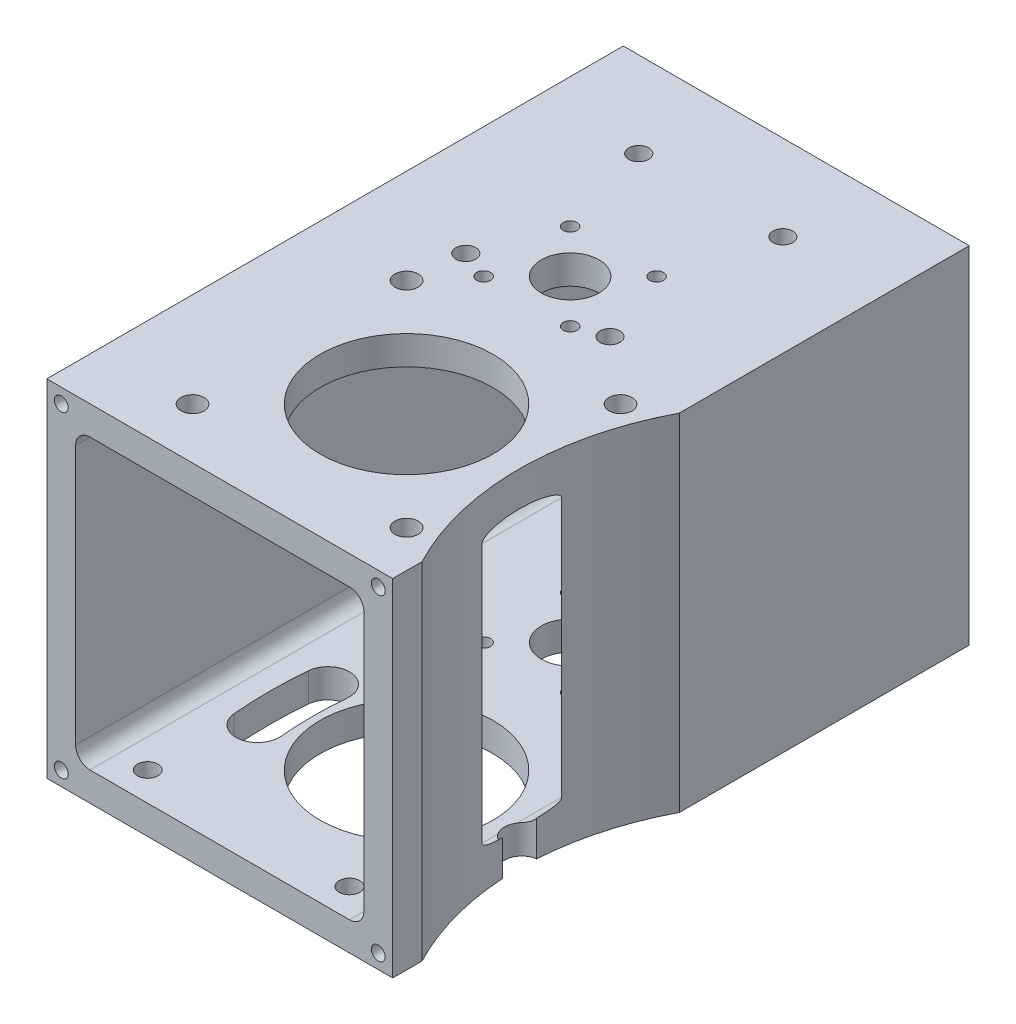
ISO-10303-21;
HEADER;
FILE_DESCRIPTION(('STEP AP214'),'2;1');
FILE_NAME('part.step','',(''),(''),'','','');
FILE_SCHEMA(('AUTOMOTIVE_DESIGN { 1 0 10303 214 1 1 1 1 }'));
ENDSEC;
DATA;
#1=APPLICATION_CONTEXT('core data for automotive mechanical design processes');
#2=APPLICATION_PROTOCOL_DEFINITION('international standard','automotive_design',2000,#1);
#3=PRODUCT_CONTEXT('',#1,'mechanical');
#4=PRODUCT('Part','Part','',(#3));
#5=PRODUCT_RELATED_PRODUCT_CATEGORY('part','',(#4));
#6=PRODUCT_DEFINITION_FORMATION('','',#4);
#7=PRODUCT_DEFINITION_CONTEXT('part definition',#1,'design');
#8=PRODUCT_DEFINITION('design','',#6,#7);
#9=PRODUCT_DEFINITION_SHAPE('','',#8);
#10=(LENGTH_UNIT() NAMED_UNIT(*) SI_UNIT(.MILLI.,.METRE.));
#11=(NAMED_UNIT(*) PLANE_ANGLE_UNIT() SI_UNIT($,.RADIAN.));
#12=(NAMED_UNIT(*) SI_UNIT($,.STERADIAN.) SOLID_ANGLE_UNIT());
#13=UNCERTAINTY_MEASURE_WITH_UNIT(LENGTH_MEASURE(1.E-05),#10,'distance_accuracy_value','');
#14=(GEOMETRIC_REPRESENTATION_CONTEXT(3) GLOBAL_UNCERTAINTY_ASSIGNED_CONTEXT((#13)) GLOBAL_UNIT_ASSIGNED_CONTEXT((#10,
#11,#12)) REPRESENTATION_CONTEXT('',''));
#15=CARTESIAN_POINT('',(0.,0.,0.));
#16=DIRECTION('',(0.,0.,1.));
#17=DIRECTION('',(1.,0.,0.));
#18=AXIS2_PLACEMENT_3D('',#15,#16,#17);
#19=CARTESIAN_POINT('',(0.,0.,-127.));
#20=DIRECTION('',(0.,-1.,0.));
#21=DIRECTION('',(0.,0.,-1.));
#22=AXIS2_PLACEMENT_3D('',#19,#20,#21);
#23=PLANE('',#22);
#24=CARTESIAN_POINT('',(28.5749999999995,0.,-67.6625200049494));
#25=DIRECTION('',(0.,-1.,0.));
#26=DIRECTION('',(0.,0.,-1.));
#27=AXIS2_PLACEMENT_3D('',#24,#25,#26);
#28=CIRCLE('',#27,1.524);
#29=CARTESIAN_POINT('',(28.5749999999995,0.,-69.1865200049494));
#30=VERTEX_POINT('',#29);
#31=EDGE_CURVE('E1000',#30,#30,#28,.T.);
#32=ORIENTED_EDGE('',*,*,#31,.F.);
#33=EDGE_LOOP('',(#32));
#34=FACE_BOUND('',#33,.T.);
#35=CARTESIAN_POINT('',(47.6249999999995,0.,-67.6625200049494));
#36=DIRECTION('',(0.,-1.,0.));
#37=DIRECTION('',(0.,0.,-1.));
#38=AXIS2_PLACEMENT_3D('',#35,#36,#37);
#39=CIRCLE('',#38,1.524);
#40=CARTESIAN_POINT('',(47.6249999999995,0.,-69.1865200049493));
#41=VERTEX_POINT('',#40);
#42=EDGE_CURVE('E1006',#41,#41,#39,.T.);
#43=ORIENTED_EDGE('',*,*,#42,.F.);
#44=EDGE_LOOP('',(#43));
#45=FACE_BOUND('',#44,.T.);
#46=CARTESIAN_POINT('',(28.5749999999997,0.,-86.7125200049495));
#47=DIRECTION('',(0.,-1.,0.));
#48=DIRECTION('',(0.,0.,-1.));
#49=AXIS2_PLACEMENT_3D('',#46,#47,#48);
#50=CIRCLE('',#49,1.524);
#51=CARTESIAN_POINT('',(28.5749999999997,0.,-88.2365200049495));
#52=VERTEX_POINT('',#51);
#53=EDGE_CURVE('E1012',#52,#52,#50,.T.);
#54=ORIENTED_EDGE('',*,*,#53,.F.);
#55=EDGE_LOOP('',(#54));
#56=FACE_BOUND('',#55,.T.);
#57=CARTESIAN_POINT('',(47.6249999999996,0.,-86.7125200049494));
#58=DIRECTION('',(0.,-1.,0.));
#59=DIRECTION('',(0.,0.,-1.));
#60=AXIS2_PLACEMENT_3D('',#57,#58,#59);
#61=CIRCLE('',#60,1.524);
#62=CARTESIAN_POINT('',(47.6249999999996,0.,-88.2365200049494));
#63=VERTEX_POINT('',#62);
#64=EDGE_CURVE('E1018',#63,#63,#61,.T.);
#65=ORIENTED_EDGE('',*,*,#64,.F.);
#66=EDGE_LOOP('',(#65));
#67=FACE_BOUND('',#66,.T.);
#68=CARTESIAN_POINT('',(70.3792365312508,0.,-115.368762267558));
#69=DIRECTION('',(0.,-1.,0.));
#70=DIRECTION('',(0.,0.,-1.));
#71=AXIS2_PLACEMENT_3D('',#68,#69,#70);
#72=CIRCLE('',#71,4.76250000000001);
#73=CARTESIAN_POINT('',(68.3665170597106,0.,-119.68505310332));
#74=VERTEX_POINT('',#73);
#75=CARTESIAN_POINT('',(72.3919560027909,0.,-111.052471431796));
#76=VERTEX_POINT('',#75);
#77=EDGE_CURVE('E329',#74,#76,#72,.T.);
#78=ORIENTED_EDGE('',*,*,#77,.F.);
#79=CARTESIAN_POINT('',(107.95,0.,-34.798));
#80=DIRECTION('',(0.,-1.,0.));
#81=DIRECTION('',(0.,0.,-1.));
#82=AXIS2_PLACEMENT_3D('',#79,#80,#81);
#83=CIRCLE('',#82,93.6625);
#84=CARTESIAN_POINT('',(54.2273970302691,0.,-111.521828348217));
#85=VERTEX_POINT('',#84);
#86=EDGE_CURVE('E317',#74,#85,#83,.F.);
#87=ORIENTED_EDGE('',*,*,#86,.T.);
#88=CARTESIAN_POINT('',(56.959054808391,0.,-107.620616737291));
#89=DIRECTION('',(0.,-1.,0.));
#90=DIRECTION('',(0.,0.,-1.));
#91=AXIS2_PLACEMENT_3D('',#88,#89,#90);
#92=CIRCLE('',#91,4.76250000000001);
#93=CARTESIAN_POINT('',(59.6907125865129,0.,-103.719405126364));
#94=VERTEX_POINT('',#93);
#95=EDGE_CURVE('E323',#94,#85,#92,.T.);
#96=ORIENTED_EDGE('',*,*,#95,.F.);
#97=CARTESIAN_POINT('',(107.95,0.,-34.798));
#98=DIRECTION('',(0.,-1.,0.));
#99=DIRECTION('',(0.,0.,-1.));
#100=AXIS2_PLACEMENT_3D('',#97,#98,#99);
#101=CIRCLE('',#100,84.1375);
#102=EDGE_CURVE('E332',#76,#94,#101,.F.);
#103=ORIENTED_EDGE('',*,*,#102,.F.);
#104=EDGE_LOOP('',(#78,#87,#96,#103));
#105=FACE_BOUND('',#104,.T.);
#106=CARTESIAN_POINT('',(15.875,0.,-120.65));
#107=DIRECTION('',(0.,-1.,0.));
#108=DIRECTION('',(0.,0.,-1.));
#109=AXIS2_PLACEMENT_3D('',#106,#107,#108);
#110=CIRCLE('',#109,2.2479);
#111=CARTESIAN_POINT('',(15.875,0.,-122.8979));
#112=VERTEX_POINT('',#111);
#113=EDGE_CURVE('E596',#112,#112,#110,.T.);
#114=ORIENTED_EDGE('',*,*,#113,.F.);
#115=EDGE_LOOP('',(#114));
#116=FACE_BOUND('',#115,.T.);
#117=CARTESIAN_POINT('',(15.875,0.,-6.35));
#118=DIRECTION('',(0.,-1.,0.));
#119=DIRECTION('',(0.,0.,-1.));
#120=AXIS2_PLACEMENT_3D('',#117,#118,#119);
#121=CIRCLE('',#120,2.2479);
#122=CARTESIAN_POINT('',(15.875,0.,-8.5979));
#123=VERTEX_POINT('',#122);
#124=EDGE_CURVE('E600',#123,#123,#121,.T.);
#125=ORIENTED_EDGE('',*,*,#124,.F.);
#126=EDGE_LOOP('',(#125));
#127=FACE_BOUND('',#126,.T.);
#128=CARTESIAN_POINT('',(60.325,0.,-6.34999999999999));
#129=DIRECTION('',(0.,-1.,0.));
#130=DIRECTION('',(0.,0.,-1.));
#131=AXIS2_PLACEMENT_3D('',#128,#129,#130);
#132=CIRCLE('',#131,2.2479);
#133=CARTESIAN_POINT('',(60.325,0.,-8.59789999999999));
#134=VERTEX_POINT('',#133);
#135=EDGE_CURVE('E604',#134,#134,#132,.T.);
#136=ORIENTED_EDGE('',*,*,#135,.F.);
#137=EDGE_LOOP('',(#136));
#138=FACE_BOUND('',#137,.T.);
#139=CARTESIAN_POINT('',(47.625,0.,-120.65));
#140=DIRECTION('',(0.,-1.,0.));
#141=DIRECTION('',(0.,0.,-1.));
#142=AXIS2_PLACEMENT_3D('',#139,#140,#141);
#143=CIRCLE('',#142,2.2479);
#144=CARTESIAN_POINT('',(47.625,0.,-122.8979));
#145=VERTEX_POINT('',#144);
#146=EDGE_CURVE('E608',#145,#145,#143,.T.);
#147=ORIENTED_EDGE('',*,*,#146,.F.);
#148=EDGE_LOOP('',(#147));
#149=FACE_BOUND('',#148,.T.);
#150=CARTESIAN_POINT('',(69.8499999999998,0.,-34.798));
#151=DIRECTION('',(0.,-1.,0.));
#152=DIRECTION('',(0.,0.,-1.));
#153=AXIS2_PLACEMENT_3D('',#150,#151,#152);
#154=CIRCLE('',#153,3.81);
#155=CARTESIAN_POINT('',(69.3319736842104,0.,-31.0233809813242));
#156=VERTEX_POINT('',#155);
#157=CARTESIAN_POINT('',(69.3319736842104,0.,-38.5726190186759));
#158=VERTEX_POINT('',#157);
#159=EDGE_CURVE('E712',#156,#158,#154,.T.);
#160=ORIENTED_EDGE('',*,*,#159,.F.);
#161=CARTESIAN_POINT('',(130.175,0.,-34.798));
#162=DIRECTION('',(0.,-1.,0.));
#163=DIRECTION('',(0.,0.,-1.));
#164=AXIS2_PLACEMENT_3D('',#161,#162,#163);
#165=CIRCLE('',#164,60.96);
#166=CARTESIAN_POINT('',(76.2,0.,-6.46390437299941));
#167=VERTEX_POINT('',#166);
#168=EDGE_CURVE('E914',#156,#167,#165,.F.);
#169=ORIENTED_EDGE('',*,*,#168,.T.);
#170=DIRECTION('',(0.,0.,1.));
#171=VECTOR('',#170,1.);
#172=CARTESIAN_POINT('',(76.2,0.,-127.));
#173=LINE('',#172,#171);
#174=CARTESIAN_POINT('',(76.2,0.,0.));
#175=VERTEX_POINT('',#174);
#176=EDGE_CURVE('E878',#167,#175,#173,.T.);
#177=ORIENTED_EDGE('',*,*,#176,.T.);
#178=DIRECTION('',(1.,0.,0.));
#179=VECTOR('',#178,1.);
#180=CARTESIAN_POINT('',(0.,0.,0.));
#181=LINE('',#180,#179);
#182=CARTESIAN_POINT('',(0.,0.,0.));
#183=VERTEX_POINT('',#182);
#184=EDGE_CURVE('E861',#183,#175,#181,.T.);
#185=ORIENTED_EDGE('',*,*,#184,.F.);
#186=DIRECTION('',(0.,0.,1.));
#187=VECTOR('',#186,1.);
#188=CARTESIAN_POINT('',(0.,0.,-127.));
#189=LINE('',#188,#187);
#190=CARTESIAN_POINT('',(0.,0.,-127.));
#191=VERTEX_POINT('',#190);
#192=EDGE_CURVE('E858',#191,#183,#189,.T.);
#193=ORIENTED_EDGE('',*,*,#192,.F.);
#194=DIRECTION('',(1.,0.,0.));
#195=VECTOR('',#194,1.);
#196=CARTESIAN_POINT('',(0.,0.,-127.));
#197=LINE('',#196,#195);
#198=CARTESIAN_POINT('',(76.2,0.,-127.));
#199=VERTEX_POINT('',#198);
#200=EDGE_CURVE('E848',#191,#199,#197,.T.);
#201=ORIENTED_EDGE('',*,*,#200,.T.);
#202=CARTESIAN_POINT('',(76.2,0.,-63.1320956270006));
#203=VERTEX_POINT('',#202);
#204=EDGE_CURVE('E875',#199,#203,#173,.T.);
#205=ORIENTED_EDGE('',*,*,#204,.T.);
#206=EDGE_CURVE('E910',#203,#158,#165,.F.);
#207=ORIENTED_EDGE('',*,*,#206,.T.);
#208=EDGE_LOOP('',(#160,#169,#177,#185,#193,#201,#205,#207));
#209=FACE_BOUND('',#208,.T.);
#210=CARTESIAN_POINT('',(38.0999999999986,0.,-77.1875200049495));
#211=DIRECTION('',(0.,-1.,0.));
#212=DIRECTION('',(0.,0.,-1.));
#213=AXIS2_PLACEMENT_3D('',#210,#211,#212);
#214=CIRCLE('',#213,6.35);
#215=CARTESIAN_POINT('',(38.0999999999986,0.,-83.5375200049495));
#216=VERTEX_POINT('',#215);
#217=EDGE_CURVE('E881',#216,#216,#214,.F.);
#218=ORIENTED_EDGE('',*,*,#217,.T.);
#219=EDGE_LOOP('',(#218));
#220=FACE_BOUND('',#219,.T.);
#221=CARTESIAN_POINT('',(44.4499999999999,0.,-34.798));
#222=DIRECTION('',(0.,-1.,0.));
#223=DIRECTION('',(0.,0.,-1.));
#224=AXIS2_PLACEMENT_3D('',#221,#222,#223);
#225=CIRCLE('',#224,19.05);
#226=CARTESIAN_POINT('',(44.4499999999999,0.,-53.848));
#227=VERTEX_POINT('',#226);
#228=EDGE_CURVE('E755',#227,#227,#225,.T.);
#229=ORIENTED_EDGE('',*,*,#228,.F.);
#230=EDGE_LOOP('',(#229));
#231=FACE_BOUND('',#230,.T.);
#232=CARTESIAN_POINT('',(19.3882913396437,0.,-42.5461455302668));
#233=DIRECTION('',(0.,-1.,0.));
#234=DIRECTION('',(0.,0.,-1.));
#235=AXIS2_PLACEMENT_3D('',#232,#233,#234);
#236=CIRCLE('',#235,4.7625);
#237=CARTESIAN_POINT('',(14.6439140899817,0.,-42.9612247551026));
#238=VERTEX_POINT('',#237);
#239=CARTESIAN_POINT('',(24.1326685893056,0.,-42.1310663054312));
#240=VERTEX_POINT('',#239);
#241=EDGE_CURVE('E305',#238,#240,#236,.T.);
#242=ORIENTED_EDGE('',*,*,#241,.F.);
#243=CARTESIAN_POINT('',(107.95,0.,-34.798));
#244=DIRECTION('',(0.,-1.,0.));
#245=DIRECTION('',(0.,0.,-1.));
#246=AXIS2_PLACEMENT_3D('',#243,#244,#245);
#247=CIRCLE('',#246,93.6625);
#248=CARTESIAN_POINT('',(14.6439140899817,0.,-26.6347752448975));
#249=VERTEX_POINT('',#248);
#250=EDGE_CURVE('E49',#238,#249,#247,.F.);
#251=ORIENTED_EDGE('',*,*,#250,.T.);
#252=CARTESIAN_POINT('',(19.3882913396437,0.,-27.0498544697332));
#253=DIRECTION('',(0.,-1.,0.));
#254=DIRECTION('',(0.,0.,-1.));
#255=AXIS2_PLACEMENT_3D('',#252,#253,#254);
#256=CIRCLE('',#255,4.76249999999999);
#257=CARTESIAN_POINT('',(24.1326685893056,0.,-27.4649336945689));
#258=VERTEX_POINT('',#257);
#259=EDGE_CURVE('E310',#258,#249,#256,.T.);
#260=ORIENTED_EDGE('',*,*,#259,.F.);
#261=CARTESIAN_POINT('',(107.95,0.,-34.798));
#262=DIRECTION('',(0.,-1.,0.));
#263=DIRECTION('',(0.,0.,-1.));
#264=AXIS2_PLACEMENT_3D('',#261,#262,#263);
#265=CIRCLE('',#264,84.1375);
#266=EDGE_CURVE('E296',#240,#258,#265,.F.);
#267=ORIENTED_EDGE('',*,*,#266,.F.);
#268=EDGE_LOOP('',(#242,#251,#260,#267));
#269=FACE_BOUND('',#268,.T.);
#270=ADVANCED_FACE('F34',(#34,#45,#56,#67,#105,#116,#127,#138,#149,#209,#220,#231,#269),#23,.T.);
#271=CARTESIAN_POINT('',(9.52500000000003,6.35,-127.));
#272=DIRECTION('',(0.,-1.,0.));
#273=DIRECTION('',(0.,0.,-1.));
#274=AXIS2_PLACEMENT_3D('',#271,#272,#273);
#275=PLANE('',#274);
#276=CARTESIAN_POINT('',(28.5749999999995,6.35,-67.6625200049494));
#277=DIRECTION('',(0.,1.,0.));
#278=DIRECTION('',(0.,0.,1.));
#279=AXIS2_PLACEMENT_3D('',#276,#277,#278);
#280=CIRCLE('',#279,1.524);
#281=CARTESIAN_POINT('',(28.5749999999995,6.35,-66.1385200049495));
#282=VERTEX_POINT('',#281);
#283=EDGE_CURVE('E992',#282,#282,#280,.T.);
#284=ORIENTED_EDGE('',*,*,#283,.F.);
#285=EDGE_LOOP('',(#284));
#286=FACE_BOUND('',#285,.T.);
#287=CARTESIAN_POINT('',(47.6249999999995,6.35,-67.6625200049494));
#288=DIRECTION('',(0.,1.,0.));
#289=DIRECTION('',(0.,0.,1.));
#290=AXIS2_PLACEMENT_3D('',#287,#288,#289);
#291=CIRCLE('',#290,1.524);
#292=CARTESIAN_POINT('',(47.6249999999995,6.35,-66.1385200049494));
#293=VERTEX_POINT('',#292);
#294=EDGE_CURVE('E1003',#293,#293,#291,.T.);
#295=ORIENTED_EDGE('',*,*,#294,.F.);
#296=EDGE_LOOP('',(#295));
#297=FACE_BOUND('',#296,.T.);
#298=CARTESIAN_POINT('',(28.5749999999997,6.35,-86.7125200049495));
#299=DIRECTION('',(0.,1.,0.));
#300=DIRECTION('',(0.,0.,1.));
#301=AXIS2_PLACEMENT_3D('',#298,#299,#300);
#302=CIRCLE('',#301,1.524);
#303=CARTESIAN_POINT('',(28.5749999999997,6.35,-85.1885200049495));
#304=VERTEX_POINT('',#303);
#305=EDGE_CURVE('E1009',#304,#304,#302,.T.);
#306=ORIENTED_EDGE('',*,*,#305,.F.);
#307=EDGE_LOOP('',(#306));
#308=FACE_BOUND('',#307,.T.);
#309=CARTESIAN_POINT('',(47.6249999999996,6.35,-86.7125200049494));
#310=DIRECTION('',(0.,1.,0.));
#311=DIRECTION('',(0.,0.,1.));
#312=AXIS2_PLACEMENT_3D('',#309,#310,#311);
#313=CIRCLE('',#312,1.524);
#314=CARTESIAN_POINT('',(47.6249999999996,6.35,-85.1885200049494));
#315=VERTEX_POINT('',#314);
#316=EDGE_CURVE('E1015',#315,#315,#313,.T.);
#317=ORIENTED_EDGE('',*,*,#316,.F.);
#318=EDGE_LOOP('',(#317));
#319=FACE_BOUND('',#318,.T.);
#320=CARTESIAN_POINT('',(107.95,6.35,-34.798));
#321=DIRECTION('',(0.,-1.,0.));
#322=DIRECTION('',(0.,0.,-1.));
#323=AXIS2_PLACEMENT_3D('',#320,#321,#322);
#324=CIRCLE('',#323,93.6625);
#325=CARTESIAN_POINT('',(66.675,6.35,-118.875572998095));
#326=VERTEX_POINT('',#325);
#327=CARTESIAN_POINT('',(54.2273970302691,6.35,-111.521828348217));
#328=VERTEX_POINT('',#327);
#329=EDGE_CURVE('E1057',#326,#328,#324,.F.);
#330=ORIENTED_EDGE('',*,*,#329,.F.);
#331=DIRECTION('',(0.,0.,1.));
#332=VECTOR('',#331,1.);
#333=CARTESIAN_POINT('',(66.675,6.35,-127.));
#334=LINE('',#333,#332);
#335=CARTESIAN_POINT('',(66.675,6.35,-127.));
#336=VERTEX_POINT('',#335);
#337=EDGE_CURVE('E834',#336,#326,#334,.T.);
#338=ORIENTED_EDGE('',*,*,#337,.F.);
#339=DIRECTION('',(1.,0.,0.));
#340=VECTOR('',#339,1.);
#341=CARTESIAN_POINT('',(9.52500000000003,6.35,-127.));
#342=LINE('',#341,#340);
#343=CARTESIAN_POINT('',(9.52500000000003,6.35,-127.));
#344=VERTEX_POINT('',#343);
#345=EDGE_CURVE('E778',#344,#336,#342,.T.);
#346=ORIENTED_EDGE('',*,*,#345,.F.);
#347=DIRECTION('',(0.,0.,1.));
#348=VECTOR('',#347,1.);
#349=CARTESIAN_POINT('',(9.52500000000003,6.35,-127.));
#350=LINE('',#349,#348);
#351=CARTESIAN_POINT('',(9.52500000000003,6.35,0.));
#352=VERTEX_POINT('',#351);
#353=EDGE_CURVE('E839',#344,#352,#350,.T.);
#354=ORIENTED_EDGE('',*,*,#353,.T.);
#355=DIRECTION('',(1.,0.,0.));
#356=VECTOR('',#355,1.);
#357=CARTESIAN_POINT('',(9.52500000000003,6.35,0.));
#358=LINE('',#357,#356);
#359=CARTESIAN_POINT('',(66.675,6.35,0.));
#360=VERTEX_POINT('',#359);
#361=EDGE_CURVE('E801',#352,#360,#358,.T.);
#362=ORIENTED_EDGE('',*,*,#361,.T.);
#363=CARTESIAN_POINT('',(66.675,6.35,-32.6919432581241));
#364=VERTEX_POINT('',#363);
#365=EDGE_CURVE('E838',#364,#360,#334,.T.);
#366=ORIENTED_EDGE('',*,*,#365,.F.);
#367=CARTESIAN_POINT('',(69.8499999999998,6.35,-34.798));
#368=DIRECTION('',(0.,-1.,0.));
#369=DIRECTION('',(0.,0.,-1.));
#370=AXIS2_PLACEMENT_3D('',#367,#368,#369);
#371=CIRCLE('',#370,3.81);
#372=CARTESIAN_POINT('',(66.675,6.35,-36.9040567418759));
#373=VERTEX_POINT('',#372);
#374=EDGE_CURVE('E717',#364,#373,#371,.T.);
#375=ORIENTED_EDGE('',*,*,#374,.T.);
#376=CARTESIAN_POINT('',(66.675,6.35,-108.115755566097));
#377=VERTEX_POINT('',#376);
#378=EDGE_CURVE('E837',#377,#373,#334,.T.);
#379=ORIENTED_EDGE('',*,*,#378,.F.);
#380=CARTESIAN_POINT('',(107.95,6.35,-34.798));
#381=DIRECTION('',(0.,-1.,0.));
#382=DIRECTION('',(0.,0.,-1.));
#383=AXIS2_PLACEMENT_3D('',#380,#381,#382);
#384=CIRCLE('',#383,84.1375);
#385=CARTESIAN_POINT('',(59.6907125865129,6.35,-103.719405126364));
#386=VERTEX_POINT('',#385);
#387=EDGE_CURVE('E385',#377,#386,#384,.F.);
#388=ORIENTED_EDGE('',*,*,#387,.T.);
#389=CARTESIAN_POINT('',(56.959054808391,6.35,-107.620616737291));
#390=DIRECTION('',(0.,-1.,0.));
#391=DIRECTION('',(0.,0.,-1.));
#392=AXIS2_PLACEMENT_3D('',#389,#390,#391);
#393=CIRCLE('',#392,4.76250000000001);
#394=EDGE_CURVE('E1058',#386,#328,#393,.T.);
#395=ORIENTED_EDGE('',*,*,#394,.T.);
#396=EDGE_LOOP('',(#330,#338,#346,#354,#362,#366,#375,#379,#388,#395));
#397=FACE_BOUND('',#396,.T.);
#398=CARTESIAN_POINT('',(15.875,6.35,-120.65));
#399=DIRECTION('',(0.,-1.,0.));
#400=DIRECTION('',(0.,0.,-1.));
#401=AXIS2_PLACEMENT_3D('',#398,#399,#400);
#402=CIRCLE('',#401,2.2479);
#403=CARTESIAN_POINT('',(15.875,6.35,-122.8979));
#404=VERTEX_POINT('',#403);
#405=EDGE_CURVE('E599',#404,#404,#402,.T.);
#406=ORIENTED_EDGE('',*,*,#405,.T.);
#407=EDGE_LOOP('',(#406));
#408=FACE_BOUND('',#407,.T.);
#409=CARTESIAN_POINT('',(15.875,6.35,-6.35));
#410=DIRECTION('',(0.,-1.,0.));
#411=DIRECTION('',(0.,0.,-1.));
#412=AXIS2_PLACEMENT_3D('',#409,#410,#411);
#413=CIRCLE('',#412,2.2479);
#414=CARTESIAN_POINT('',(15.875,6.35,-8.5979));
#415=VERTEX_POINT('',#414);
#416=EDGE_CURVE('E603',#415,#415,#413,.T.);
#417=ORIENTED_EDGE('',*,*,#416,.T.);
#418=EDGE_LOOP('',(#417));
#419=FACE_BOUND('',#418,.T.);
#420=CARTESIAN_POINT('',(60.325,6.35,-6.34999999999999));
#421=DIRECTION('',(0.,-1.,0.));
#422=DIRECTION('',(0.,0.,-1.));
#423=AXIS2_PLACEMENT_3D('',#420,#421,#422);
#424=CIRCLE('',#423,2.2479);
#425=CARTESIAN_POINT('',(60.325,6.35,-8.59789999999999));
#426=VERTEX_POINT('',#425);
#427=EDGE_CURVE('E607',#426,#426,#424,.T.);
#428=ORIENTED_EDGE('',*,*,#427,.T.);
#429=EDGE_LOOP('',(#428));
#430=FACE_BOUND('',#429,.T.);
#431=CARTESIAN_POINT('',(47.625,6.35,-120.65));
#432=DIRECTION('',(0.,-1.,0.));
#433=DIRECTION('',(0.,0.,-1.));
#434=AXIS2_PLACEMENT_3D('',#431,#432,#433);
#435=CIRCLE('',#434,2.2479);
#436=CARTESIAN_POINT('',(47.625,6.35,-122.8979));
#437=VERTEX_POINT('',#436);
#438=EDGE_CURVE('E611',#437,#437,#435,.T.);
#439=ORIENTED_EDGE('',*,*,#438,.T.);
#440=EDGE_LOOP('',(#439));
#441=FACE_BOUND('',#440,.T.);
#442=CARTESIAN_POINT('',(38.0999999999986,6.35,-77.1875200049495));
#443=DIRECTION('',(0.,-1.,0.));
#444=DIRECTION('',(0.,0.,-1.));
#445=AXIS2_PLACEMENT_3D('',#442,#443,#444);
#446=CIRCLE('',#445,6.35);
#447=CARTESIAN_POINT('',(38.0999999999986,6.35,-83.5375200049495));
#448=VERTEX_POINT('',#447);
#449=EDGE_CURVE('E879',#448,#448,#446,.T.);
#450=ORIENTED_EDGE('',*,*,#449,.T.);
#451=EDGE_LOOP('',(#450));
#452=FACE_BOUND('',#451,.T.);
#453=CARTESIAN_POINT('',(44.4499999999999,6.35,-34.798));
#454=DIRECTION('',(0.,-1.,0.));
#455=DIRECTION('',(0.,0.,-1.));
#456=AXIS2_PLACEMENT_3D('',#453,#454,#455);
#457=CIRCLE('',#456,19.05);
#458=CARTESIAN_POINT('',(44.4499999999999,6.35,-53.848));
#459=VERTEX_POINT('',#458);
#460=EDGE_CURVE('E754',#459,#459,#457,.T.);
#461=ORIENTED_EDGE('',*,*,#460,.T.);
#462=EDGE_LOOP('',(#461));
#463=FACE_BOUND('',#462,.T.);
#464=CARTESIAN_POINT('',(107.95,6.35,-34.798));
#465=DIRECTION('',(0.,-1.,0.));
#466=DIRECTION('',(0.,0.,-1.));
#467=AXIS2_PLACEMENT_3D('',#464,#465,#466);
#468=CIRCLE('',#467,93.6625);
#469=CARTESIAN_POINT('',(14.6439140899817,6.35,-42.9612247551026));
#470=VERTEX_POINT('',#469);
#471=CARTESIAN_POINT('',(14.6439140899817,6.35,-26.6347752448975));
#472=VERTEX_POINT('',#471);
#473=EDGE_CURVE('E11',#470,#472,#468,.F.);
#474=ORIENTED_EDGE('',*,*,#473,.F.);
#475=CARTESIAN_POINT('',(19.3882913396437,6.35,-42.5461455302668));
#476=DIRECTION('',(0.,-1.,0.));
#477=DIRECTION('',(0.,0.,-1.));
#478=AXIS2_PLACEMENT_3D('',#475,#476,#477);
#479=CIRCLE('',#478,4.7625);
#480=CARTESIAN_POINT('',(24.1326685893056,6.35,-42.1310663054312));
#481=VERTEX_POINT('',#480);
#482=EDGE_CURVE('E1048',#470,#481,#479,.T.);
#483=ORIENTED_EDGE('',*,*,#482,.T.);
#484=CARTESIAN_POINT('',(107.95,6.35,-34.798));
#485=DIRECTION('',(0.,-1.,0.));
#486=DIRECTION('',(0.,0.,-1.));
#487=AXIS2_PLACEMENT_3D('',#484,#485,#486);
#488=CIRCLE('',#487,84.1375);
#489=CARTESIAN_POINT('',(24.1326685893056,6.35,-27.4649336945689));
#490=VERTEX_POINT('',#489);
#491=EDGE_CURVE('E299',#481,#490,#488,.F.);
#492=ORIENTED_EDGE('',*,*,#491,.T.);
#493=CARTESIAN_POINT('',(19.3882913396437,6.35,-27.0498544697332));
#494=DIRECTION('',(0.,-1.,0.));
#495=DIRECTION('',(0.,0.,-1.));
#496=AXIS2_PLACEMENT_3D('',#493,#494,#495);
#497=CIRCLE('',#496,4.76249999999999);
#498=EDGE_CURVE('E42',#490,#472,#497,.T.);
#499=ORIENTED_EDGE('',*,*,#498,.T.);
#500=EDGE_LOOP('',(#474,#483,#492,#499));
#501=FACE_BOUND('',#500,.T.);
#502=ADVANCED_FACE('F442',(#286,#297,#308,#319,#397,#408,#419,#430,#441,#452,#463,#501),#275,.F.);
#503=CARTESIAN_POINT('',(66.675,9.525,-127.));
#504=DIRECTION('',(0.,0.,1.));
#505=DIRECTION('',(1.,0.,0.));
#506=AXIS2_PLACEMENT_3D('',#503,#504,#505);
#507=CYLINDRICAL_SURFACE('',#506,3.175);
#508=CARTESIAN_POINT('',(68.3665170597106,6.83810680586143,-119.68505310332));
#509=CARTESIAN_POINT('',(68.2833777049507,6.78577064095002,-119.64628543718));
#510=CARTESIAN_POINT('',(68.1982358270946,6.73755604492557,-119.606433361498));
#511=CARTESIAN_POINT('',(68.0246456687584,6.64948961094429,-119.524850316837));
#512=CARTESIAN_POINT('',(67.9361988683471,6.60963408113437,-119.48312018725));
#513=CARTESIAN_POINT('',(67.6674070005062,6.50294846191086,-119.355765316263));
#514=CARTESIAN_POINT('',(67.4830722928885,6.44866481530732,-119.267725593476));
#515=CARTESIAN_POINT('',(67.1099061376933,6.37417656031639,-119.087937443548));
#516=CARTESIAN_POINT('',(66.9210813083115,6.35392460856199,-118.996194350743));
#517=CARTESIAN_POINT('',(66.5434438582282,6.3471082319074,-118.81112546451));
#518=CARTESIAN_POINT('',(66.3546313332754,6.36056674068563,-118.717798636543));
#519=CARTESIAN_POINT('',(65.9729751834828,6.42227341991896,-118.527569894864));
#520=CARTESIAN_POINT('',(65.7803717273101,6.47215724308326,-118.430710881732));
#521=CARTESIAN_POINT('',(65.40610483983,6.6077785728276,-118.240944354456));
#522=CARTESIAN_POINT('',(65.224442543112,6.69351979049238,-118.148037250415));
#523=CARTESIAN_POINT('',(64.8800985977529,6.89850382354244,-117.970618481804));
#524=CARTESIAN_POINT('',(64.7171983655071,7.01729025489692,-117.886012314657));
#525=CARTESIAN_POINT('',(64.4899922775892,7.21920755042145,-117.767265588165));
#526=CARTESIAN_POINT('',(64.4170849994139,7.29050747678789,-117.72902821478));
#527=CARTESIAN_POINT('',(64.2777769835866,7.44067439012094,-117.655751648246));
#528=CARTESIAN_POINT('',(64.2113722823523,7.51953670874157,-117.620710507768));
#529=CARTESIAN_POINT('',(64.0915391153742,7.67696075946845,-117.557310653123));
#530=CARTESIAN_POINT('',(64.0374811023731,7.75491650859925,-117.528634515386));
#531=CARTESIAN_POINT('',(63.9361306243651,7.91618586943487,-117.47475912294));
#532=CARTESIAN_POINT('',(63.8888342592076,7.99949635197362,-117.449557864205));
#533=CARTESIAN_POINT('',(63.8016373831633,8.17087888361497,-117.403014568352));
#534=CARTESIAN_POINT('',(63.7617324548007,8.25894804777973,-117.381670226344));
#535=CARTESIAN_POINT('',(63.6898850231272,8.43912006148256,-117.343186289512));
#536=CARTESIAN_POINT('',(63.6579413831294,8.53122233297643,-117.326046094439));
#537=CARTESIAN_POINT('',(63.5817508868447,8.7890564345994,-117.285123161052));
#538=CARTESIAN_POINT('',(63.5462233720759,8.95824192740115,-117.265988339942));
#539=CARTESIAN_POINT('',(63.5032024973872,9.30102068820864,-117.242810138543));
#540=CARTESIAN_POINT('',(63.4956927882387,9.474611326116,-117.238757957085));
#541=CARTESIAN_POINT('',(63.5084892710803,9.80623687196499,-117.245656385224));
#542=CARTESIAN_POINT('',(63.5265787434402,9.96438672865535,-117.255411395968));
#543=CARTESIAN_POINT('',(63.5858020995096,10.2749859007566,-117.287290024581));
#544=CARTESIAN_POINT('',(63.6269350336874,10.4274354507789,-117.309413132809));
#545=CARTESIAN_POINT('',(63.7306951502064,10.723517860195,-117.365066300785));
#546=CARTESIAN_POINT('',(63.7934367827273,10.8670988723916,-117.39865709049));
#547=CARTESIAN_POINT('',(63.9378935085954,11.1414566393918,-117.475718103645));
#548=CARTESIAN_POINT('',(64.0196137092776,11.2722299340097,-117.519190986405));
#549=CARTESIAN_POINT('',(64.2064335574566,11.5284705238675,-117.618144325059));
#550=CARTESIAN_POINT('',(64.3128725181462,11.6526966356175,-117.674303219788));
#551=CARTESIAN_POINT('',(64.5412664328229,11.8816911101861,-117.794158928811));
#552=CARTESIAN_POINT('',(64.6632281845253,11.9864508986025,-117.857859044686));
#553=CARTESIAN_POINT('',(64.9340008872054,12.1860029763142,-117.99844172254));
#554=CARTESIAN_POINT('',(65.084288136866,12.278316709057,-118.075999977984));
#555=CARTESIAN_POINT('',(65.3960078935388,12.4362485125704,-118.235715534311));
#556=CARTESIAN_POINT('',(65.5574447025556,12.5018562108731,-118.317874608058));
#557=CARTESIAN_POINT('',(65.90430100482,12.6109233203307,-118.49306841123));
#558=CARTESIAN_POINT('',(66.0905001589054,12.6514939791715,-118.586366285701));
#559=CARTESIAN_POINT('',(66.4670662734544,12.6988670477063,-118.773439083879));
#560=CARTESIAN_POINT('',(66.6574364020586,12.7056428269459,-118.867214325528));
#561=CARTESIAN_POINT('',(67.0462204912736,12.6845075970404,-119.057086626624));
#562=CARTESIAN_POINT('',(67.2445942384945,12.654959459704,-119.153087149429));
#563=CARTESIAN_POINT('',(67.6342050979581,12.5582599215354,-119.339984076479));
#564=CARTESIAN_POINT('',(67.8254564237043,12.4911882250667,-119.430890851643));
#565=CARTESIAN_POINT('',(68.0709204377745,12.3774716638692,-119.54661392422));
#566=CARTESIAN_POINT('',(68.131309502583,12.3471249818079,-119.575002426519));
#567=CARTESIAN_POINT('',(68.2502889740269,12.2824727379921,-119.630783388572));
#568=CARTESIAN_POINT('',(68.3088815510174,12.2481722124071,-119.658177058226));
#569=CARTESIAN_POINT('',(68.3665170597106,12.2118931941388,-119.68505310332));
#570=B_SPLINE_CURVE_WITH_KNOTS('',3,(#508,#509,#510,#511,#512,#513,#514,#515,#516,#517,#518,
#519,#520,#521,#522,#523,#524,#525,#526,#527,#528,#529,#530,#531,#532,#533,#534,#535,#536,#537,
#538,#539,#540,#541,#542,#543,#544,#545,#546,#547,#548,#549,#550,#551,#552,#553,#554,#555,#556,
#557,#558,#559,#560,#561,#562,#563,#564,#565,#566,#567,#568,#569),.UNSPECIFIED.,.F.,.F.,(4,2,2,
2,2,2,2,2,2,2,2,2,2,2,2,2,2,2,2,2,2,2,2,2,2,2,2,2,2,2,4),(0.,0.316610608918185,
0.633081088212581,1.26400483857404,1.89405014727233,2.52452420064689,3.18519997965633,
3.84594415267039,4.49798085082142,4.82429655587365,5.15041210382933,5.44731250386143,
5.74404095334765,6.04059148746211,6.33709965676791,6.85580948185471,7.37421657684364,
7.85038119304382,8.32652618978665,8.80523288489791,9.28406855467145,9.80084005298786,
10.3178386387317,10.8934813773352,11.4693474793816,12.1030913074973,12.7373344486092,
13.4012412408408,14.0637431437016,14.2835568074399,14.5030935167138),.UNSPECIFIED.);
#571=CARTESIAN_POINT('',(68.3665170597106,6.83810680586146,-119.68505310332));
#572=VERTEX_POINT('',#571);
#573=EDGE_CURVE('E529',#572,#326,#570,.T.);
#574=ORIENTED_EDGE('',*,*,#573,.F.);
#575=CARTESIAN_POINT('',(69.85,9.525,-120.101765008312));
#576=CARTESIAN_POINT('',(69.8499945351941,9.70040186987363,-120.101773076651));
#577=CARTESIAN_POINT('',(69.8354265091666,9.87592404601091,-120.100204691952));
#578=CARTESIAN_POINT('',(69.7774510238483,10.2223435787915,-120.093177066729));
#579=CARTESIAN_POINT('',(69.7340042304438,10.3932342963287,-120.087712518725));
#580=CARTESIAN_POINT('',(69.6482704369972,10.6421551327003,-120.074917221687));
#581=CARTESIAN_POINT('',(69.6162290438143,10.7239595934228,-120.069879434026));
#582=CARTESIAN_POINT('',(69.5455476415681,10.8845070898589,-120.057862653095));
#583=CARTESIAN_POINT('',(69.5069102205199,10.9632513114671,-120.050884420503));
#584=CARTESIAN_POINT('',(69.4233750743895,11.1170813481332,-120.034546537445));
#585=CARTESIAN_POINT('',(69.3784775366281,11.1921672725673,-120.025186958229));
#586=CARTESIAN_POINT('',(69.2828738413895,11.3380692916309,-120.003607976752));
#587=CARTESIAN_POINT('',(69.2321703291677,11.4088873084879,-119.991389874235));
#588=CARTESIAN_POINT('',(69.1267623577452,11.5440728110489,-119.963934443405));
#589=CARTESIAN_POINT('',(69.0721837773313,11.6085546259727,-119.948776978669));
#590=CARTESIAN_POINT('',(68.958617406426,11.7324359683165,-119.914832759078));
#591=CARTESIAN_POINT('',(68.8996315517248,11.7918377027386,-119.896047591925));
#592=CARTESIAN_POINT('',(68.7779551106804,11.9051498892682,-119.854454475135));
#593=CARTESIAN_POINT('',(68.715265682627,11.9590620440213,-119.831647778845));
#594=CARTESIAN_POINT('',(68.5869683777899,12.06108341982,-119.78168866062));
#595=CARTESIAN_POINT('',(68.5213606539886,12.1091929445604,-119.754536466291));
#596=CARTESIAN_POINT('',(68.392079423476,12.196700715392,-119.697422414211));
#597=CARTESIAN_POINT('',(68.3285248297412,12.2364478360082,-119.667725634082));
#598=CARTESIAN_POINT('',(68.2003476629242,12.310575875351,-119.60420597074));
#599=CARTESIAN_POINT('',(68.1357247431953,12.3449550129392,-119.570381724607));
#600=CARTESIAN_POINT('',(67.9414349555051,12.440044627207,-119.462701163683));
#601=CARTESIAN_POINT('',(67.8112180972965,12.4927925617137,-119.382581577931));
#602=CARTESIAN_POINT('',(67.5536471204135,12.5790694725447,-119.205715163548));
#603=CARTESIAN_POINT('',(67.426343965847,12.6123675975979,-119.108785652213));
#604=CARTESIAN_POINT('',(67.1803330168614,12.6620410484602,-118.900673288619));
#605=CARTESIAN_POINT('',(67.0616310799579,12.6784049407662,-118.789480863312));
#606=CARTESIAN_POINT('',(66.8669053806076,12.6952614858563,-118.587287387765));
#607=CARTESIAN_POINT('',(66.7881206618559,12.6988808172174,-118.499140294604));
#608=CARTESIAN_POINT('',(66.637273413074,12.7006715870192,-118.317165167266));
#609=CARTESIAN_POINT('',(66.5652134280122,12.6988409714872,-118.223335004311));
#610=CARTESIAN_POINT('',(66.4282511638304,12.6911418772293,-118.030553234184));
#611=CARTESIAN_POINT('',(66.3633600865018,12.6852671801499,-117.93159395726));
#612=CARTESIAN_POINT('',(66.2411937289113,12.6708259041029,-117.729265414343));
#613=CARTESIAN_POINT('',(66.1839192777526,12.6622590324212,-117.625895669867));
#614=CARTESIAN_POINT('',(66.0762324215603,12.6435168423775,-117.41327554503));
#615=CARTESIAN_POINT('',(66.0259725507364,12.6333138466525,-117.303950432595));
#616=CARTESIAN_POINT('',(65.9338928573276,12.61265466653,-117.081878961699));
#617=CARTESIAN_POINT('',(65.8920696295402,12.6021985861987,-116.969134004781));
#618=CARTESIAN_POINT('',(65.8170628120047,12.582135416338,-116.740773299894));
#619=CARTESIAN_POINT('',(65.7838761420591,12.5725280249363,-116.625158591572));
#620=CARTESIAN_POINT('',(65.7263286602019,12.5551075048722,-116.391655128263));
#621=CARTESIAN_POINT('',(65.7019652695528,12.5472938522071,-116.273767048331));
#622=CARTESIAN_POINT('',(65.6599792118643,12.533472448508,-116.022942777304));
#623=CARTESIAN_POINT('',(65.6434263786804,12.5277676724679,-115.889808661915));
#624=CARTESIAN_POINT('',(65.6216104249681,12.5201843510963,-115.622501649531));
#625=CARTESIAN_POINT('',(65.6163479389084,12.5183060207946,-115.488328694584));
#626=CARTESIAN_POINT('',(65.6171698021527,12.5185965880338,-115.220021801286));
#627=CARTESIAN_POINT('',(65.6232541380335,12.5207654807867,-115.085887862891));
#628=CARTESIAN_POINT('',(65.646705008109,12.5288953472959,-114.818732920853));
#629=CARTESIAN_POINT('',(65.6640712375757,12.5348562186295,-114.685711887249));
#630=CARTESIAN_POINT('',(65.7087053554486,12.5494697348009,-114.428736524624));
#631=CARTESIAN_POINT('',(65.7354038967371,12.5579641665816,-114.304673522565));
#632=CARTESIAN_POINT('',(65.7985662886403,12.5768148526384,-114.059209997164));
#633=CARTESIAN_POINT('',(65.8350299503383,12.5871710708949,-113.937809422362));
#634=CARTESIAN_POINT('',(65.9175536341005,12.6086210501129,-113.698170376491));
#635=CARTESIAN_POINT('',(65.9636285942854,12.6197159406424,-113.579937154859));
#636=CARTESIAN_POINT('',(66.0650862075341,12.6412989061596,-113.347476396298));
#637=CARTESIAN_POINT('',(66.1204688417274,12.6517869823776,-113.233248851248));
#638=CARTESIAN_POINT('',(66.2437690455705,12.6712334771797,-113.002887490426));
#639=CARTESIAN_POINT('',(66.3122303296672,12.6800665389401,-112.88703298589));
#640=CARTESIAN_POINT('',(66.4588658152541,12.6934902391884,-112.661326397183));
#641=CARTESIAN_POINT('',(66.5370417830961,12.698080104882,-112.551475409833));
#642=CARTESIAN_POINT('',(66.7022637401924,12.7009550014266,-112.339020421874));
#643=CARTESIAN_POINT('',(66.7892848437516,12.6992572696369,-112.236397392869));
#644=CARTESIAN_POINT('',(66.9714293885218,12.6874464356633,-112.039161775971));
#645=CARTESIAN_POINT('',(67.0665474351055,12.6773388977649,-111.944543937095));
#646=CARTESIAN_POINT('',(67.2288401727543,12.6519895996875,-111.796100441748));
#647=CARTESIAN_POINT('',(67.2940875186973,12.6398005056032,-111.739624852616));
#648=CARTESIAN_POINT('',(67.4268649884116,12.6104405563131,-111.630812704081));
#649=CARTESIAN_POINT('',(67.4943944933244,12.5932710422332,-111.578475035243));
#650=CARTESIAN_POINT('',(67.6310641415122,12.5534696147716,-111.478243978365));
#651=CARTESIAN_POINT('',(67.7002032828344,12.5308410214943,-111.430347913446));
#652=CARTESIAN_POINT('',(67.839376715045,12.479715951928,-111.33919192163));
#653=CARTESIAN_POINT('',(67.9094110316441,12.4512193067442,-111.295932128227));
#654=CARTESIAN_POINT('',(68.049906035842,12.3879053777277,-111.21397264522));
#655=CARTESIAN_POINT('',(68.1203669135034,12.3530535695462,-111.175299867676));
#656=CARTESIAN_POINT('',(68.2603750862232,12.2770094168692,-111.102845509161));
#657=CARTESIAN_POINT('',(68.3299224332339,12.2358174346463,-111.069063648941));
#658=CARTESIAN_POINT('',(68.4671454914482,12.1471200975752,-111.006307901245));
#659=CARTESIAN_POINT('',(68.5348210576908,12.0996142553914,-110.97733438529));
#660=CARTESIAN_POINT('',(68.667350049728,11.9984821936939,-110.9239951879));
#661=CARTESIAN_POINT('',(68.7322036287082,11.9448563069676,-110.899629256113));
#662=CARTESIAN_POINT('',(68.8528533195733,11.8366175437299,-110.857077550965));
#663=CARTESIAN_POINT('',(68.9089505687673,11.7824769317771,-110.838542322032));
#664=CARTESIAN_POINT('',(69.0174688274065,11.6696686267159,-110.804747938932));
#665=CARTESIAN_POINT('',(69.0698886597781,11.6109994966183,-110.789489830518));
#666=CARTESIAN_POINT('',(69.2207892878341,11.4287797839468,-110.748125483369));
#667=CARTESIAN_POINT('',(69.313015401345,11.2989239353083,-110.726394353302));
#668=CARTESIAN_POINT('',(69.4793889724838,11.0225824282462,-110.69124789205));
#669=CARTESIAN_POINT('',(69.5530131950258,10.8757561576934,-110.678059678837));
#670=CARTESIAN_POINT('',(69.6768415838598,10.572119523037,-110.657925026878));
#671=CARTESIAN_POINT('',(69.7270405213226,10.4153069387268,-110.650979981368));
#672=CARTESIAN_POINT('',(69.8047436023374,10.0866334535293,-110.640864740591));
#673=CARTESIAN_POINT('',(69.8308042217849,9.9144230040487,-110.637930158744));
#674=CARTESIAN_POINT('',(69.8544537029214,9.56802009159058,-110.635248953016));
#675=CARTESIAN_POINT('',(69.8520377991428,9.39382730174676,-110.635502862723));
#676=CARTESIAN_POINT('',(69.8184478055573,9.04463845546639,-110.639363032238));
#677=CARTESIAN_POINT('',(69.7866835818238,8.8696994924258,-110.64303809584));
#678=CARTESIAN_POINT('',(69.694498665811,8.5276952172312,-110.655516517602));
#679=CARTESIAN_POINT('',(69.6340749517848,8.36063073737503,-110.664320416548));
#680=CARTESIAN_POINT('',(69.4869879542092,8.04034411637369,-110.690000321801));
#681=CARTESIAN_POINT('',(69.4004862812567,7.8870440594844,-110.706826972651));
#682=CARTESIAN_POINT('',(69.2043788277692,7.59800254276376,-110.752357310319));
#683=CARTESIAN_POINT('',(69.0947847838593,7.46225221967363,-110.781054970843));
#684=CARTESIAN_POINT('',(68.8626767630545,7.21809613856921,-110.852624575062));
#685=CARTESIAN_POINT('',(68.7409446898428,7.10874917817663,-110.894816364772));
#686=CARTESIAN_POINT('',(68.486821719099,6.91278905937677,-110.996254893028));
#687=CARTESIAN_POINT('',(68.3544359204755,6.8261651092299,-111.055493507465));
#688=CARTESIAN_POINT('',(68.0927506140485,6.68037084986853,-111.18859278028));
#689=CARTESIAN_POINT('',(67.9636422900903,6.62001817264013,-111.261545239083));
#690=CARTESIAN_POINT('',(67.7075911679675,6.519450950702,-111.423301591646));
#691=CARTESIAN_POINT('',(67.580648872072,6.47924101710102,-111.512109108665));
#692=CARTESIAN_POINT('',(67.3269844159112,6.41475967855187,-111.709208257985));
#693=CARTESIAN_POINT('',(67.2006352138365,6.39145290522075,-111.818286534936));
#694=CARTESIAN_POINT('',(66.9591625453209,6.36039437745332,-112.050241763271));
#695=CARTESIAN_POINT('',(66.8440480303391,6.35265493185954,-112.17312955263));
#696=CARTESIAN_POINT('',(66.6550761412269,6.34903650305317,-112.397605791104));
#697=CARTESIAN_POINT('',(66.5781791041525,6.35063836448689,-112.496645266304));
#698=CARTESIAN_POINT('',(66.4324790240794,6.35843527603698,-112.700392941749));
#699=CARTESIAN_POINT('',(66.3636791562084,6.36463212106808,-112.805103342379));
#700=CARTESIAN_POINT('',(66.2345322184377,6.38002777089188,-113.019605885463));
#701=CARTESIAN_POINT('',(66.1741984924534,6.38923124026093,-113.129405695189));
#702=CARTESIAN_POINT('',(66.0624087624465,6.40914044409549,-113.353306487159));
#703=CARTESIAN_POINT('',(66.0109532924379,6.41984626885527,-113.467407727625));
#704=CARTESIAN_POINT('',(65.9164749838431,6.44155209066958,-113.701044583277));
#705=CARTESIAN_POINT('',(65.8735911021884,6.45255408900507,-113.820636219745));
#706=CARTESIAN_POINT('',(65.7974891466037,6.47341713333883,-114.062958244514));
#707=CARTESIAN_POINT('',(65.7642711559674,6.48327816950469,-114.185688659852));
#708=CARTESIAN_POINT('',(65.7077649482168,6.50077164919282,-114.433413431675));
#709=CARTESIAN_POINT('',(65.6844642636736,6.50840688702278,-114.558404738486));
#710=CARTESIAN_POINT('',(65.64792091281,6.5206521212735,-114.809998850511));
#711=CARTESIAN_POINT('',(65.6346781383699,6.52526215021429,-114.936601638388));
#712=CARTESIAN_POINT('',(65.6180816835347,6.53106752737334,-115.195067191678));
#713=CARTESIAN_POINT('',(65.6150967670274,6.53213549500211,-115.326956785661));
#714=CARTESIAN_POINT('',(65.6200760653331,6.53037704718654,-115.590505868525));
#715=CARTESIAN_POINT('',(65.6280407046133,6.52755048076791,-115.722165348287));
#716=CARTESIAN_POINT('',(65.6548495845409,6.51832115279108,-115.984356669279));
#717=CARTESIAN_POINT('',(65.6737033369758,6.51191526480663,-116.114887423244));
#718=CARTESIAN_POINT('',(65.7221220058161,6.49625542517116,-116.373766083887));
#719=CARTESIAN_POINT('',(65.751686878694,6.48700148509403,-116.502113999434));
#720=CARTESIAN_POINT('',(65.8203010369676,6.46700193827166,-116.752180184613));
#721=CARTESIAN_POINT('',(65.8590570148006,6.45630617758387,-116.873983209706));
#722=CARTESIAN_POINT('',(65.9462296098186,6.43444382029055,-117.114091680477));
#723=CARTESIAN_POINT('',(65.994649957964,6.42327704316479,-117.232395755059));
#724=CARTESIAN_POINT('',(66.1008471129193,6.40187577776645,-117.464733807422));
#725=CARTESIAN_POINT('',(66.1586185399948,6.3916407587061,-117.578770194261));
#726=CARTESIAN_POINT('',(66.2832631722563,6.3736300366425,-117.802021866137));
#727=CARTESIAN_POINT('',(66.3501389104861,6.36585502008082,-117.911235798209));
#728=CARTESIAN_POINT('',(66.4804662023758,6.35541072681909,-118.105967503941));
#729=CARTESIAN_POINT('',(66.5425662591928,6.35209805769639,-118.192356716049));
#730=CARTESIAN_POINT('',(66.6724434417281,6.34933693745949,-118.360817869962));
#731=CARTESIAN_POINT('',(66.7402194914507,6.34988775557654,-118.442890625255));
#732=CARTESIAN_POINT('',(66.8809361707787,6.35590428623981,-118.602115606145));
#733=CARTESIAN_POINT('',(66.9538698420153,6.36136348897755,-118.679274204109));
#734=CARTESIAN_POINT('',(67.104379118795,6.37825748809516,-118.828229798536));
#735=CARTESIAN_POINT('',(67.1819537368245,6.38969101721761,-118.900027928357));
#736=CARTESIAN_POINT('',(67.3258543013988,6.41673507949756,-119.024652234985));
#737=CARTESIAN_POINT('',(67.3915268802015,6.43114383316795,-119.07849564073));
#738=CARTESIAN_POINT('',(67.5248120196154,6.46507014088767,-119.181999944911));
#739=CARTESIAN_POINT('',(67.5924241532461,6.48458657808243,-119.231661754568));
#740=CARTESIAN_POINT('',(67.7289145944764,6.5291626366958,-119.326552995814));
#741=CARTESIAN_POINT('',(67.7977927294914,6.55422150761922,-119.371783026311));
#742=CARTESIAN_POINT('',(67.9360100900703,6.61020425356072,-119.457608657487));
#743=CARTESIAN_POINT('',(68.0053490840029,6.64112536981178,-119.498206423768));
#744=CARTESIAN_POINT('',(68.1440118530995,6.70921863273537,-119.574887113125));
#745=CARTESIAN_POINT('',(68.2133337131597,6.74642213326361,-119.610945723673));
#746=CARTESIAN_POINT('',(68.3506493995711,6.82700845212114,-119.678296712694));
#747=CARTESIAN_POINT('',(68.4186437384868,6.87038882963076,-119.709590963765));
#748=CARTESIAN_POINT('',(68.5524218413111,6.96325381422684,-119.767565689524));
#749=CARTESIAN_POINT('',(68.6182050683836,7.01273989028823,-119.79424505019));
#750=CARTESIAN_POINT('',(68.7466567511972,7.11756656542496,-119.843224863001));
#751=CARTESIAN_POINT('',(68.8093253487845,7.17290689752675,-119.865525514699));
#752=CARTESIAN_POINT('',(68.9261053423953,7.28464940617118,-119.904543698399));
#753=CARTESIAN_POINT('',(68.980504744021,7.340647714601,-119.921557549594));
#754=CARTESIAN_POINT('',(69.0854152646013,7.4569884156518,-119.952475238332));
#755=CARTESIAN_POINT('',(69.135925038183,7.51733229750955,-119.966378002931));
#756=CARTESIAN_POINT('',(69.2808600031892,7.70430883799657,-120.003947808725));
#757=CARTESIAN_POINT('',(69.3687611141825,7.83695331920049,-120.023498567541));
#758=CARTESIAN_POINT('',(69.5267213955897,8.11947915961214,-120.055059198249));
#759=CARTESIAN_POINT('',(69.5960337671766,8.26980611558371,-120.066775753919));
#760=CARTESIAN_POINT('',(69.7104663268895,8.5796015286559,-120.084430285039));
#761=CARTESIAN_POINT('',(69.7556099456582,8.7390609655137,-120.09037386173));
#762=CARTESIAN_POINT('',(69.8086558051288,9.0036421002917,-120.097001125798));
#763=CARTESIAN_POINT('',(69.8241417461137,9.10728170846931,-120.098813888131));
#764=CARTESIAN_POINT('',(69.8448156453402,9.31559989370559,-120.10119344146));
#765=CARTESIAN_POINT('',(69.8500032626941,9.42027850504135,-120.101760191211));
#766=CARTESIAN_POINT('',(69.85,9.525,-120.101765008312));
#767=B_SPLINE_CURVE_WITH_KNOTS('',3,(#575,#576,#577,#578,#579,#580,#581,#582,#583,#584,#585,
#586,#587,#588,#589,#590,#591,#592,#593,#594,#595,#596,#597,#598,#599,#600,#601,#602,#603,#604,
#605,#606,#607,#608,#609,#610,#611,#612,#613,#614,#615,#616,#617,#618,#619,#620,#621,#622,#623,
#624,#625,#626,#627,#628,#629,#630,#631,#632,#633,#634,#635,#636,#637,#638,#639,#640,#641,#642,
#643,#644,#645,#646,#647,#648,#649,#650,#651,#652,#653,#654,#655,#656,#657,#658,#659,#660,#661,
#662,#663,#664,#665,#666,#667,#668,#669,#670,#671,#672,#673,#674,#675,#676,#677,#678,#679,#680,
#681,#682,#683,#684,#685,#686,#687,#688,#689,#690,#691,#692,#693,#694,#695,#696,#697,#698,#699,
#700,#701,#702,#703,#704,#705,#706,#707,#708,#709,#710,#711,#712,#713,#714,#715,#716,#717,#718,
#719,#720,#721,#722,#723,#724,#725,#726,#727,#728,#729,#730,#731,#732,#733,#734,#735,#736,#737,
#738,#739,#740,#741,#742,#743,#744,#745,#746,#747,#748,#749,#750,#751,#752,#753,#754,#755,#756,
#757,#758,#759,#760,#761,#762,#763,#764,#765,#766),.UNSPECIFIED.,.T.,.F.,(4,2,2,2,2,2,2,2,2,2,2,
2,2,2,2,2,2,2,2,2,2,2,2,2,2,2,2,2,2,2,2,2,2,2,2,2,2,2,2,2,2,2,2,2,2,2,2,2,2,2,2,2,2,2,2,2,2,2,2,
2,2,2,2,2,2,2,2,2,2,2,2,2,2,2,2,2,2,2,2,2,2,2,2,2,2,2,2,2,2,2,2,2,2,2,2,4),(0.,
0.525846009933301,1.05240971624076,1.31614266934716,1.57977238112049,1.84339420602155,
2.10689639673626,2.36404790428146,2.62108712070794,2.87804636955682,3.13499216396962,
3.37657419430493,3.61823621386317,4.10107384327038,4.58953160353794,5.07831894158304,
5.43271771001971,5.78725006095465,6.14232877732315,6.49744611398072,6.85936873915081,
7.22114499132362,7.58279203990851,7.94433330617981,8.34664119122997,8.74897168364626,
9.15130170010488,9.55362084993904,9.93476183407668,10.3158954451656,10.6976258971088,
11.0793555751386,11.4834135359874,11.8875450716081,12.2905695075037,12.693327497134,
12.9545431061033,13.2156884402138,13.4766753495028,13.7376697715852,14.0001267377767,
14.2625687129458,14.525030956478,14.7874789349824,15.0275948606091,15.2677872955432,
15.747745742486,16.239990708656,16.7323454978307,17.2525360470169,17.7728136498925,
18.3037861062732,18.8348145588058,19.3626175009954,19.8901528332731,20.3944473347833,
20.8985018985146,21.3766451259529,21.8548977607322,22.3586619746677,22.8628243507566,
23.2385530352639,23.6144285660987,23.9908900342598,24.3673741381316,24.7495390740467,
25.1317073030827,25.5133936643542,25.8950759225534,26.2903435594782,26.6856265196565,
27.0812552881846,27.4768824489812,27.8612700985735,28.245806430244,28.6301223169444,
29.0145453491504,29.3335985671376,29.6525914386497,29.9711618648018,30.2896647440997,
30.5478241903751,30.8059272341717,31.0639953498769,31.3219423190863,31.5812168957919,
31.8403893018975,32.0996241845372,32.3588472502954,32.5982731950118,32.8377815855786,
33.3165032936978,33.8122719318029,34.3075590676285,34.6214984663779,34.9354482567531),.UNSPECIFIED.);
#768=CARTESIAN_POINT('',(69.85,9.525,-120.101765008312));
#769=VERTEX_POINT('',#768);
#770=EDGE_CURVE('E353',#572,#769,#767,.T.);
#771=ORIENTED_EDGE('',*,*,#770,.T.);
#772=DIRECTION('',(0.,0.,1.));
#773=VECTOR('',#772,1.);
#774=CARTESIAN_POINT('',(69.85,9.52500000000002,-127.));
#775=LINE('',#774,#773);
#776=CARTESIAN_POINT('',(69.85,9.52500000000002,-127.));
#777=VERTEX_POINT('',#776);
#778=EDGE_CURVE('E829',#777,#769,#775,.T.);
#779=ORIENTED_EDGE('',*,*,#778,.F.);
#780=CARTESIAN_POINT('',(66.675,9.525,-127.));
#781=DIRECTION('',(0.,0.,1.));
#782=DIRECTION('',(1.,0.,0.));
#783=AXIS2_PLACEMENT_3D('',#780,#781,#782);
#784=CIRCLE('',#783,3.175);
#785=EDGE_CURVE('E781',#336,#777,#784,.T.);
#786=ORIENTED_EDGE('',*,*,#785,.F.);
#787=ORIENTED_EDGE('',*,*,#337,.T.);
#788=EDGE_LOOP('',(#574,#771,#779,#786,#787));
#789=FACE_BOUND('',#788,.T.);
#790=ADVANCED_FACE('F447',(#789),#507,.F.);
#791=CARTESIAN_POINT('',(66.675,66.675,-127.));
#792=DIRECTION('',(0.,0.,1.));
#793=DIRECTION('',(1.,0.,0.));
#794=AXIS2_PLACEMENT_3D('',#791,#792,#793);
#795=CYLINDRICAL_SURFACE('',#794,3.17499999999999);
#796=DIRECTION('',(0.,0.,1.));
#797=VECTOR('',#796,1.);
#798=CARTESIAN_POINT('',(66.675,69.85,-127.));
#799=LINE('',#798,#797);
#800=CARTESIAN_POINT('',(66.675,69.85,-9.05792405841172));
#801=VERTEX_POINT('',#800);
#802=CARTESIAN_POINT('',(66.675,69.85,0.));
#803=VERTEX_POINT('',#802);
#804=EDGE_CURVE('E822',#801,#803,#799,.T.);
#805=ORIENTED_EDGE('',*,*,#804,.F.);
#806=CARTESIAN_POINT('',(66.675,69.85,-9.05792405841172));
#807=CARTESIAN_POINT('',(66.7251376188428,69.8500074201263,-9.02679271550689));
#808=CARTESIAN_POINT('',(66.7763725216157,69.8488123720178,-8.99741181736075));
#809=CARTESIAN_POINT('',(66.8806622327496,69.8437604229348,-8.94230495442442));
#810=CARTESIAN_POINT('',(66.933717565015,69.8399027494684,-8.9165800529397));
#811=CARTESIAN_POINT('',(67.0411280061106,69.829279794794,-8.86900882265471));
#812=CARTESIAN_POINT('',(67.0954800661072,69.8225208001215,-8.84715425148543));
#813=CARTESIAN_POINT('',(67.2051138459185,69.8059241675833,-8.80736034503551));
#814=CARTESIAN_POINT('',(67.2603954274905,69.7960869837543,-8.7894204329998));
#815=CARTESIAN_POINT('',(67.4272027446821,69.7616909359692,-8.74148406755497));
#816=CARTESIAN_POINT('',(67.5395359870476,69.7322617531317,-8.71743894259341));
#817=CARTESIAN_POINT('',(67.7620941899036,69.6603899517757,-8.68478805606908));
#818=CARTESIAN_POINT('',(67.8723200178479,69.6179528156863,-8.6761758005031));
#819=CARTESIAN_POINT('',(68.0865581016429,69.5213697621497,-8.67270735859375));
#820=CARTESIAN_POINT('',(68.1906148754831,69.4673254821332,-8.67773591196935));
#821=CARTESIAN_POINT('',(68.391284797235,69.3486899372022,-8.69904921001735));
#822=CARTESIAN_POINT('',(68.4878916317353,69.2840898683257,-8.71534338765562));
#823=CARTESIAN_POINT('',(68.7130291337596,69.1152157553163,-8.76586545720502));
#824=CARTESIAN_POINT('',(68.8368118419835,69.0060213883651,-8.80483574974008));
#825=CARTESIAN_POINT('',(69.0644231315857,68.7721566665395,-8.89378349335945));
#826=CARTESIAN_POINT('',(69.1681961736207,68.6474447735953,-8.94379077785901));
#827=CARTESIAN_POINT('',(69.3571250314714,68.3820339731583,-9.04884341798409));
#828=CARTESIAN_POINT('',(69.441818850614,68.2410427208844,-9.10397567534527));
#829=CARTESIAN_POINT('',(69.5887419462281,67.9468666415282,-9.2100585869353));
#830=CARTESIAN_POINT('',(69.6510529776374,67.7937287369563,-9.26102392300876));
#831=CARTESIAN_POINT('',(69.7308607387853,67.5420599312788,-9.33077813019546));
#832=CARTESIAN_POINT('',(69.7562195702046,67.4472864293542,-9.35413641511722));
#833=CARTESIAN_POINT('',(69.7983087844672,67.2541306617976,-9.394053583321));
#834=CARTESIAN_POINT('',(69.8150098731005,67.1557373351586,-9.41058934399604));
#835=CARTESIAN_POINT('',(69.8270571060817,67.056,-9.42259452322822));
#836=B_SPLINE_CURVE_WITH_KNOTS('',3,(#806,#807,#808,#809,#810,#811,#812,#813,#814,#815,#816,
#817,#818,#819,#820,#821,#822,#823,#824,#825,#826,#827,#828,#829,#830,#831,#832,#833,#834,#835),
.UNSPECIFIED.,.F.,.F.,(4,2,2,2,2,2,2,2,2,2,2,2,2,2,4),(0.,0.177013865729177,0.354079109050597,
0.530762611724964,0.707420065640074,1.06123782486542,1.41490666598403,1.76559645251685,
2.11658023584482,2.6225990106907,3.13000270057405,3.64861721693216,4.16531771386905,
4.46726627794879,4.77022994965),.UNSPECIFIED.);
#837=CARTESIAN_POINT('',(69.8270571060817,67.056,-9.42259452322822));
#838=VERTEX_POINT('',#837);
#839=EDGE_CURVE('E1174',#801,#838,#836,.T.);
#840=ORIENTED_EDGE('',*,*,#839,.T.);
#841=CARTESIAN_POINT('',(69.0597801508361,68.7710554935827,-16.5331492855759));
#842=CARTESIAN_POINT('',(69.11204881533,68.711541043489,-16.4219681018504));
#843=CARTESIAN_POINT('',(69.160786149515,68.6516466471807,-16.3093864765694));
#844=CARTESIAN_POINT('',(69.2518372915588,68.5314126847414,-16.0819664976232));
#845=CARTESIAN_POINT('',(69.29415452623,68.4710733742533,-15.9671293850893));
#846=CARTESIAN_POINT('',(69.3729985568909,68.350292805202,-15.7358002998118));
#847=CARTESIAN_POINT('',(69.4095341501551,68.2898518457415,-15.6193111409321));
#848=CARTESIAN_POINT('',(69.4773865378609,68.1690079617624,-15.3847847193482));
#849=CARTESIAN_POINT('',(69.5087025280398,68.1086050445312,-15.266747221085));
#850=CARTESIAN_POINT('',(69.5668937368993,67.9873097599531,-15.0278057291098));
#851=CARTESIAN_POINT('',(69.5937057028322,67.9264212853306,-14.9068844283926));
#852=CARTESIAN_POINT('',(69.642736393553,67.8052376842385,-14.6638184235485));
#853=CARTESIAN_POINT('',(69.664954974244,67.7449425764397,-14.5416736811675));
#854=CARTESIAN_POINT('',(69.7051062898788,67.6252956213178,-14.2961956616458));
#855=CARTESIAN_POINT('',(69.7230381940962,67.5659439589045,-14.172862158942));
#856=CARTESIAN_POINT('',(69.7548917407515,67.4486805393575,-13.9250064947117));
#857=CARTESIAN_POINT('',(69.7688135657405,67.3907687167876,-13.8004843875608));
#858=CARTESIAN_POINT('',(69.793779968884,67.2730796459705,-13.541346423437));
#859=CARTESIAN_POINT('',(69.8045546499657,67.2134559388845,-13.4066345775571));
#860=CARTESIAN_POINT('',(69.8222512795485,67.097901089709,-13.1353665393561));
#861=CARTESIAN_POINT('',(69.8291730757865,67.0419700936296,-12.9988102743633));
#862=CARTESIAN_POINT('',(69.8396855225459,66.9361430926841,-12.7240917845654));
#863=CARTESIAN_POINT('',(69.8432942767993,66.8862156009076,-12.5859425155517));
#864=CARTESIAN_POINT('',(69.8480445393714,66.7953293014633,-12.3066301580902));
#865=CARTESIAN_POINT('',(69.8491870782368,66.7543667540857,-12.1654683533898));
#866=CARTESIAN_POINT('',(69.8500105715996,66.6970849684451,-11.9246245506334));
#867=CARTESIAN_POINT('',(69.8500378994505,66.6770665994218,-11.8258413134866));
#868=CARTESIAN_POINT('',(69.8499028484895,66.6455018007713,-11.6269394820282));
#869=CARTESIAN_POINT('',(69.8497405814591,66.6339503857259,-11.5268217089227));
#870=CARTESIAN_POINT('',(69.8495445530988,66.6207698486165,-11.3263209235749));
#871=CARTESIAN_POINT('',(69.8495102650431,66.6191000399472,-11.2259407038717));
#872=CARTESIAN_POINT('',(69.8496200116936,66.6258060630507,-11.0255126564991));
#873=CARTESIAN_POINT('',(69.8497640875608,66.634184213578,-10.9254649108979));
#874=CARTESIAN_POINT('',(69.8500370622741,66.6652955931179,-10.6848482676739));
#875=CARTESIAN_POINT('',(69.850134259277,66.6925753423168,-10.5448809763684));
#876=CARTESIAN_POINT('',(69.8490370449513,66.7600096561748,-10.2680848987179));
#877=CARTESIAN_POINT('',(69.8478408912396,66.8001815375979,-10.1312606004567));
#878=CARTESIAN_POINT('',(69.8430588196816,66.8896592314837,-9.85795694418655));
#879=CARTESIAN_POINT('',(69.83942944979,66.9391191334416,-9.72152999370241));
#880=CARTESIAN_POINT('',(69.8289768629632,67.0435274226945,-9.45101086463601));
#881=CARTESIAN_POINT('',(69.822154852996,67.0984737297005,-9.3169178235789));
#882=CARTESIAN_POINT('',(69.8046776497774,67.2127101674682,-9.04868742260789));
#883=CARTESIAN_POINT('',(69.7939714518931,67.2720493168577,-8.91457439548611));
#884=CARTESIAN_POINT('',(69.7683366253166,67.393142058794,-8.64783891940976));
#885=CARTESIAN_POINT('',(69.7534076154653,67.4548958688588,-8.51521660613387));
#886=CARTESIAN_POINT('',(69.7189798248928,67.5799993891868,-8.25131113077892));
#887=CARTESIAN_POINT('',(69.6994806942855,67.643349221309,-8.1200280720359));
#888=CARTESIAN_POINT('',(69.6555719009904,67.7710740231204,-7.85878948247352));
#889=CARTESIAN_POINT('',(69.6311623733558,67.8354489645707,-7.72883391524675));
#890=CARTESIAN_POINT('',(69.578290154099,67.9618609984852,-7.47621597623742));
#891=CARTESIAN_POINT('',(69.5500627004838,68.0238710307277,-7.35349101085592));
#892=CARTESIAN_POINT('',(69.4884123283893,68.1481409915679,-7.10949656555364));
#893=CARTESIAN_POINT('',(69.4549900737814,68.2104008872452,-6.98822690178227));
#894=CARTESIAN_POINT('',(69.38246206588,68.3349659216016,-6.74726461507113));
#895=CARTESIAN_POINT('',(69.3433514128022,68.3972710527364,-6.62757344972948));
#896=CARTESIAN_POINT('',(69.2588397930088,68.5216205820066,-6.39022732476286));
#897=CARTESIAN_POINT('',(69.2134360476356,68.5836648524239,-6.27257329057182));
#898=CARTESIAN_POINT('',(69.1645884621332,68.6454249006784,-6.15616705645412));
#899=B_SPLINE_CURVE_WITH_KNOTS('',3,(#841,#842,#843,#844,#845,#846,#847,#848,#849,#850,#851,
#852,#853,#854,#855,#856,#857,#858,#859,#860,#861,#862,#863,#864,#865,#866,#867,#868,#869,#870,
#871,#872,#873,#874,#875,#876,#877,#878,#879,#880,#881,#882,#883,#884,#885,#886,#887,#888,#889,
#890,#891,#892,#893,#894,#895,#896,#897,#898),.UNSPECIFIED.,.F.,.F.,(4,2,2,2,2,2,2,2,2,2,2,2,2,
2,2,2,2,2,2,2,2,2,2,2,2,2,2,2,4),(0.,0.409412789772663,0.818606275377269,1.2271710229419,
1.63579866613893,2.04975637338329,2.46372706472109,2.8777779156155,3.29180991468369,
3.73484755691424,4.17790270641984,4.61852216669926,5.05895747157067,5.36104539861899,
5.66295531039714,5.9636212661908,6.26435661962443,6.69120751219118,7.11863416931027,
7.55390458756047,7.98901058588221,8.43005014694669,8.87112952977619,9.31224269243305,
9.75334372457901,10.1743546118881,10.5953117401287,11.0166336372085,11.4381421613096),.UNSPECIFIED.);
#900=CARTESIAN_POINT('',(69.85,66.6750000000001,-10.646668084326));
#901=VERTEX_POINT('',#900);
#902=EDGE_CURVE('E625',#838,#901,#899,.F.);
#903=ORIENTED_EDGE('',*,*,#902,.T.);
#904=DIRECTION('',(0.,0.,1.));
#905=VECTOR('',#904,1.);
#906=CARTESIAN_POINT('',(69.85,66.675,-127.));
#907=LINE('',#906,#905);
#908=CARTESIAN_POINT('',(69.85,66.675,0.));
#909=VERTEX_POINT('',#908);
#910=EDGE_CURVE('E827',#901,#909,#907,.T.);
#911=ORIENTED_EDGE('',*,*,#910,.T.);
#912=CARTESIAN_POINT('',(66.675,66.675,0.));
#913=DIRECTION('',(0.,0.,1.));
#914=DIRECTION('',(-1.,0.,0.));
#915=AXIS2_PLACEMENT_3D('',#912,#913,#914);
#916=CIRCLE('',#915,3.17499999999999);
#917=EDGE_CURVE('E810',#909,#803,#916,.T.);
#918=ORIENTED_EDGE('',*,*,#917,.T.);
#919=EDGE_LOOP('',(#805,#840,#903,#911,#918));
#920=FACE_BOUND('',#919,.T.);
#921=ADVANCED_FACE('F640',(#920),#795,.F.);
#922=CARTESIAN_POINT('',(69.85,66.675,-26.0221253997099));
#923=VERTEX_POINT('',#922);
#924=CARTESIAN_POINT('',(69.85,66.675,-11.8069319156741));
#925=VERTEX_POINT('',#924);
#926=EDGE_CURVE('E828',#923,#925,#907,.T.);
#927=ORIENTED_EDGE('',*,*,#926,.T.);
#928=CARTESIAN_POINT('',(69.8270571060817,67.056,-13.0310054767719));
#929=VERTEX_POINT('',#928);
#930=EDGE_CURVE('E618',#925,#929,#899,.F.);
#931=ORIENTED_EDGE('',*,*,#930,.T.);
#932=CARTESIAN_POINT('',(69.8270571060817,67.056,-13.0310054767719));
#933=CARTESIAN_POINT('',(69.8169923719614,67.1393158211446,-13.0410477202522));
#934=CARTESIAN_POINT('',(69.803674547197,67.2217299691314,-13.0542432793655));
#935=CARTESIAN_POINT('',(69.7708913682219,67.3841678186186,-13.0856710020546));
#936=CARTESIAN_POINT('',(69.7514394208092,67.4641963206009,-13.1038921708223));
#937=CARTESIAN_POINT('',(69.6845633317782,67.6995439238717,-13.1640774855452));
#938=CARTESIAN_POINT('',(69.628507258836,67.8509988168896,-13.2116936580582));
#939=CARTESIAN_POINT('',(69.4957908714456,68.1409666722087,-13.3121659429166));
#940=CARTESIAN_POINT('',(69.4192819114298,68.2795650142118,-13.3649818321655));
#941=CARTESIAN_POINT('',(69.2460059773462,68.5446564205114,-13.4687515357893));
#942=CARTESIAN_POINT('',(69.1492113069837,68.6711325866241,-13.5197026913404));
#943=CARTESIAN_POINT('',(68.9448481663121,68.8998369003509,-13.6089263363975));
#944=CARTESIAN_POINT('',(68.8388809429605,69.003210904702,-13.6479063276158));
#945=CARTESIAN_POINT('',(68.6112446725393,69.1956518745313,-13.7131795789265));
#946=CARTESIAN_POINT('',(68.4896036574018,69.2847437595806,-13.7394951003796));
#947=CARTESIAN_POINT('',(68.2568149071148,69.4306666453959,-13.7707881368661));
#948=CARTESIAN_POINT('',(68.147919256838,69.4904160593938,-13.7788226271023));
#949=CARTESIAN_POINT('',(67.9237578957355,69.5967412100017,-13.7800934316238));
#950=CARTESIAN_POINT('',(67.8084967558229,69.6433262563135,-13.7733402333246));
#951=CARTESIAN_POINT('',(67.574727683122,69.7223614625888,-13.742926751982));
#952=CARTESIAN_POINT('',(67.4562070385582,69.7547441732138,-13.7191871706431));
#953=CARTESIAN_POINT('',(67.2209692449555,69.8050145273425,-13.6538918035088));
#954=CARTESIAN_POINT('',(67.1042517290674,69.8229051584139,-13.6123396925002));
#955=CARTESIAN_POINT('',(66.9363728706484,69.8397007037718,-13.5382917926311));
#956=CARTESIAN_POINT('',(66.8826943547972,69.8436406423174,-13.5123295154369));
#957=CARTESIAN_POINT('',(66.7773187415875,69.8487872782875,-13.4567263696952));
#958=CARTESIAN_POINT('',(66.7256168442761,69.8500010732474,-13.427095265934));
#959=CARTESIAN_POINT('',(66.675,69.85,-13.3956759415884));
#960=B_SPLINE_CURVE_WITH_KNOTS('',3,(#932,#933,#934,#935,#936,#937,#938,#939,#940,#941,#942,
#943,#944,#945,#946,#947,#948,#949,#950,#951,#952,#953,#954,#955,#956,#957,#958,#959),
.UNSPECIFIED.,.F.,.F.,(4,2,2,2,2,2,2,2,2,2,2,2,2,4),(0.,0.253237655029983,0.505925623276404,
1.00867123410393,1.5077947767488,2.00760427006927,2.46518496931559,2.92195837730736,
3.29383053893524,3.66543905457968,4.03879378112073,4.41207152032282,4.59116717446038,
4.76979600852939),.UNSPECIFIED.);
#961=CARTESIAN_POINT('',(66.675,69.85,-13.3956759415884));
#962=VERTEX_POINT('',#961);
#963=EDGE_CURVE('E626',#929,#962,#960,.T.);
#964=ORIENTED_EDGE('',*,*,#963,.T.);
#965=CARTESIAN_POINT('',(66.675,69.85,-56.2003240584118));
#966=VERTEX_POINT('',#965);
#967=EDGE_CURVE('E821',#966,#962,#799,.T.);
#968=ORIENTED_EDGE('',*,*,#967,.F.);
#969=CARTESIAN_POINT('',(66.675,69.85,-56.2003240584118));
#970=CARTESIAN_POINT('',(66.7251376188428,69.8500074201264,-56.1691927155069));
#971=CARTESIAN_POINT('',(66.7763725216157,69.8488123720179,-56.1398118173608));
#972=CARTESIAN_POINT('',(66.8806622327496,69.8437604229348,-56.0847049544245));
#973=CARTESIAN_POINT('',(66.933717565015,69.8399027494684,-56.0589800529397));
#974=CARTESIAN_POINT('',(67.0411280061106,69.829279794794,-56.0114088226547));
#975=CARTESIAN_POINT('',(67.0954800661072,69.8225208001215,-55.9895542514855));
#976=CARTESIAN_POINT('',(67.2051138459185,69.8059241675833,-55.9497603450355));
#977=CARTESIAN_POINT('',(67.2603954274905,69.7960869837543,-55.9318204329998));
#978=CARTESIAN_POINT('',(67.4272027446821,69.7616909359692,-55.883884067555));
#979=CARTESIAN_POINT('',(67.5395359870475,69.7322617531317,-55.8598389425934));
#980=CARTESIAN_POINT('',(67.7620941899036,69.6603899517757,-55.8271880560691));
#981=CARTESIAN_POINT('',(67.8723200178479,69.6179528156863,-55.8185758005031));
#982=CARTESIAN_POINT('',(68.0865581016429,69.5213697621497,-55.8151073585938));
#983=CARTESIAN_POINT('',(68.1906148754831,69.4673254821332,-55.8201359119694));
#984=CARTESIAN_POINT('',(68.391284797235,69.3486899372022,-55.8414492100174));
#985=CARTESIAN_POINT('',(68.4878916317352,69.2840898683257,-55.8577433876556));
#986=CARTESIAN_POINT('',(68.7130291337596,69.1152157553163,-55.908265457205));
#987=CARTESIAN_POINT('',(68.8368118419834,69.0060213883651,-55.9472357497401));
#988=CARTESIAN_POINT('',(69.0644231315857,68.7721566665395,-56.0361834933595));
#989=CARTESIAN_POINT('',(69.1681961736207,68.6474447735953,-56.086190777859));
#990=CARTESIAN_POINT('',(69.3571250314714,68.3820339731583,-56.1912434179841));
#991=CARTESIAN_POINT('',(69.441818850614,68.2410427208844,-56.2463756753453));
#992=CARTESIAN_POINT('',(69.5887419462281,67.9468666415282,-56.3524585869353));
#993=CARTESIAN_POINT('',(69.6510529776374,67.7937287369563,-56.4034239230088));
#994=CARTESIAN_POINT('',(69.7308607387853,67.5420599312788,-56.4731781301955));
#995=CARTESIAN_POINT('',(69.7562195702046,67.4472864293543,-56.4965364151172));
#996=CARTESIAN_POINT('',(69.7983087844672,67.2541306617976,-56.536453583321));
#997=CARTESIAN_POINT('',(69.8150098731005,67.1557373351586,-56.552989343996));
#998=CARTESIAN_POINT('',(69.8270571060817,67.056,-56.5649945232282));
#999=B_SPLINE_CURVE_WITH_KNOTS('',3,(#969,#970,#971,#972,#973,#974,#975,#976,#977,#978,#979,
#980,#981,#982,#983,#984,#985,#986,#987,#988,#989,#990,#991,#992,#993,#994,#995,#996,#997,#998),
.UNSPECIFIED.,.F.,.F.,(4,2,2,2,2,2,2,2,2,2,2,2,2,2,4),(0.,0.177013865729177,0.354079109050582,
0.530762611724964,0.707420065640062,1.06123782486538,1.41490666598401,1.7655964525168,
2.11658023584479,2.62259901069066,3.13000270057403,3.64861721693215,4.16531771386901,
4.46726627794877,4.77022994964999),.UNSPECIFIED.);
#1000=CARTESIAN_POINT('',(69.8270571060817,67.056,-56.5649945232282));
#1001=VERTEX_POINT('',#1000);
#1002=EDGE_CURVE('E669',#966,#1001,#999,.T.);
#1003=ORIENTED_EDGE('',*,*,#1002,.T.);
#1004=CARTESIAN_POINT('',(69.0597801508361,68.7710554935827,-63.6755492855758));
#1005=CARTESIAN_POINT('',(69.11204881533,68.711541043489,-63.5643681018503));
#1006=CARTESIAN_POINT('',(69.1607861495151,68.6516466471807,-63.4517864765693));
#1007=CARTESIAN_POINT('',(69.2518372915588,68.5314126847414,-63.2243664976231));
#1008=CARTESIAN_POINT('',(69.29415452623,68.4710733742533,-63.1095293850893));
#1009=CARTESIAN_POINT('',(69.3729985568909,68.3502928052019,-62.8782002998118));
#1010=CARTESIAN_POINT('',(69.4095341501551,68.2898518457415,-62.7617111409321));
#1011=CARTESIAN_POINT('',(69.4773865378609,68.1690079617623,-62.5271847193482));
#1012=CARTESIAN_POINT('',(69.5087025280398,68.1086050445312,-62.409147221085));
#1013=CARTESIAN_POINT('',(69.5668937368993,67.9873097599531,-62.1702057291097));
#1014=CARTESIAN_POINT('',(69.5937057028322,67.9264212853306,-62.0492844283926));
#1015=CARTESIAN_POINT('',(69.642736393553,67.8052376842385,-61.8062184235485));
#1016=CARTESIAN_POINT('',(69.664954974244,67.7449425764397,-61.6840736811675));
#1017=CARTESIAN_POINT('',(69.7051062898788,67.6252956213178,-61.4385956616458));
#1018=CARTESIAN_POINT('',(69.7230381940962,67.5659439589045,-61.315262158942));
#1019=CARTESIAN_POINT('',(69.7548917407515,67.4486805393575,-61.0674064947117));
#1020=CARTESIAN_POINT('',(69.7688135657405,67.3907687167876,-60.9428843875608));
#1021=CARTESIAN_POINT('',(69.793779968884,67.2730796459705,-60.683746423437));
#1022=CARTESIAN_POINT('',(69.8045546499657,67.2134559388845,-60.5490345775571));
#1023=CARTESIAN_POINT('',(69.8222512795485,67.097901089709,-60.2777665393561));
#1024=CARTESIAN_POINT('',(69.8291730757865,67.0419700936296,-60.1412102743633));
#1025=CARTESIAN_POINT('',(69.8396855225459,66.9361430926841,-59.8664917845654));
#1026=CARTESIAN_POINT('',(69.8432942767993,66.8862156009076,-59.7283425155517));
#1027=CARTESIAN_POINT('',(69.8480445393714,66.7953293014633,-59.4490301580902));
#1028=CARTESIAN_POINT('',(69.8491870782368,66.7543667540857,-59.3078683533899));
#1029=CARTESIAN_POINT('',(69.8500105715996,66.6970849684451,-59.0670245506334));
#1030=CARTESIAN_POINT('',(69.8500378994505,66.6770665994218,-58.9682413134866));
#1031=CARTESIAN_POINT('',(69.8499028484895,66.6455018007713,-58.7693394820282));
#1032=CARTESIAN_POINT('',(69.8497405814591,66.6339503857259,-58.6692217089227));
#1033=CARTESIAN_POINT('',(69.8495445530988,66.6207698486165,-58.4687209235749));
#1034=CARTESIAN_POINT('',(69.8495102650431,66.6191000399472,-58.3683407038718));
#1035=CARTESIAN_POINT('',(69.8496200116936,66.6258060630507,-58.1679126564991));
#1036=CARTESIAN_POINT('',(69.8497640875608,66.634184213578,-58.0678649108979));
#1037=CARTESIAN_POINT('',(69.8500370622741,66.6652955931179,-57.8272482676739));
#1038=CARTESIAN_POINT('',(69.850134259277,66.6925753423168,-57.6872809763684));
#1039=CARTESIAN_POINT('',(69.8490370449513,66.7600096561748,-57.410484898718));
#1040=CARTESIAN_POINT('',(69.8478408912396,66.8001815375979,-57.2736606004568));
#1041=CARTESIAN_POINT('',(69.8430588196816,66.8896592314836,-57.0003569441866));
#1042=CARTESIAN_POINT('',(69.83942944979,66.9391191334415,-56.8639299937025));
#1043=CARTESIAN_POINT('',(69.8289768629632,67.0435274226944,-56.5934108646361));
#1044=CARTESIAN_POINT('',(69.822154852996,67.0984737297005,-56.459317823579));
#1045=CARTESIAN_POINT('',(69.8046776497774,67.2127101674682,-56.191087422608));
#1046=CARTESIAN_POINT('',(69.7939714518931,67.2720493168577,-56.0569743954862));
#1047=CARTESIAN_POINT('',(69.7683366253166,67.393142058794,-55.7902389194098));
#1048=CARTESIAN_POINT('',(69.7534076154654,67.4548958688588,-55.6576166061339));
#1049=CARTESIAN_POINT('',(69.7189798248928,67.5799993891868,-55.393711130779));
#1050=CARTESIAN_POINT('',(69.6994806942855,67.643349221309,-55.262428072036));
#1051=CARTESIAN_POINT('',(69.6555719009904,67.7710740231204,-55.0011894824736));
#1052=CARTESIAN_POINT('',(69.6311623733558,67.8354489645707,-54.8712339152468));
#1053=CARTESIAN_POINT('',(69.578290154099,67.9618609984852,-54.6186159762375));
#1054=CARTESIAN_POINT('',(69.5500627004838,68.0238710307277,-54.4958910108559));
#1055=CARTESIAN_POINT('',(69.4884123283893,68.1481409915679,-54.2518965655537));
#1056=CARTESIAN_POINT('',(69.4549900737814,68.2104008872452,-54.1306269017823));
#1057=CARTESIAN_POINT('',(69.38246206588,68.3349659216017,-53.8896646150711));
#1058=CARTESIAN_POINT('',(69.3433514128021,68.3972710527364,-53.7699734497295));
#1059=CARTESIAN_POINT('',(69.2588397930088,68.5216205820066,-53.5326273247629));
#1060=CARTESIAN_POINT('',(69.2134360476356,68.583664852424,-53.4149732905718));
#1061=CARTESIAN_POINT('',(69.1645884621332,68.6454249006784,-53.2985670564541));
#1062=B_SPLINE_CURVE_WITH_KNOTS('',3,(#1004,#1005,#1006,#1007,#1008,#1009,#1010,#1011,#1012,
#1013,#1014,#1015,#1016,#1017,#1018,#1019,#1020,#1021,#1022,#1023,#1024,#1025,#1026,#1027,#1028,
#1029,#1030,#1031,#1032,#1033,#1034,#1035,#1036,#1037,#1038,#1039,#1040,#1041,#1042,#1043,#1044,
#1045,#1046,#1047,#1048,#1049,#1050,#1051,#1052,#1053,#1054,#1055,#1056,#1057,#1058,#1059,#1060,
#1061),.UNSPECIFIED.,.F.,.F.,(4,2,2,2,2,2,2,2,2,2,2,2,2,2,2,2,2,2,2,2,2,2,2,2,2,2,2,2,4),(0.,
0.409412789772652,0.818606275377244,1.22717102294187,1.6357986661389,2.04975637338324,
2.46372706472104,2.87777791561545,3.29180991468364,3.73484755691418,4.17790270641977,
4.61852216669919,5.05895747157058,5.3610453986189,5.66295531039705,5.96362126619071,
6.26435661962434,6.69120751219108,7.11863416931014,7.55390458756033,7.98901058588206,
8.43005014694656,8.87112952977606,9.31224269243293,9.75334372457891,10.1743546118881,
10.5953117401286,11.0166336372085,11.4381421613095),.UNSPECIFIED.);
#1063=CARTESIAN_POINT('',(69.85,66.6750000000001,-57.789068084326));
#1064=VERTEX_POINT('',#1063);
#1065=EDGE_CURVE('E675',#1001,#1064,#1062,.F.);
#1066=ORIENTED_EDGE('',*,*,#1065,.T.);
#1067=CARTESIAN_POINT('',(69.85,66.675,-43.5738746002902));
#1068=VERTEX_POINT('',#1067);
#1069=EDGE_CURVE('E826',#1064,#1068,#907,.T.);
#1070=ORIENTED_EDGE('',*,*,#1069,.T.);
#1071=CARTESIAN_POINT('',(69.85,66.675,-43.5738746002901));
#1072=CARTESIAN_POINT('',(69.8500130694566,66.7038385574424,-43.5739605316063));
#1073=CARTESIAN_POINT('',(69.8496076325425,66.7325561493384,-43.5711777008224));
#1074=CARTESIAN_POINT('',(69.8480832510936,66.7886781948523,-43.5606913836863));
#1075=CARTESIAN_POINT('',(69.8469739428,66.8160950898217,-43.5530543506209));
#1076=CARTESIAN_POINT('',(69.8437612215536,66.8768917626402,-43.5308904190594));
#1077=CARTESIAN_POINT('',(69.8414653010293,66.9097627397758,-43.5150251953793));
#1078=CARTESIAN_POINT('',(69.8361730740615,66.9726775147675,-43.4783177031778));
#1079=CARTESIAN_POINT('',(69.8331727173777,67.0027034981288,-43.4574466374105));
#1080=CARTESIAN_POINT('',(69.8242643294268,67.0816185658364,-43.3952019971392));
#1081=CARTESIAN_POINT('',(69.8178734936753,67.1275976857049,-43.3502610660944));
#1082=CARTESIAN_POINT('',(69.8044039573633,67.2128746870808,-43.2546603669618));
#1083=CARTESIAN_POINT('',(69.7973237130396,67.2521570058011,-43.2039877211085));
#1084=CARTESIAN_POINT('',(69.778994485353,67.3451886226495,-43.071488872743));
#1085=CARTESIAN_POINT('',(69.767522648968,67.3955894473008,-42.9873699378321));
#1086=CARTESIAN_POINT('',(69.7443827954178,67.4884969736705,-42.8148419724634));
#1087=CARTESIAN_POINT('',(69.7327143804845,67.5309848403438,-42.726423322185));
#1088=CARTESIAN_POINT('',(69.709392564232,67.610308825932,-42.5465597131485));
#1089=CARTESIAN_POINT('',(69.6977395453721,67.647114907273,-42.4551015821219));
#1090=CARTESIAN_POINT('',(69.6746641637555,67.7161296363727,-42.2705909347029));
#1091=CARTESIAN_POINT('',(69.6632415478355,67.7483435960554,-42.1775404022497));
#1092=CARTESIAN_POINT('',(69.6296902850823,67.8388665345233,-41.8988278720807));
#1093=CARTESIAN_POINT('',(69.6079945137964,67.8919546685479,-41.7114228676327));
#1094=CARTESIAN_POINT('',(69.5660936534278,67.9883609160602,-41.3339188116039));
#1095=CARTESIAN_POINT('',(69.5458895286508,68.0316727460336,-41.1438181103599));
#1096=CARTESIAN_POINT('',(69.5070893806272,68.1109123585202,-40.7614903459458));
#1097=CARTESIAN_POINT('',(69.4884970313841,68.1468235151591,-40.5692594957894));
#1098=CARTESIAN_POINT('',(69.45305763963,68.2126642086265,-40.1836129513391));
#1099=CARTESIAN_POINT('',(69.436210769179,68.2425931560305,-39.9901971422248));
#1100=CARTESIAN_POINT('',(69.4042561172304,68.2975907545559,-39.6017902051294));
#1101=CARTESIAN_POINT('',(69.389155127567,68.3226406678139,-39.4067958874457));
#1102=CARTESIAN_POINT('',(69.3607991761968,68.3684659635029,-39.016167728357));
#1103=CARTESIAN_POINT('',(69.3475443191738,68.3892411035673,-38.8205338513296));
#1104=CARTESIAN_POINT('',(69.3106245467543,68.4459256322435,-38.2335394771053));
#1105=CARTESIAN_POINT('',(69.289752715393,68.4762789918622,-37.8414584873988));
#1106=CARTESIAN_POINT('',(69.2555599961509,68.5249161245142,-37.0559144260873));
#1107=CARTESIAN_POINT('',(69.2422457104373,68.5431893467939,-36.6624504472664));
#1108=CARTESIAN_POINT('',(69.2232407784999,68.5690304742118,-35.8749380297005));
#1109=CARTESIAN_POINT('',(69.2175511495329,68.5765969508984,-35.4808895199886));
#1110=CARTESIAN_POINT('',(69.213812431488,68.5815842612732,-34.6917340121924));
#1111=CARTESIAN_POINT('',(69.2157820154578,68.5789802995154,-34.2966267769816));
#1112=CARTESIAN_POINT('',(69.2273968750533,68.563384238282,-33.5067865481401));
#1113=CARTESIAN_POINT('',(69.2370409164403,68.5503938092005,-33.1120535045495));
#1114=CARTESIAN_POINT('',(69.263848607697,68.513207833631,-32.3269417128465));
#1115=CARTESIAN_POINT('',(69.2809435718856,68.4891145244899,-31.9365558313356));
#1116=CARTESIAN_POINT('',(69.3225818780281,68.4278127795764,-31.1569573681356));
#1117=CARTESIAN_POINT('',(69.3471290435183,68.3905976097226,-30.7677454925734));
#1118=CARTESIAN_POINT('',(69.389369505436,68.3222741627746,-30.1864563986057));
#1119=CARTESIAN_POINT('',(69.404323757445,68.2974675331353,-29.9934320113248));
#1120=CARTESIAN_POINT('',(69.4360075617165,68.2429496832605,-29.60822873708));
#1121=CARTESIAN_POINT('',(69.452736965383,68.2132388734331,-29.4160497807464));
#1122=CARTESIAN_POINT('',(69.4879045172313,68.1479449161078,-29.0330195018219));
#1123=CARTESIAN_POINT('',(69.5063411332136,68.1123670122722,-28.8421671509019));
#1124=CARTESIAN_POINT('',(69.5448492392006,68.0338676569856,-28.4621615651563));
#1125=CARTESIAN_POINT('',(69.5649202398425,67.9909483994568,-28.2730078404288));
#1126=CARTESIAN_POINT('',(69.5928050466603,67.9269369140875,-28.0213201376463));
#1127=CARTESIAN_POINT('',(69.5999651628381,67.9101357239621,-27.9576169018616));
#1128=CARTESIAN_POINT('',(69.6144466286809,67.8752645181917,-27.8305712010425));
#1129=CARTESIAN_POINT('',(69.6217679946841,67.8571943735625,-27.7672287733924));
#1130=CARTESIAN_POINT('',(69.6439603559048,67.8008524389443,-27.5778210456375));
#1131=CARTESIAN_POINT('',(69.6590573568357,67.7604542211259,-27.4523956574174));
#1132=CARTESIAN_POINT('',(69.6887099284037,67.6750425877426,-27.2122232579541));
#1133=CARTESIAN_POINT('',(69.7032377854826,67.6304937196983,-27.0973086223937));
#1134=CARTESIAN_POINT('',(69.7324646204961,67.5324393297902,-26.8711823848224));
#1135=CARTESIAN_POINT('',(69.7471636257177,67.4789323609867,-26.7599713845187));
#1136=CARTESIAN_POINT('',(69.7705935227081,67.3816522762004,-26.5861924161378));
#1137=CARTESIAN_POINT('',(69.7794494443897,67.3420269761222,-26.5213392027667));
#1138=CARTESIAN_POINT('',(69.79672197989,67.2558870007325,-26.3962696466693));
#1139=CARTESIAN_POINT('',(69.8051394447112,67.2093863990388,-26.3360442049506));
#1140=CARTESIAN_POINT('',(69.8173599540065,67.1299679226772,-26.2494407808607));
#1141=CARTESIAN_POINT('',(69.8215293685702,67.1004073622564,-26.2200654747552));
#1142=CARTESIAN_POINT('',(69.8293626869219,67.0377926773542,-26.1651314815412));
#1143=CARTESIAN_POINT('',(69.8330268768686,67.0047405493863,-26.139570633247));
#1144=CARTESIAN_POINT('',(69.8387713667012,66.9431212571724,-26.099642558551));
#1145=CARTESIAN_POINT('',(69.8410209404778,66.9153683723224,-26.0840599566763));
#1146=CARTESIAN_POINT('',(69.8448659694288,66.8577594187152,-26.0574789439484));
#1147=CARTESIAN_POINT('',(69.8464639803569,66.8279121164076,-26.0464626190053));
#1148=CARTESIAN_POINT('',(69.8484095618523,66.7774246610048,-26.0330632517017));
#1149=CARTESIAN_POINT('',(69.848999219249,66.7572354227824,-26.0290067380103));
#1150=CARTESIAN_POINT('',(69.8497975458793,66.7163757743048,-26.0235170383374));
#1151=CARTESIAN_POINT('',(69.850003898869,66.6957031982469,-26.0220998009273));
#1152=CARTESIAN_POINT('',(69.85,66.675,-26.0221253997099));
#1153=B_SPLINE_CURVE_WITH_KNOTS('',3,(#1071,#1072,#1073,#1074,#1075,#1076,#1077,#1078,#1079,
#1080,#1081,#1082,#1083,#1084,#1085,#1086,#1087,#1088,#1089,#1090,#1091,#1092,#1093,#1094,#1095,
#1096,#1097,#1098,#1099,#1100,#1101,#1102,#1103,#1104,#1105,#1106,#1107,#1108,#1109,#1110,#1111,
#1112,#1113,#1114,#1115,#1116,#1117,#1118,#1119,#1120,#1121,#1122,#1123,#1124,#1125,#1126,#1127,
#1128,#1129,#1130,#1131,#1132,#1133,#1134,#1135,#1136,#1137,#1138,#1139,#1140,#1141,#1142,#1143,
#1144,#1145,#1146,#1147,#1148,#1149,#1150,#1151,#1152),.UNSPECIFIED.,.F.,.F.,(4,2,2,2,2,2,2,2,2,
2,2,2,2,2,2,2,2,2,2,2,2,2,2,2,2,2,2,2,2,2,2,2,2,2,2,2,2,2,2,2,4),(0.,0.0861841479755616,
0.171213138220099,0.280309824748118,0.390049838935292,0.58279273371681,0.775977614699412,
1.07141931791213,1.36755550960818,1.66520727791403,1.96251189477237,2.55001279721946,
3.13789023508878,3.72707429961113,4.31631638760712,4.90777866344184,5.49927446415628,
6.68036103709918,7.86247780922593,9.04475227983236,10.2299109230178,11.4148790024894,
12.5891472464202,13.7640189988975,14.3495211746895,14.9349743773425,15.5199071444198,
16.1046654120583,16.3034622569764,16.5022793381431,16.8999767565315,17.2720712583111,
17.6442259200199,17.8735243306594,18.10235970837,18.2277900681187,18.3531490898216,
18.4485670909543,18.5436071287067,18.6052444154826,18.6672529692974),.UNSPECIFIED.);
#1154=EDGE_CURVE('E646',#1068,#923,#1153,.T.);
#1155=ORIENTED_EDGE('',*,*,#1154,.T.);
#1156=EDGE_LOOP('',(#927,#931,#964,#968,#1003,#1066,#1070,#1155));
#1157=FACE_BOUND('',#1156,.T.);
#1158=ADVANCED_FACE('F641',(#1157),#795,.F.);
#1159=CARTESIAN_POINT('',(69.85,9.52500000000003,-26.0221253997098));
#1160=CARTESIAN_POINT('',(69.8500130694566,9.49616144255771,-26.0220394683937));
#1161=CARTESIAN_POINT('',(69.8496076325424,9.46744385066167,-26.0248222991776));
#1162=CARTESIAN_POINT('',(69.8480832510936,9.4113218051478,-26.0353086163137));
#1163=CARTESIAN_POINT('',(69.8469739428,9.38390491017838,-26.042945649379));
#1164=CARTESIAN_POINT('',(69.8437612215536,9.3231082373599,-26.0651095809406));
#1165=CARTESIAN_POINT('',(69.8414653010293,9.29023726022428,-26.0809748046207));
#1166=CARTESIAN_POINT('',(69.8361730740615,9.22732248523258,-26.1176822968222));
#1167=CARTESIAN_POINT('',(69.8331727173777,9.19729650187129,-26.1385533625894));
#1168=CARTESIAN_POINT('',(69.8242643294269,9.11838143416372,-26.2007980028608));
#1169=CARTESIAN_POINT('',(69.8178734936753,9.07240231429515,-26.2457389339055));
#1170=CARTESIAN_POINT('',(69.8044039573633,8.98712531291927,-26.3413396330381));
#1171=CARTESIAN_POINT('',(69.7973237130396,8.94784299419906,-26.3920122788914));
#1172=CARTESIAN_POINT('',(69.7789944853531,8.85481137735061,-26.5245111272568));
#1173=CARTESIAN_POINT('',(69.7675226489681,8.80441055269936,-26.6086300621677));
#1174=CARTESIAN_POINT('',(69.7443827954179,8.71150302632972,-26.7811580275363));
#1175=CARTESIAN_POINT('',(69.7327143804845,8.66901515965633,-26.8695766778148));
#1176=CARTESIAN_POINT('',(69.709392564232,8.58969117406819,-27.0494402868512));
#1177=CARTESIAN_POINT('',(69.6977395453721,8.55288509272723,-27.1408984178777));
#1178=CARTESIAN_POINT('',(69.6746641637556,8.4838703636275,-27.3254090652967));
#1179=CARTESIAN_POINT('',(69.6632415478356,8.45165640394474,-27.4184595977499));
#1180=CARTESIAN_POINT('',(69.6296902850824,8.36113346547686,-27.6971721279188));
#1181=CARTESIAN_POINT('',(69.6079945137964,8.30804533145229,-27.8845771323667));
#1182=CARTESIAN_POINT('',(69.5660936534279,8.21163908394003,-28.2620811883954));
#1183=CARTESIAN_POINT('',(69.5458895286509,8.16832725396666,-28.4521818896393));
#1184=CARTESIAN_POINT('',(69.5070893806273,8.08908764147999,-28.8345096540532));
#1185=CARTESIAN_POINT('',(69.4884970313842,8.05317648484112,-29.0267405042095));
#1186=CARTESIAN_POINT('',(69.4530576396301,7.9873357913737,-29.4123870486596));
#1187=CARTESIAN_POINT('',(69.4362107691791,7.95740684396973,-29.6058028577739));
#1188=CARTESIAN_POINT('',(69.4042561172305,7.90240924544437,-29.9942097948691));
#1189=CARTESIAN_POINT('',(69.3891551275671,7.87735933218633,-30.1892041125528));
#1190=CARTESIAN_POINT('',(69.3607991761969,7.83153403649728,-30.5798322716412));
#1191=CARTESIAN_POINT('',(69.3475443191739,7.81075889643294,-30.7754661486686));
#1192=CARTESIAN_POINT('',(69.3106245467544,7.75407436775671,-31.3624605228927));
#1193=CARTESIAN_POINT('',(69.2897527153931,7.72372100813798,-31.754541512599));
#1194=CARTESIAN_POINT('',(69.255559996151,7.67508387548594,-32.5400855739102));
#1195=CARTESIAN_POINT('',(69.2422457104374,7.65681065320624,-32.9335495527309));
#1196=CARTESIAN_POINT('',(69.2232407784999,7.63096952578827,-33.7210619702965));
#1197=CARTESIAN_POINT('',(69.217551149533,7.62340304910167,-34.1151104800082));
#1198=CARTESIAN_POINT('',(69.213812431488,7.61841573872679,-34.9042659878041));
#1199=CARTESIAN_POINT('',(69.2157820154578,7.62101970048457,-35.2993732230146));
#1200=CARTESIAN_POINT('',(69.2273968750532,7.63661576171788,-36.0892134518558));
#1201=CARTESIAN_POINT('',(69.2370409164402,7.6496061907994,-36.4839464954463));
#1202=CARTESIAN_POINT('',(69.2638486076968,7.68679216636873,-37.269058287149));
#1203=CARTESIAN_POINT('',(69.2809435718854,7.71088547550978,-37.6594441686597));
#1204=CARTESIAN_POINT('',(69.3225818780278,7.77218722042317,-38.4390426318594));
#1205=CARTESIAN_POINT('',(69.347129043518,7.80940239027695,-38.8282545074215));
#1206=CARTESIAN_POINT('',(69.3893695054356,7.87772583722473,-39.4095436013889));
#1207=CARTESIAN_POINT('',(69.4043237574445,7.90253246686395,-39.6025679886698));
#1208=CARTESIAN_POINT('',(69.436007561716,7.95705031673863,-39.9877712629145));
#1209=CARTESIAN_POINT('',(69.4527369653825,7.98676112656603,-40.179950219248));
#1210=CARTESIAN_POINT('',(69.4879045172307,8.05205508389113,-40.5629804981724));
#1211=CARTESIAN_POINT('',(69.506341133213,8.08763298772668,-40.7538328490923));
#1212=CARTESIAN_POINT('',(69.5448492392,8.16613234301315,-41.1338384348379));
#1213=CARTESIAN_POINT('',(69.5649202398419,8.20905160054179,-41.3229921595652));
#1214=CARTESIAN_POINT('',(69.5928050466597,8.27306308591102,-41.5746798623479));
#1215=CARTESIAN_POINT('',(69.5999651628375,8.28986427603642,-41.6383830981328));
#1216=CARTESIAN_POINT('',(69.6144466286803,8.3247354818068,-41.7654287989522));
#1217=CARTESIAN_POINT('',(69.6217679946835,8.34280562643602,-41.8287712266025));
#1218=CARTESIAN_POINT('',(69.6439603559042,8.39914756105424,-42.0181789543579));
#1219=CARTESIAN_POINT('',(69.6590573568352,8.43954577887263,-42.1436043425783));
#1220=CARTESIAN_POINT('',(69.6887099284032,8.52495741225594,-42.383776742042));
#1221=CARTESIAN_POINT('',(69.7032377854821,8.5695062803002,-42.4986913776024));
#1222=CARTESIAN_POINT('',(69.7324646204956,8.66756067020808,-42.724817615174));
#1223=CARTESIAN_POINT('',(69.7471636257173,8.7210676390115,-42.8360286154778));
#1224=CARTESIAN_POINT('',(69.7705935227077,8.81834772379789,-43.0098075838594));
#1225=CARTESIAN_POINT('',(69.7794494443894,8.85797302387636,-43.0746607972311));
#1226=CARTESIAN_POINT('',(69.7967219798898,8.94411299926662,-43.1997303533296));
#1227=CARTESIAN_POINT('',(69.8051394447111,8.99061360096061,-43.2599557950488));
#1228=CARTESIAN_POINT('',(69.8173599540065,9.07003207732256,-43.3465592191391));
#1229=CARTESIAN_POINT('',(69.8215293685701,9.09959263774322,-43.3759345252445));
#1230=CARTESIAN_POINT('',(69.8293626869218,9.16220732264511,-43.4308685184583));
#1231=CARTESIAN_POINT('',(69.8330268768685,9.19525945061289,-43.4564293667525));
#1232=CARTESIAN_POINT('',(69.8387713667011,9.25687874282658,-43.4963574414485));
#1233=CARTESIAN_POINT('',(69.8410209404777,9.28463162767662,-43.5119400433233));
#1234=CARTESIAN_POINT('',(69.8448659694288,9.34224058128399,-43.5385210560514));
#1235=CARTESIAN_POINT('',(69.8464639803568,9.37208788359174,-43.5495373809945));
#1236=CARTESIAN_POINT('',(69.8484095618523,9.42257533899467,-43.5629367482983));
#1237=CARTESIAN_POINT('',(69.848999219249,9.44276457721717,-43.5669932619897));
#1238=CARTESIAN_POINT('',(69.8497975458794,9.48362422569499,-43.5724829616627));
#1239=CARTESIAN_POINT('',(69.850003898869,9.50429680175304,-43.5739001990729));
#1240=CARTESIAN_POINT('',(69.85,9.52500000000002,-43.5738746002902));
#1241=B_SPLINE_CURVE_WITH_KNOTS('',3,(#1159,#1160,#1161,#1162,#1163,#1164,#1165,#1166,#1167,
#1168,#1169,#1170,#1171,#1172,#1173,#1174,#1175,#1176,#1177,#1178,#1179,#1180,#1181,#1182,#1183,
#1184,#1185,#1186,#1187,#1188,#1189,#1190,#1191,#1192,#1193,#1194,#1195,#1196,#1197,#1198,#1199,
#1200,#1201,#1202,#1203,#1204,#1205,#1206,#1207,#1208,#1209,#1210,#1211,#1212,#1213,#1214,#1215,
#1216,#1217,#1218,#1219,#1220,#1221,#1222,#1223,#1224,#1225,#1226,#1227,#1228,#1229,#1230,#1231,
#1232,#1233,#1234,#1235,#1236,#1237,#1238,#1239,#1240),.UNSPECIFIED.,.F.,.F.,(4,2,2,2,2,2,2,2,2,
2,2,2,2,2,2,2,2,2,2,2,2,2,2,2,2,2,2,2,2,2,2,2,2,2,2,2,2,2,2,2,4),(0.,0.086184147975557,
0.171213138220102,0.280309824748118,0.390049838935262,0.58279273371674,0.775977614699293,
1.07141931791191,1.36755550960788,1.66520727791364,1.96251189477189,2.55001279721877,
3.13789023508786,3.72707429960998,4.31631638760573,4.90777866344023,5.49927446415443,
6.68036103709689,7.86247780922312,9.04475227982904,10.229910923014,11.4148790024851,
12.5891472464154,13.7640189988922,14.349521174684,14.9349743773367,15.5199071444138,
16.1046654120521,16.3034622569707,16.5022793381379,16.8999767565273,17.2720712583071,
17.644225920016,17.8735243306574,18.1023597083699,18.227790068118,18.3531490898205,
18.4485670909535,18.5436071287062,18.6052444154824,18.6672529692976),.UNSPECIFIED.);
#1242=CARTESIAN_POINT('',(69.85,9.52500000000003,-26.0221253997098));
#1243=VERTEX_POINT('',#1242);
#1244=CARTESIAN_POINT('',(69.3319736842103,7.78686426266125,-31.0233809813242));
#1245=VERTEX_POINT('',#1244);
#1246=EDGE_CURVE('E495',#1243,#1245,#1241,.T.);
#1247=ORIENTED_EDGE('',*,*,#1246,.T.);
#1248=CARTESIAN_POINT('',(69.85,9.52500000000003,-30.988));
#1249=CARTESIAN_POINT('',(69.8500093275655,9.43633579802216,-30.9880229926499));
#1250=CARTESIAN_POINT('',(69.8462863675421,9.3476729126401,-30.9880007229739));
#1251=CARTESIAN_POINT('',(69.8314430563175,9.17097001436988,-30.9880318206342));
#1252=CARTESIAN_POINT('',(69.8203228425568,9.08292998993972,-30.9880851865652));
#1253=CARTESIAN_POINT('',(69.7907377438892,8.90800421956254,-30.9884338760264));
#1254=CARTESIAN_POINT('',(69.7722656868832,8.8211196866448,-30.9887294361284));
#1255=CARTESIAN_POINT('',(69.7281108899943,8.64920694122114,-30.9898858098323));
#1256=CARTESIAN_POINT('',(69.7024282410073,8.56417870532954,-30.9907466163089));
#1257=CARTESIAN_POINT('',(69.6440089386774,8.39650534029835,-30.9934603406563));
#1258=CARTESIAN_POINT('',(69.6112656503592,8.31386253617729,-30.9953141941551));
#1259=CARTESIAN_POINT('',(69.538987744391,8.15165288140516,-31.000542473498));
#1260=CARTESIAN_POINT('',(69.4994534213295,8.07208589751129,-31.0039168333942));
#1261=CARTESIAN_POINT('',(69.413924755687,7.91665239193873,-31.0127938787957));
#1262=CARTESIAN_POINT('',(69.3679322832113,7.84078480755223,-31.0182959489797));
#1263=CARTESIAN_POINT('',(69.2699174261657,7.69337312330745,-31.0320936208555));
#1264=CARTESIAN_POINT('',(69.2178985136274,7.62182656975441,-31.0403876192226));
#1265=CARTESIAN_POINT('',(69.1098319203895,7.48549597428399,-31.0601952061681));
#1266=CARTESIAN_POINT('',(69.0539327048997,7.42058075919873,-31.0716148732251));
#1267=CARTESIAN_POINT('',(68.9375469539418,7.29592566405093,-31.0983930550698));
#1268=CARTESIAN_POINT('',(68.8770626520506,7.23618329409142,-31.1137496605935));
#1269=CARTESIAN_POINT('',(68.7522737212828,7.12235848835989,-31.1489869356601));
#1270=CARTESIAN_POINT('',(68.6879714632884,7.06827259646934,-31.1688648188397));
#1271=CARTESIAN_POINT('',(68.5564076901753,6.96612065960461,-31.2136529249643));
#1272=CARTESIAN_POINT('',(68.4891465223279,6.9180539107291,-31.2385625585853));
#1273=CARTESIAN_POINT('',(68.3595971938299,6.83276121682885,-31.2909819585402));
#1274=CARTESIAN_POINT('',(68.2974960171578,6.79493027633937,-31.3179722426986));
#1275=CARTESIAN_POINT('',(68.1724815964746,6.72440613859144,-31.3764804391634));
#1276=CARTESIAN_POINT('',(68.1095680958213,6.69171461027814,-31.4079998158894));
#1277=CARTESIAN_POINT('',(67.9837801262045,6.63145899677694,-31.4755890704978));
#1278=CARTESIAN_POINT('',(67.9209056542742,6.60389219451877,-31.5116565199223));
#1279=CARTESIAN_POINT('',(67.7959220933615,6.55368670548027,-31.5882878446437));
#1280=CARTESIAN_POINT('',(67.7338132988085,6.53104986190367,-31.6288533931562));
#1281=CARTESIAN_POINT('',(67.5544729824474,6.47171401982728,-31.7537850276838));
#1282=CARTESIAN_POINT('',(67.4391965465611,6.44128386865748,-31.8440612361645));
#1283=CARTESIAN_POINT('',(67.2183424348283,6.39479290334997,-32.0389722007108));
#1284=CARTESIAN_POINT('',(67.1127712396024,6.37874162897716,-32.1436164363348));
#1285=CARTESIAN_POINT('',(66.9518788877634,6.36148791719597,-32.3230184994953));
#1286=CARTESIAN_POINT('',(66.8926827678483,6.3569629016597,-32.3940630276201));
#1287=CARTESIAN_POINT('',(66.7797341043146,6.35122761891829,-32.5401088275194));
#1288=CARTESIAN_POINT('',(66.7259641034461,6.35000637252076,-32.6150961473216));
#1289=CARTESIAN_POINT('',(66.675,6.35,-32.6919432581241));
#1290=B_SPLINE_CURVE_WITH_KNOTS('',3,(#1248,#1249,#1250,#1251,#1252,#1253,#1254,#1255,#1256,
#1257,#1258,#1259,#1260,#1261,#1262,#1263,#1264,#1265,#1266,#1267,#1268,#1269,#1270,#1271,#1272,
#1273,#1274,#1275,#1276,#1277,#1278,#1279,#1280,#1281,#1282,#1283,#1284,#1285,#1286,#1287,#1288,
#1289),.UNSPECIFIED.,.F.,.F.,(4,2,2,2,2,2,2,2,2,2,2,2,2,2,2,2,2,2,2,2,4),(0.,0.265912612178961,
0.531820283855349,0.797988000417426,1.06415236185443,1.33056793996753,1.59697196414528,
1.86329900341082,2.12947335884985,2.388392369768,2.64718605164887,2.9058206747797,
3.16442502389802,3.39681673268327,3.62928375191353,3.86162716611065,4.09405729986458,
4.54071188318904,4.98766258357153,5.26513721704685,5.54168859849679),.UNSPECIFIED.);
#1291=EDGE_CURVE('E515',#1245,#364,#1290,.T.);
#1292=ORIENTED_EDGE('',*,*,#1291,.T.);
#1293=ORIENTED_EDGE('',*,*,#365,.T.);
#1294=CARTESIAN_POINT('',(66.675,9.525,0.));
#1295=DIRECTION('',(0.,0.,1.));
#1296=DIRECTION('',(1.,0.,0.));
#1297=AXIS2_PLACEMENT_3D('',#1294,#1295,#1296);
#1298=CIRCLE('',#1297,3.175);
#1299=CARTESIAN_POINT('',(69.85,9.52500000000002,0.));
#1300=VERTEX_POINT('',#1299);
#1301=EDGE_CURVE('E804',#360,#1300,#1298,.T.);
#1302=ORIENTED_EDGE('',*,*,#1301,.T.);
#1303=EDGE_CURVE('E833',#1243,#1300,#775,.T.);
#1304=ORIENTED_EDGE('',*,*,#1303,.F.);
#1305=EDGE_LOOP('',(#1247,#1292,#1293,#1302,#1304));
#1306=FACE_BOUND('',#1305,.T.);
#1307=ADVANCED_FACE('F489',(#1306),#507,.F.);
#1308=CARTESIAN_POINT('',(76.2,0.,-127.));
#1309=DIRECTION('',(1.,0.,0.));
#1310=DIRECTION('',(0.,0.,-1.));
#1311=AXIS2_PLACEMENT_3D('',#1308,#1309,#1310);
#1312=PLANE('',#1311);
#1313=DIRECTION('',(0.,1.,0.));
#1314=VECTOR('',#1313,1.);
#1315=CARTESIAN_POINT('',(76.2,-172.420917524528,-63.1320956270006));
#1316=LINE('',#1315,#1314);
#1317=CARTESIAN_POINT('',(76.2,76.2,-63.1320956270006));
#1318=VERTEX_POINT('',#1317);
#1319=EDGE_CURVE('E889',#203,#1318,#1316,.T.);
#1320=ORIENTED_EDGE('',*,*,#1319,.F.);
#1321=ORIENTED_EDGE('',*,*,#204,.F.);
#1322=DIRECTION('',(0.,1.,0.));
#1323=VECTOR('',#1322,1.);
#1324=CARTESIAN_POINT('',(76.2,0.,-127.));
#1325=LINE('',#1324,#1323);
#1326=CARTESIAN_POINT('',(76.2,76.2,-127.));
#1327=VERTEX_POINT('',#1326);
#1328=EDGE_CURVE('E852',#199,#1327,#1325,.T.);
#1329=ORIENTED_EDGE('',*,*,#1328,.T.);
#1330=DIRECTION('',(0.,0.,1.));
#1331=VECTOR('',#1330,1.);
#1332=CARTESIAN_POINT('',(76.2,76.2,-127.));
#1333=LINE('',#1332,#1331);
#1334=EDGE_CURVE('E872',#1327,#1318,#1333,.T.);
#1335=ORIENTED_EDGE('',*,*,#1334,.T.);
#1336=EDGE_LOOP('',(#1320,#1321,#1329,#1335));
#1337=FACE_BOUND('',#1336,.T.);
#1338=ADVANCED_FACE('F459',(#1337),#1312,.T.);
#1339=CARTESIAN_POINT('',(69.85,66.675,-127.));
#1340=DIRECTION('',(1.,0.,0.));
#1341=DIRECTION('',(0.,0.,-1.));
#1342=AXIS2_PLACEMENT_3D('',#1339,#1340,#1341);
#1343=PLANE('',#1342);
#1344=DIRECTION('',(0.,0.,-1.));
#1345=VECTOR('',#1344,1.);
#1346=CARTESIAN_POINT('',(69.85,25.4,-127.));
#1347=LINE('',#1346,#1345);
#1348=CARTESIAN_POINT('',(69.85,25.4,-109.814724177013));
#1349=VERTEX_POINT('',#1348);
#1350=CARTESIAN_POINT('',(69.85,25.4,-120.101765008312));
#1351=VERTEX_POINT('',#1350);
#1352=EDGE_CURVE('E1053',#1349,#1351,#1347,.T.);
#1353=ORIENTED_EDGE('',*,*,#1352,.F.);
#1354=DIRECTION('',(0.,-1.,0.));
#1355=VECTOR('',#1354,1.);
#1356=CARTESIAN_POINT('',(69.85,25.4,-109.814724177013));
#1357=LINE('',#1356,#1355);
#1358=CARTESIAN_POINT('',(69.85,9.525,-109.814724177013));
#1359=VERTEX_POINT('',#1358);
#1360=EDGE_CURVE('E526',#1349,#1359,#1357,.T.);
#1361=ORIENTED_EDGE('',*,*,#1360,.T.);
#1362=CARTESIAN_POINT('',(69.85,9.52500000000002,-43.5738746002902));
#1363=VERTEX_POINT('',#1362);
#1364=EDGE_CURVE('E832',#1359,#1363,#775,.T.);
#1365=ORIENTED_EDGE('',*,*,#1364,.T.);
#1366=DIRECTION('',(0.,1.,0.));
#1367=VECTOR('',#1366,1.);
#1368=CARTESIAN_POINT('',(69.85,-172.420917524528,-43.5738746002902));
#1369=LINE('',#1368,#1367);
#1370=EDGE_CURVE('E899',#1363,#1068,#1369,.T.);
#1371=ORIENTED_EDGE('',*,*,#1370,.T.);
#1372=ORIENTED_EDGE('',*,*,#1069,.F.);
#1373=CARTESIAN_POINT('',(69.85,68.1365133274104,-54.4212278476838));
#1374=CARTESIAN_POINT('',(69.85,68.0852647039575,-54.5152389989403));
#1375=CARTESIAN_POINT('',(69.85,68.0342547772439,-54.6093813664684));
#1376=CARTESIAN_POINT('',(69.85,67.9328415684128,-54.7979945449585));
#1377=CARTESIAN_POINT('',(69.85,67.8824382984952,-54.8924653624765));
#1378=CARTESIAN_POINT('',(69.85,67.7822773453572,-55.0819724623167));
#1379=CARTESIAN_POINT('',(69.85,67.7325210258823,-55.1770094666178));
#1380=CARTESIAN_POINT('',(69.85,67.633931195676,-55.3675629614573));
#1381=CARTESIAN_POINT('',(69.85,67.5850976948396,-55.4630794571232));
#1382=CARTESIAN_POINT('',(69.85,67.4864110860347,-55.659034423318));
#1383=CARTESIAN_POINT('',(69.85,67.4366117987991,-55.7595000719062));
#1384=CARTESIAN_POINT('',(69.85,67.3386606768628,-55.9612305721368));
#1385=CARTESIAN_POINT('',(69.85,67.2905087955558,-56.06249540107));
#1386=CARTESIAN_POINT('',(69.85,67.1964131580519,-56.2659500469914));
#1387=CARTESIAN_POINT('',(69.85,67.1504676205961,-56.3681390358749));
#1388=CARTESIAN_POINT('',(69.85,67.0614730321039,-56.5738033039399));
#1389=CARTESIAN_POINT('',(69.85,67.0184245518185,-56.6772788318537));
#1390=CARTESIAN_POINT('',(69.85,66.9347746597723,-56.8896344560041));
#1391=CARTESIAN_POINT('',(69.85,66.8943211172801,-56.9985734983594));
#1392=CARTESIAN_POINT('',(69.85,66.8193391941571,-57.2184504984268));
#1393=CARTESIAN_POINT('',(69.85,66.7848079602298,-57.3293874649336));
#1394=CARTESIAN_POINT('',(69.85,66.7242195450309,-57.5522879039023));
#1395=CARTESIAN_POINT('',(69.85,66.6980727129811,-57.6642263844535));
#1396=CARTESIAN_POINT('',(69.85,66.6563101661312,-57.8900091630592));
#1397=CARTESIAN_POINT('',(69.85,66.6406829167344,-58.0038512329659));
#1398=CARTESIAN_POINT('',(69.85,66.6239371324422,-58.2087680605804));
#1399=CARTESIAN_POINT('',(69.85,66.6204759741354,-58.2996503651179));
#1400=CARTESIAN_POINT('',(69.85,66.6217471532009,-58.4813603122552));
#1401=CARTESIAN_POINT('',(69.85,66.6264798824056,-58.5721879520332));
#1402=CARTESIAN_POINT('',(69.85,66.6463702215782,-58.7810808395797));
#1403=CARTESIAN_POINT('',(69.85,66.6642998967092,-58.8988799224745));
#1404=CARTESIAN_POINT('',(69.85,66.7110184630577,-59.1323326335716));
#1405=CARTESIAN_POINT('',(69.85,66.7398180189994,-59.24798403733));
#1406=CARTESIAN_POINT('',(69.85,66.7892959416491,-59.4205090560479));
#1407=CARTESIAN_POINT('',(69.85,66.8069862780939,-59.4782727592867));
#1408=CARTESIAN_POINT('',(69.85,66.8441226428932,-59.5932001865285));
#1409=CARTESIAN_POINT('',(69.85,66.8635677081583,-59.6503642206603));
#1410=CARTESIAN_POINT('',(69.85,66.9039395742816,-59.7641525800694));
#1411=CARTESIAN_POINT('',(69.85,66.9248661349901,-59.8207769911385));
#1412=CARTESIAN_POINT('',(69.85,66.967976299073,-59.9335515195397));
#1413=CARTESIAN_POINT('',(69.85,66.9901600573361,-59.9897015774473));
#1414=CARTESIAN_POINT('',(69.85,67.0674196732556,-60.1800067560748));
#1415=CARTESIAN_POINT('',(69.85,67.1250014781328,-60.3131445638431));
#1416=CARTESIAN_POINT('',(69.85,67.2442429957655,-60.5775897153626));
#1417=CARTESIAN_POINT('',(69.85,67.3059036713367,-60.7088966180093));
#1418=CARTESIAN_POINT('',(69.85,67.4321014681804,-60.9702132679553));
#1419=CARTESIAN_POINT('',(69.85,67.4966403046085,-61.1002221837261));
#1420=CARTESIAN_POINT('',(69.85,67.627753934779,-61.3592118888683));
#1421=CARTESIAN_POINT('',(69.85,67.6943288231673,-61.4881926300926));
#1422=CARTESIAN_POINT('',(69.85,67.82915113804,-61.7457050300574));
#1423=CARTESIAN_POINT('',(69.85,67.8974024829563,-61.8742346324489));
#1424=CARTESIAN_POINT('',(69.85,68.0350426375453,-62.1306840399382));
#1425=CARTESIAN_POINT('',(69.85,68.1044314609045,-62.2586038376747));
#1426=CARTESIAN_POINT('',(69.85,68.3138382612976,-62.6415495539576));
#1427=CARTESIAN_POINT('',(69.85,68.455151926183,-62.8958663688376));
#1428=CARTESIAN_POINT('',(69.85,68.7234523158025,-63.3739315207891));
#1429=CARTESIAN_POINT('',(69.85,68.8502048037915,-63.597811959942));
#1430=CARTESIAN_POINT('',(69.85,69.1049098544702,-64.0449244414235));
#1431=CARTESIAN_POINT('',(69.85,69.2328625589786,-64.2681564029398));
#1432=CARTESIAN_POINT('',(69.85,69.4889888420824,-64.7130368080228));
#1433=CARTESIAN_POINT('',(69.85,69.6171582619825,-64.9346876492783));
#1434=CARTESIAN_POINT('',(69.85,69.8741225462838,-65.3775871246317));
#1435=CARTESIAN_POINT('',(69.85,70.0029173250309,-65.5988358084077));
#1436=CARTESIAN_POINT('',(69.85,70.1319336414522,-65.8199545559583));
#1437=B_SPLINE_CURVE_WITH_KNOTS('',3,(#1373,#1374,#1375,#1376,#1377,#1378,#1379,#1380,#1381,
#1382,#1383,#1384,#1385,#1386,#1387,#1388,#1389,#1390,#1391,#1392,#1393,#1394,#1395,#1396,#1397,
#1398,#1399,#1400,#1401,#1402,#1403,#1404,#1405,#1406,#1407,#1408,#1409,#1410,#1411,#1412,#1413,
#1414,#1415,#1416,#1417,#1418,#1419,#1420,#1421,#1422,#1423,#1424,#1425,#1426,#1427,#1428,#1429,
#1430,#1431,#1432,#1433,#1434,#1435,#1436),.UNSPECIFIED.,.F.,.F.,(4,2,2,2,2,2,2,2,2,2,2,2,2,2,2,
2,2,2,2,2,2,2,2,2,2,2,2,2,2,2,2,4),(0.,0.321218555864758,0.642443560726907,0.9642616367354,
1.28608316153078,1.62246411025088,1.95883553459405,2.29493066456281,2.63109181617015,
2.97959489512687,3.32792959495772,3.67240485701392,4.01650178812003,4.28898752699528,
4.56148629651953,4.91828395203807,5.27543258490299,5.45664664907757,5.63776185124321,
5.81884776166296,5.99995603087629,6.43500461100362,6.87015625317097,7.30557076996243,
7.74100555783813,8.1775790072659,8.61415771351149,9.48696019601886,10.2587713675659,
11.0306749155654,11.7987939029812,12.5668104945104),.UNSPECIFIED.);
#1438=CARTESIAN_POINT('',(69.85,66.675,-58.9493319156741));
#1439=VERTEX_POINT('',#1438);
#1440=EDGE_CURVE('E696',#1064,#1439,#1437,.T.);
#1441=ORIENTED_EDGE('',*,*,#1440,.T.);
#1442=CARTESIAN_POINT('',(69.85,66.675,-127.));
#1443=VERTEX_POINT('',#1442);
#1444=EDGE_CURVE('E823',#1443,#1439,#907,.T.);
#1445=ORIENTED_EDGE('',*,*,#1444,.F.);
#1446=DIRECTION('',(0.,1.,0.));
#1447=VECTOR('',#1446,1.);
#1448=CARTESIAN_POINT('',(69.85,66.675,-127.));
#1449=LINE('',#1448,#1447);
#1450=EDGE_CURVE('E784',#777,#1443,#1449,.T.);
#1451=ORIENTED_EDGE('',*,*,#1450,.F.);
#1452=ORIENTED_EDGE('',*,*,#778,.T.);
#1453=DIRECTION('',(0.,-1.,0.));
#1454=VECTOR('',#1453,1.);
#1455=CARTESIAN_POINT('',(69.85,25.4,-120.101765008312));
#1456=LINE('',#1455,#1454);
#1457=EDGE_CURVE('E527',#769,#1351,#1456,.F.);
#1458=ORIENTED_EDGE('',*,*,#1457,.T.);
#1459=EDGE_LOOP('',(#1353,#1361,#1365,#1371,#1372,#1441,#1445,#1451,#1452,#1458));
#1460=FACE_BOUND('',#1459,.T.);
#1461=ADVANCED_FACE('F1076',(#1460),#1343,.F.);
#1462=CARTESIAN_POINT('',(0.,0.,-127.));
#1463=DIRECTION('',(-1.,0.,0.));
#1464=DIRECTION('',(0.,0.,1.));
#1465=AXIS2_PLACEMENT_3D('',#1462,#1463,#1464);
#1466=PLANE('',#1465);
#1467=DIRECTION('',(0.,-1.,0.));
#1468=VECTOR('',#1467,1.);
#1469=CARTESIAN_POINT('',(0.,0.,0.));
#1470=LINE('',#1469,#1468);
#1471=CARTESIAN_POINT('',(0.,76.2,0.));
#1472=VERTEX_POINT('',#1471);
#1473=EDGE_CURVE('E817',#1472,#183,#1470,.T.);
#1474=ORIENTED_EDGE('',*,*,#1473,.F.);
#1475=DIRECTION('',(0.,0.,1.));
#1476=VECTOR('',#1475,1.);
#1477=CARTESIAN_POINT('',(0.,76.2,-127.));
#1478=LINE('',#1477,#1476);
#1479=CARTESIAN_POINT('',(0.,76.2,-127.));
#1480=VERTEX_POINT('',#1479);
#1481=EDGE_CURVE('E869',#1480,#1472,#1478,.T.);
#1482=ORIENTED_EDGE('',*,*,#1481,.F.);
#1483=DIRECTION('',(0.,-1.,0.));
#1484=VECTOR('',#1483,1.);
#1485=CARTESIAN_POINT('',(0.,0.,-127.));
#1486=LINE('',#1485,#1484);
#1487=EDGE_CURVE('E845',#1480,#191,#1486,.T.);
#1488=ORIENTED_EDGE('',*,*,#1487,.T.);
#1489=ORIENTED_EDGE('',*,*,#192,.T.);
#1490=EDGE_LOOP('',(#1474,#1482,#1488,#1489));
#1491=FACE_BOUND('',#1490,.T.);
#1492=ADVANCED_FACE('F36',(#1491),#1466,.T.);
#1493=CARTESIAN_POINT('',(0.,76.2,-127.));
#1494=DIRECTION('',(0.,1.,0.));
#1495=DIRECTION('',(0.,0.,1.));
#1496=AXIS2_PLACEMENT_3D('',#1493,#1494,#1495);
#1497=PLANE('',#1496);
#1498=CARTESIAN_POINT('',(28.5749999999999,76.2,-67.6625200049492));
#1499=DIRECTION('',(0.,1.,0.));
#1500=DIRECTION('',(0.,0.,1.));
#1501=AXIS2_PLACEMENT_3D('',#1498,#1499,#1500);
#1502=CIRCLE('',#1501,1.52399999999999);
#1503=CARTESIAN_POINT('',(28.5749999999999,76.2,-66.1385200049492));
#1504=VERTEX_POINT('',#1503);
#1505=EDGE_CURVE('E1144',#1504,#1504,#1502,.T.);
#1506=ORIENTED_EDGE('',*,*,#1505,.F.);
#1507=EDGE_LOOP('',(#1506));
#1508=FACE_BOUND('',#1507,.T.);
#1509=CARTESIAN_POINT('',(47.6249999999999,76.2,-67.6625200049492));
#1510=DIRECTION('',(0.,1.,0.));
#1511=DIRECTION('',(0.,0.,1.));
#1512=AXIS2_PLACEMENT_3D('',#1509,#1510,#1511);
#1513=CIRCLE('',#1512,1.52399999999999);
#1514=CARTESIAN_POINT('',(47.6249999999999,76.2,-66.1385200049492));
#1515=VERTEX_POINT('',#1514);
#1516=EDGE_CURVE('E1149',#1515,#1515,#1513,.T.);
#1517=ORIENTED_EDGE('',*,*,#1516,.F.);
#1518=EDGE_LOOP('',(#1517));
#1519=FACE_BOUND('',#1518,.T.);
#1520=CARTESIAN_POINT('',(28.5749999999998,76.2,-86.712520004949));
#1521=DIRECTION('',(0.,1.,0.));
#1522=DIRECTION('',(0.,0.,1.));
#1523=AXIS2_PLACEMENT_3D('',#1520,#1521,#1522);
#1524=CIRCLE('',#1523,1.52399999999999);
#1525=CARTESIAN_POINT('',(28.5749999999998,76.2,-85.1885200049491));
#1526=VERTEX_POINT('',#1525);
#1527=EDGE_CURVE('E989',#1526,#1526,#1524,.T.);
#1528=ORIENTED_EDGE('',*,*,#1527,.F.);
#1529=EDGE_LOOP('',(#1528));
#1530=FACE_BOUND('',#1529,.T.);
#1531=CARTESIAN_POINT('',(47.6249999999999,76.2,-86.7125200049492));
#1532=DIRECTION('',(0.,1.,0.));
#1533=DIRECTION('',(0.,0.,1.));
#1534=AXIS2_PLACEMENT_3D('',#1531,#1532,#1533);
#1535=CIRCLE('',#1534,1.52399999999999);
#1536=CARTESIAN_POINT('',(47.6249999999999,76.2,-85.1885200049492));
#1537=VERTEX_POINT('',#1536);
#1538=EDGE_CURVE('E988',#1537,#1537,#1535,.T.);
#1539=ORIENTED_EDGE('',*,*,#1538,.F.);
#1540=EDGE_LOOP('',(#1539));
#1541=FACE_BOUND('',#1540,.T.);
#1542=CARTESIAN_POINT('',(22.2249999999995,76.2,-108.17552000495));
#1543=DIRECTION('',(0.,1.,0.));
#1544=DIRECTION('',(0.,0.,1.));
#1545=AXIS2_PLACEMENT_3D('',#1542,#1543,#1544);
#1546=CIRCLE('',#1545,2.1971);
#1547=CARTESIAN_POINT('',(22.2249999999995,76.2,-105.97842000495));
#1548=VERTEX_POINT('',#1547);
#1549=EDGE_CURVE('E534',#1548,#1548,#1546,.T.);
#1550=ORIENTED_EDGE('',*,*,#1549,.F.);
#1551=EDGE_LOOP('',(#1550));
#1552=FACE_BOUND('',#1551,.T.);
#1553=CARTESIAN_POINT('',(53.9749999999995,76.2,-70.0755200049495));
#1554=DIRECTION('',(0.,1.,0.));
#1555=DIRECTION('',(0.,0.,1.));
#1556=AXIS2_PLACEMENT_3D('',#1553,#1554,#1555);
#1557=CIRCLE('',#1556,2.1971);
#1558=CARTESIAN_POINT('',(53.9749999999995,76.2,-67.8784200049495));
#1559=VERTEX_POINT('',#1558);
#1560=EDGE_CURVE('E536',#1559,#1559,#1557,.T.);
#1561=ORIENTED_EDGE('',*,*,#1560,.F.);
#1562=EDGE_LOOP('',(#1561));
#1563=FACE_BOUND('',#1562,.T.);
#1564=CARTESIAN_POINT('',(53.9749999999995,76.2,-108.17552000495));
#1565=DIRECTION('',(0.,1.,0.));
#1566=DIRECTION('',(0.,0.,1.));
#1567=AXIS2_PLACEMENT_3D('',#1564,#1565,#1566);
#1568=CIRCLE('',#1567,2.1971);
#1569=CARTESIAN_POINT('',(53.9749999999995,76.2,-105.97842000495));
#1570=VERTEX_POINT('',#1569);
#1571=EDGE_CURVE('E540',#1570,#1570,#1568,.T.);
#1572=ORIENTED_EDGE('',*,*,#1571,.F.);
#1573=EDGE_LOOP('',(#1572));
#1574=FACE_BOUND('',#1573,.T.);
#1575=CARTESIAN_POINT('',(22.2249999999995,76.2,-70.0755200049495));
#1576=DIRECTION('',(0.,1.,0.));
#1577=DIRECTION('',(0.,0.,1.));
#1578=AXIS2_PLACEMENT_3D('',#1575,#1576,#1577);
#1579=CIRCLE('',#1578,2.1971);
#1580=CARTESIAN_POINT('',(22.2249999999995,76.2,-67.8784200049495));
#1581=VERTEX_POINT('',#1580);
#1582=EDGE_CURVE('E544',#1581,#1581,#1579,.T.);
#1583=ORIENTED_EDGE('',*,*,#1582,.F.);
#1584=EDGE_LOOP('',(#1583));
#1585=FACE_BOUND('',#1584,.T.);
#1586=CARTESIAN_POINT('',(68.0211999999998,76.2,-11.2268000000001));
#1587=DIRECTION('',(0.,1.,0.));
#1588=DIRECTION('',(0.,0.,1.));
#1589=AXIS2_PLACEMENT_3D('',#1586,#1587,#1588);
#1590=CIRCLE('',#1589,2.55270000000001);
#1591=CARTESIAN_POINT('',(68.0211999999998,76.2,-8.67410000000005));
#1592=VERTEX_POINT('',#1591);
#1593=EDGE_CURVE('E612',#1592,#1592,#1590,.T.);
#1594=ORIENTED_EDGE('',*,*,#1593,.F.);
#1595=EDGE_LOOP('',(#1594));
#1596=FACE_BOUND('',#1595,.T.);
#1597=CARTESIAN_POINT('',(68.0211999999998,76.2,-58.3692000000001));
#1598=DIRECTION('',(0.,1.,0.));
#1599=DIRECTION('',(0.,0.,1.));
#1600=AXIS2_PLACEMENT_3D('',#1597,#1598,#1599);
#1601=CIRCLE('',#1600,2.55270000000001);
#1602=CARTESIAN_POINT('',(68.0211999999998,76.2,-55.8165000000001));
#1603=VERTEX_POINT('',#1602);
#1604=EDGE_CURVE('E1172',#1603,#1603,#1601,.T.);
#1605=ORIENTED_EDGE('',*,*,#1604,.F.);
#1606=EDGE_LOOP('',(#1605));
#1607=FACE_BOUND('',#1606,.T.);
#1608=CARTESIAN_POINT('',(20.8787999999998,76.2,-11.2268000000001));
#1609=DIRECTION('',(0.,1.,0.));
#1610=DIRECTION('',(0.,0.,1.));
#1611=AXIS2_PLACEMENT_3D('',#1608,#1609,#1610);
#1612=CIRCLE('',#1611,2.5527);
#1613=CARTESIAN_POINT('',(20.8787999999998,76.2,-8.67410000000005));
#1614=VERTEX_POINT('',#1613);
#1615=EDGE_CURVE('E703',#1614,#1614,#1612,.T.);
#1616=ORIENTED_EDGE('',*,*,#1615,.F.);
#1617=EDGE_LOOP('',(#1616));
#1618=FACE_BOUND('',#1617,.T.);
#1619=CARTESIAN_POINT('',(20.8787999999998,76.2,-58.3692));
#1620=DIRECTION('',(0.,1.,0.));
#1621=DIRECTION('',(0.,0.,1.));
#1622=AXIS2_PLACEMENT_3D('',#1619,#1620,#1621);
#1623=CIRCLE('',#1622,2.5527);
#1624=CARTESIAN_POINT('',(20.8787999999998,76.2,-55.8165000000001));
#1625=VERTEX_POINT('',#1624);
#1626=EDGE_CURVE('E709',#1625,#1625,#1623,.T.);
#1627=ORIENTED_EDGE('',*,*,#1626,.F.);
#1628=EDGE_LOOP('',(#1627));
#1629=FACE_BOUND('',#1628,.T.);
#1630=CARTESIAN_POINT('',(130.175,76.2,-34.798));
#1631=DIRECTION('',(0.,1.,0.));
#1632=DIRECTION('',(0.,0.,1.));
#1633=AXIS2_PLACEMENT_3D('',#1630,#1631,#1632);
#1634=CIRCLE('',#1633,60.96);
#1635=CARTESIAN_POINT('',(76.2,76.2,-6.46390437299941));
#1636=VERTEX_POINT('',#1635);
#1637=EDGE_CURVE('E744',#1318,#1636,#1634,.T.);
#1638=ORIENTED_EDGE('',*,*,#1637,.F.);
#1639=ORIENTED_EDGE('',*,*,#1334,.F.);
#1640=DIRECTION('',(-1.,0.,0.));
#1641=VECTOR('',#1640,1.);
#1642=CARTESIAN_POINT('',(0.,76.2,-127.));
#1643=LINE('',#1642,#1641);
#1644=EDGE_CURVE('E855',#1327,#1480,#1643,.T.);
#1645=ORIENTED_EDGE('',*,*,#1644,.T.);
#1646=ORIENTED_EDGE('',*,*,#1481,.T.);
#1647=DIRECTION('',(-1.,0.,0.));
#1648=VECTOR('',#1647,1.);
#1649=CARTESIAN_POINT('',(0.,76.2,0.));
#1650=LINE('',#1649,#1648);
#1651=CARTESIAN_POINT('',(76.2,76.2,0.));
#1652=VERTEX_POINT('',#1651);
#1653=EDGE_CURVE('E849',#1652,#1472,#1650,.T.);
#1654=ORIENTED_EDGE('',*,*,#1653,.F.);
#1655=EDGE_CURVE('E874',#1636,#1652,#1333,.T.);
#1656=ORIENTED_EDGE('',*,*,#1655,.F.);
#1657=EDGE_LOOP('',(#1638,#1639,#1645,#1646,#1654,#1656));
#1658=FACE_BOUND('',#1657,.T.);
#1659=CARTESIAN_POINT('',(38.0999999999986,76.2,-77.1875200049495));
#1660=DIRECTION('',(0.,1.,0.));
#1661=DIRECTION('',(0.,0.,1.));
#1662=AXIS2_PLACEMENT_3D('',#1659,#1660,#1661);
#1663=CIRCLE('',#1662,6.35);
#1664=CARTESIAN_POINT('',(38.0999999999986,76.2,-70.8375200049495));
#1665=VERTEX_POINT('',#1664);
#1666=EDGE_CURVE('E749',#1665,#1665,#1663,.T.);
#1667=ORIENTED_EDGE('',*,*,#1666,.F.);
#1668=EDGE_LOOP('',(#1667));
#1669=FACE_BOUND('',#1668,.T.);
#1670=CARTESIAN_POINT('',(44.4499999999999,76.2,-34.798));
#1671=DIRECTION('',(0.,1.,0.));
#1672=DIRECTION('',(0.,0.,1.));
#1673=AXIS2_PLACEMENT_3D('',#1670,#1671,#1672);
#1674=CIRCLE('',#1673,19.05);
#1675=CARTESIAN_POINT('',(44.4499999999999,76.2,-15.748));
#1676=VERTEX_POINT('',#1675);
#1677=EDGE_CURVE('E752',#1676,#1676,#1674,.F.);
#1678=ORIENTED_EDGE('',*,*,#1677,.T.);
#1679=EDGE_LOOP('',(#1678));
#1680=FACE_BOUND('',#1679,.T.);
#1681=ADVANCED_FACE('F457',(#1508,#1519,#1530,#1541,#1552,#1563,#1574,#1585,#1596,#1607,#1618,
#1629,#1658,#1669,#1680),#1497,.T.);
#1682=DIRECTION('',(0.,1.,0.));
#1683=VECTOR('',#1682,1.);
#1684=CARTESIAN_POINT('',(76.2,-172.420917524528,-6.46390437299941));
#1685=LINE('',#1684,#1683);
#1686=EDGE_CURVE('E892',#1636,#167,#1685,.F.);
#1687=ORIENTED_EDGE('',*,*,#1686,.F.);
#1688=ORIENTED_EDGE('',*,*,#1655,.T.);
#1689=DIRECTION('',(0.,1.,0.));
#1690=VECTOR('',#1689,1.);
#1691=CARTESIAN_POINT('',(76.2,0.,0.));
#1692=LINE('',#1691,#1690);
#1693=EDGE_CURVE('E864',#175,#1652,#1692,.T.);
#1694=ORIENTED_EDGE('',*,*,#1693,.F.);
#1695=ORIENTED_EDGE('',*,*,#176,.F.);
#1696=EDGE_LOOP('',(#1687,#1688,#1694,#1695));
#1697=FACE_BOUND('',#1696,.T.);
#1698=ADVANCED_FACE('F453',(#1697),#1312,.T.);
#1699=CARTESIAN_POINT('',(0.,76.2,-127.));
#1700=DIRECTION('',(0.,0.,-1.));
#1701=DIRECTION('',(-1.,0.,0.));
#1702=AXIS2_PLACEMENT_3D('',#1699,#1700,#1701);
#1703=PLANE('',#1702);
#1704=CARTESIAN_POINT('',(73.025,73.025,-127.));
#1705=DIRECTION('',(0.,0.,-1.));
#1706=DIRECTION('',(-1.,0.,0.));
#1707=AXIS2_PLACEMENT_3D('',#1704,#1705,#1706);
#1708=CIRCLE('',#1707,1.52399999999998);
#1709=CARTESIAN_POINT('',(71.501,73.025,-127.));
#1710=VERTEX_POINT('',#1709);
#1711=EDGE_CURVE('E548',#1710,#1710,#1708,.T.);
#1712=ORIENTED_EDGE('',*,*,#1711,.F.);
#1713=EDGE_LOOP('',(#1712));
#1714=FACE_BOUND('',#1713,.T.);
#1715=CARTESIAN_POINT('',(3.175,73.025,-127.));
#1716=DIRECTION('',(0.,0.,-1.));
#1717=DIRECTION('',(-1.,0.,0.));
#1718=AXIS2_PLACEMENT_3D('',#1715,#1716,#1717);
#1719=CIRCLE('',#1718,1.52399999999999);
#1720=CARTESIAN_POINT('',(1.65100000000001,73.025,-127.));
#1721=VERTEX_POINT('',#1720);
#1722=EDGE_CURVE('E554',#1721,#1721,#1719,.T.);
#1723=ORIENTED_EDGE('',*,*,#1722,.F.);
#1724=EDGE_LOOP('',(#1723));
#1725=FACE_BOUND('',#1724,.T.);
#1726=CARTESIAN_POINT('',(3.175,3.175,-127.));
#1727=DIRECTION('',(0.,0.,-1.));
#1728=DIRECTION('',(-1.,0.,0.));
#1729=AXIS2_PLACEMENT_3D('',#1726,#1727,#1728);
#1730=CIRCLE('',#1729,1.52399999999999);
#1731=CARTESIAN_POINT('',(1.65100000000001,3.175,-127.));
#1732=VERTEX_POINT('',#1731);
#1733=EDGE_CURVE('E560',#1732,#1732,#1730,.T.);
#1734=ORIENTED_EDGE('',*,*,#1733,.F.);
#1735=EDGE_LOOP('',(#1734));
#1736=FACE_BOUND('',#1735,.T.);
#1737=CARTESIAN_POINT('',(73.025,3.175,-127.));
#1738=DIRECTION('',(0.,0.,-1.));
#1739=DIRECTION('',(-1.,0.,0.));
#1740=AXIS2_PLACEMENT_3D('',#1737,#1738,#1739);
#1741=CIRCLE('',#1740,1.52399999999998);
#1742=CARTESIAN_POINT('',(71.501,3.175,-127.));
#1743=VERTEX_POINT('',#1742);
#1744=EDGE_CURVE('E566',#1743,#1743,#1741,.T.);
#1745=ORIENTED_EDGE('',*,*,#1744,.F.);
#1746=EDGE_LOOP('',(#1745));
#1747=FACE_BOUND('',#1746,.T.);
#1748=CARTESIAN_POINT('',(9.525,66.675,-127.));
#1749=DIRECTION('',(0.,0.,1.));
#1750=DIRECTION('',(1.,0.,0.));
#1751=AXIS2_PLACEMENT_3D('',#1748,#1749,#1750);
#1752=CIRCLE('',#1751,3.17499999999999);
#1753=CARTESIAN_POINT('',(9.525,69.85,-127.));
#1754=VERTEX_POINT('',#1753);
#1755=CARTESIAN_POINT('',(6.35,66.675,-127.));
#1756=VERTEX_POINT('',#1755);
#1757=EDGE_CURVE('E768',#1754,#1756,#1752,.T.);
#1758=ORIENTED_EDGE('',*,*,#1757,.T.);
#1759=DIRECTION('',(0.,-1.,0.));
#1760=VECTOR('',#1759,1.);
#1761=CARTESIAN_POINT('',(6.35,66.675,-127.));
#1762=LINE('',#1761,#1760);
#1763=CARTESIAN_POINT('',(6.35,9.52500000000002,-127.));
#1764=VERTEX_POINT('',#1763);
#1765=EDGE_CURVE('E771',#1756,#1764,#1762,.T.);
#1766=ORIENTED_EDGE('',*,*,#1765,.T.);
#1767=CARTESIAN_POINT('',(9.525,9.525,-127.));
#1768=DIRECTION('',(0.,0.,1.));
#1769=DIRECTION('',(1.,0.,0.));
#1770=AXIS2_PLACEMENT_3D('',#1767,#1768,#1769);
#1771=CIRCLE('',#1770,3.175);
#1772=EDGE_CURVE('E775',#1764,#344,#1771,.T.);
#1773=ORIENTED_EDGE('',*,*,#1772,.T.);
#1774=ORIENTED_EDGE('',*,*,#345,.T.);
#1775=ORIENTED_EDGE('',*,*,#785,.T.);
#1776=ORIENTED_EDGE('',*,*,#1450,.T.);
#1777=CARTESIAN_POINT('',(66.675,66.675,-127.));
#1778=DIRECTION('',(0.,0.,1.));
#1779=DIRECTION('',(-1.,0.,0.));
#1780=AXIS2_PLACEMENT_3D('',#1777,#1778,#1779);
#1781=CIRCLE('',#1780,3.17499999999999);
#1782=CARTESIAN_POINT('',(66.675,69.85,-127.));
#1783=VERTEX_POINT('',#1782);
#1784=EDGE_CURVE('E787',#1443,#1783,#1781,.T.);
#1785=ORIENTED_EDGE('',*,*,#1784,.T.);
#1786=DIRECTION('',(-1.,0.,0.));
#1787=VECTOR('',#1786,1.);
#1788=CARTESIAN_POINT('',(9.525,69.85,-127.));
#1789=LINE('',#1788,#1787);
#1790=EDGE_CURVE('E790',#1783,#1754,#1789,.T.);
#1791=ORIENTED_EDGE('',*,*,#1790,.T.);
#1792=EDGE_LOOP('',(#1758,#1766,#1773,#1774,#1775,#1776,#1785,#1791));
#1793=FACE_BOUND('',#1792,.T.);
#1794=ORIENTED_EDGE('',*,*,#1487,.F.);
#1795=ORIENTED_EDGE('',*,*,#1644,.F.);
#1796=ORIENTED_EDGE('',*,*,#1328,.F.);
#1797=ORIENTED_EDGE('',*,*,#200,.F.);
#1798=EDGE_LOOP('',(#1794,#1795,#1796,#1797));
#1799=FACE_BOUND('',#1798,.T.);
#1800=ADVANCED_FACE('F456',(#1714,#1725,#1736,#1747,#1793,#1799),#1703,.T.);
#1801=CARTESIAN_POINT('',(0.,76.2,0.));
#1802=DIRECTION('',(0.,0.,-1.));
#1803=DIRECTION('',(-1.,0.,0.));
#1804=AXIS2_PLACEMENT_3D('',#1801,#1802,#1803);
#1805=PLANE('',#1804);
#1806=CARTESIAN_POINT('',(3.175,73.025,0.));
#1807=DIRECTION('',(0.,0.,1.));
#1808=DIRECTION('',(1.,0.,0.));
#1809=AXIS2_PLACEMENT_3D('',#1806,#1807,#1808);
#1810=CIRCLE('',#1809,1.524);
#1811=CARTESIAN_POINT('',(4.699,73.025,0.));
#1812=VERTEX_POINT('',#1811);
#1813=EDGE_CURVE('E572',#1812,#1812,#1810,.T.);
#1814=ORIENTED_EDGE('',*,*,#1813,.F.);
#1815=EDGE_LOOP('',(#1814));
#1816=FACE_BOUND('',#1815,.T.);
#1817=CARTESIAN_POINT('',(73.025,73.025,0.));
#1818=DIRECTION('',(0.,0.,1.));
#1819=DIRECTION('',(1.,0.,0.));
#1820=AXIS2_PLACEMENT_3D('',#1817,#1818,#1819);
#1821=CIRCLE('',#1820,1.524);
#1822=CARTESIAN_POINT('',(74.549,73.025,0.));
#1823=VERTEX_POINT('',#1822);
#1824=EDGE_CURVE('E578',#1823,#1823,#1821,.T.);
#1825=ORIENTED_EDGE('',*,*,#1824,.F.);
#1826=EDGE_LOOP('',(#1825));
#1827=FACE_BOUND('',#1826,.T.);
#1828=CARTESIAN_POINT('',(73.025,3.175,0.));
#1829=DIRECTION('',(0.,0.,1.));
#1830=DIRECTION('',(1.,0.,0.));
#1831=AXIS2_PLACEMENT_3D('',#1828,#1829,#1830);
#1832=CIRCLE('',#1831,1.524);
#1833=CARTESIAN_POINT('',(74.549,3.175,0.));
#1834=VERTEX_POINT('',#1833);
#1835=EDGE_CURVE('E584',#1834,#1834,#1832,.T.);
#1836=ORIENTED_EDGE('',*,*,#1835,.F.);
#1837=EDGE_LOOP('',(#1836));
#1838=FACE_BOUND('',#1837,.T.);
#1839=CARTESIAN_POINT('',(3.175,3.175,0.));
#1840=DIRECTION('',(0.,0.,1.));
#1841=DIRECTION('',(1.,0.,0.));
#1842=AXIS2_PLACEMENT_3D('',#1839,#1840,#1841);
#1843=CIRCLE('',#1842,1.524);
#1844=CARTESIAN_POINT('',(4.699,3.175,0.));
#1845=VERTEX_POINT('',#1844);
#1846=EDGE_CURVE('E590',#1845,#1845,#1843,.T.);
#1847=ORIENTED_EDGE('',*,*,#1846,.F.);
#1848=EDGE_LOOP('',(#1847));
#1849=FACE_BOUND('',#1848,.T.);
#1850=DIRECTION('',(0.,-1.,0.));
#1851=VECTOR('',#1850,1.);
#1852=CARTESIAN_POINT('',(6.35,66.675,0.));
#1853=LINE('',#1852,#1851);
#1854=CARTESIAN_POINT('',(6.35,66.675,0.));
#1855=VERTEX_POINT('',#1854);
#1856=CARTESIAN_POINT('',(6.35,9.52500000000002,0.));
#1857=VERTEX_POINT('',#1856);
#1858=EDGE_CURVE('E795',#1855,#1857,#1853,.T.);
#1859=ORIENTED_EDGE('',*,*,#1858,.F.);
#1860=CARTESIAN_POINT('',(9.525,66.675,0.));
#1861=DIRECTION('',(0.,0.,1.));
#1862=DIRECTION('',(1.,0.,0.));
#1863=AXIS2_PLACEMENT_3D('',#1860,#1861,#1862);
#1864=CIRCLE('',#1863,3.17499999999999);
#1865=CARTESIAN_POINT('',(9.525,69.85,0.));
#1866=VERTEX_POINT('',#1865);
#1867=EDGE_CURVE('E767',#1866,#1855,#1864,.T.);
#1868=ORIENTED_EDGE('',*,*,#1867,.F.);
#1869=DIRECTION('',(-1.,0.,0.));
#1870=VECTOR('',#1869,1.);
#1871=CARTESIAN_POINT('',(9.525,69.85,0.));
#1872=LINE('',#1871,#1870);
#1873=EDGE_CURVE('E772',#803,#1866,#1872,.T.);
#1874=ORIENTED_EDGE('',*,*,#1873,.F.);
#1875=ORIENTED_EDGE('',*,*,#917,.F.);
#1876=DIRECTION('',(0.,1.,0.));
#1877=VECTOR('',#1876,1.);
#1878=CARTESIAN_POINT('',(69.85,66.675,0.));
#1879=LINE('',#1878,#1877);
#1880=EDGE_CURVE('E807',#1300,#909,#1879,.T.);
#1881=ORIENTED_EDGE('',*,*,#1880,.F.);
#1882=ORIENTED_EDGE('',*,*,#1301,.F.);
#1883=ORIENTED_EDGE('',*,*,#361,.F.);
#1884=CARTESIAN_POINT('',(9.525,9.525,0.));
#1885=DIRECTION('',(0.,0.,1.));
#1886=DIRECTION('',(1.,0.,0.));
#1887=AXIS2_PLACEMENT_3D('',#1884,#1885,#1886);
#1888=CIRCLE('',#1887,3.175);
#1889=EDGE_CURVE('E798',#1857,#352,#1888,.T.);
#1890=ORIENTED_EDGE('',*,*,#1889,.F.);
#1891=EDGE_LOOP('',(#1859,#1868,#1874,#1875,#1881,#1882,#1883,#1890));
#1892=FACE_BOUND('',#1891,.T.);
#1893=ORIENTED_EDGE('',*,*,#1473,.T.);
#1894=ORIENTED_EDGE('',*,*,#184,.T.);
#1895=ORIENTED_EDGE('',*,*,#1693,.T.);
#1896=ORIENTED_EDGE('',*,*,#1653,.T.);
#1897=EDGE_LOOP('',(#1893,#1894,#1895,#1896));
#1898=FACE_BOUND('',#1897,.T.);
#1899=ADVANCED_FACE('F463',(#1816,#1827,#1838,#1849,#1892,#1898),#1805,.F.);
#1900=CARTESIAN_POINT('',(9.525,66.675,-127.));
#1901=DIRECTION('',(0.,0.,1.));
#1902=DIRECTION('',(1.,0.,0.));
#1903=AXIS2_PLACEMENT_3D('',#1900,#1901,#1902);
#1904=CYLINDRICAL_SURFACE('',#1903,3.17499999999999);
#1905=ORIENTED_EDGE('',*,*,#1867,.T.);
#1906=DIRECTION('',(0.,0.,1.));
#1907=VECTOR('',#1906,1.);
#1908=CARTESIAN_POINT('',(6.35,66.675,-127.));
#1909=LINE('',#1908,#1907);
#1910=EDGE_CURVE('E793',#1756,#1855,#1909,.T.);
#1911=ORIENTED_EDGE('',*,*,#1910,.F.);
#1912=ORIENTED_EDGE('',*,*,#1757,.F.);
#1913=DIRECTION('',(0.,0.,1.));
#1914=VECTOR('',#1913,1.);
#1915=CARTESIAN_POINT('',(9.525,69.85,-127.));
#1916=LINE('',#1915,#1914);
#1917=EDGE_CURVE('E815',#1754,#1866,#1916,.T.);
#1918=ORIENTED_EDGE('',*,*,#1917,.T.);
#1919=EDGE_LOOP('',(#1905,#1911,#1912,#1918));
#1920=FACE_BOUND('',#1919,.T.);
#1921=ADVANCED_FACE('F466',(#1920),#1904,.F.);
#1922=CARTESIAN_POINT('',(9.525,69.85,-127.));
#1923=DIRECTION('',(0.,1.,0.));
#1924=DIRECTION('',(0.,0.,1.));
#1925=AXIS2_PLACEMENT_3D('',#1922,#1923,#1924);
#1926=PLANE('',#1925);
#1927=CARTESIAN_POINT('',(28.5749999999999,69.85,-67.6625200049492));
#1928=DIRECTION('',(0.,-1.,0.));
#1929=DIRECTION('',(0.,0.,-1.));
#1930=AXIS2_PLACEMENT_3D('',#1927,#1928,#1929);
#1931=CIRCLE('',#1930,1.52399999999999);
#1932=CARTESIAN_POINT('',(28.5749999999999,69.85,-69.1865200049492));
#1933=VERTEX_POINT('',#1932);
#1934=EDGE_CURVE('E972',#1933,#1933,#1931,.T.);
#1935=ORIENTED_EDGE('',*,*,#1934,.F.);
#1936=EDGE_LOOP('',(#1935));
#1937=FACE_BOUND('',#1936,.T.);
#1938=CARTESIAN_POINT('',(47.6249999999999,69.85,-67.6625200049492));
#1939=DIRECTION('',(0.,-1.,0.));
#1940=DIRECTION('',(0.,0.,-1.));
#1941=AXIS2_PLACEMENT_3D('',#1938,#1939,#1940);
#1942=CIRCLE('',#1941,1.52399999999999);
#1943=CARTESIAN_POINT('',(47.6249999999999,69.85,-69.1865200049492));
#1944=VERTEX_POINT('',#1943);
#1945=EDGE_CURVE('E976',#1944,#1944,#1942,.T.);
#1946=ORIENTED_EDGE('',*,*,#1945,.F.);
#1947=EDGE_LOOP('',(#1946));
#1948=FACE_BOUND('',#1947,.T.);
#1949=CARTESIAN_POINT('',(28.5749999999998,69.85,-86.712520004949));
#1950=DIRECTION('',(0.,-1.,0.));
#1951=DIRECTION('',(0.,0.,-1.));
#1952=AXIS2_PLACEMENT_3D('',#1949,#1950,#1951);
#1953=CIRCLE('',#1952,1.52399999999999);
#1954=CARTESIAN_POINT('',(28.5749999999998,69.85,-88.236520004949));
#1955=VERTEX_POINT('',#1954);
#1956=EDGE_CURVE('E980',#1955,#1955,#1953,.T.);
#1957=ORIENTED_EDGE('',*,*,#1956,.F.);
#1958=EDGE_LOOP('',(#1957));
#1959=FACE_BOUND('',#1958,.T.);
#1960=CARTESIAN_POINT('',(47.6249999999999,69.85,-86.7125200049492));
#1961=DIRECTION('',(0.,-1.,0.));
#1962=DIRECTION('',(0.,0.,-1.));
#1963=AXIS2_PLACEMENT_3D('',#1960,#1961,#1962);
#1964=CIRCLE('',#1963,1.52399999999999);
#1965=CARTESIAN_POINT('',(47.6249999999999,69.85,-88.2365200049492));
#1966=VERTEX_POINT('',#1965);
#1967=EDGE_CURVE('E984',#1966,#1966,#1964,.T.);
#1968=ORIENTED_EDGE('',*,*,#1967,.F.);
#1969=EDGE_LOOP('',(#1968));
#1970=FACE_BOUND('',#1969,.T.);
#1971=CARTESIAN_POINT('',(22.2249999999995,69.85,-108.17552000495));
#1972=DIRECTION('',(0.,1.,0.));
#1973=DIRECTION('',(0.,0.,1.));
#1974=AXIS2_PLACEMENT_3D('',#1971,#1972,#1973);
#1975=CIRCLE('',#1974,2.1971);
#1976=CARTESIAN_POINT('',(22.2249999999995,69.85,-105.97842000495));
#1977=VERTEX_POINT('',#1976);
#1978=EDGE_CURVE('E387',#1977,#1977,#1975,.T.);
#1979=ORIENTED_EDGE('',*,*,#1978,.T.);
#1980=EDGE_LOOP('',(#1979));
#1981=FACE_BOUND('',#1980,.T.);
#1982=CARTESIAN_POINT('',(53.9749999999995,69.85,-70.0755200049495));
#1983=DIRECTION('',(0.,1.,0.));
#1984=DIRECTION('',(0.,0.,1.));
#1985=AXIS2_PLACEMENT_3D('',#1982,#1983,#1984);
#1986=CIRCLE('',#1985,2.1971);
#1987=CARTESIAN_POINT('',(53.9749999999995,69.85,-67.8784200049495));
#1988=VERTEX_POINT('',#1987);
#1989=EDGE_CURVE('E539',#1988,#1988,#1986,.T.);
#1990=ORIENTED_EDGE('',*,*,#1989,.T.);
#1991=EDGE_LOOP('',(#1990));
#1992=FACE_BOUND('',#1991,.T.);
#1993=CARTESIAN_POINT('',(53.9749999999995,69.85,-108.17552000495));
#1994=DIRECTION('',(0.,1.,0.));
#1995=DIRECTION('',(0.,0.,1.));
#1996=AXIS2_PLACEMENT_3D('',#1993,#1994,#1995);
#1997=CIRCLE('',#1996,2.1971);
#1998=CARTESIAN_POINT('',(53.9749999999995,69.85,-105.97842000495));
#1999=VERTEX_POINT('',#1998);
#2000=EDGE_CURVE('E543',#1999,#1999,#1997,.T.);
#2001=ORIENTED_EDGE('',*,*,#2000,.T.);
#2002=EDGE_LOOP('',(#2001));
#2003=FACE_BOUND('',#2002,.T.);
#2004=CARTESIAN_POINT('',(22.2249999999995,69.85,-70.0755200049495));
#2005=DIRECTION('',(0.,1.,0.));
#2006=DIRECTION('',(0.,0.,1.));
#2007=AXIS2_PLACEMENT_3D('',#2004,#2005,#2006);
#2008=CIRCLE('',#2007,2.1971);
#2009=CARTESIAN_POINT('',(22.2249999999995,69.85,-67.8784200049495));
#2010=VERTEX_POINT('',#2009);
#2011=EDGE_CURVE('E547',#2010,#2010,#2008,.T.);
#2012=ORIENTED_EDGE('',*,*,#2011,.T.);
#2013=EDGE_LOOP('',(#2012));
#2014=FACE_BOUND('',#2013,.T.);
#2015=CARTESIAN_POINT('',(20.8787999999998,69.85,-11.2268000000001));
#2016=DIRECTION('',(0.,1.,0.));
#2017=DIRECTION('',(0.,0.,1.));
#2018=AXIS2_PLACEMENT_3D('',#2015,#2016,#2017);
#2019=CIRCLE('',#2018,2.5527);
#2020=CARTESIAN_POINT('',(20.8787999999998,69.85,-8.67410000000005));
#2021=VERTEX_POINT('',#2020);
#2022=EDGE_CURVE('E708',#2021,#2021,#2019,.T.);
#2023=ORIENTED_EDGE('',*,*,#2022,.T.);
#2024=EDGE_LOOP('',(#2023));
#2025=FACE_BOUND('',#2024,.T.);
#2026=CARTESIAN_POINT('',(20.8787999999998,69.85,-58.3692));
#2027=DIRECTION('',(0.,1.,0.));
#2028=DIRECTION('',(0.,0.,1.));
#2029=AXIS2_PLACEMENT_3D('',#2026,#2027,#2028);
#2030=CIRCLE('',#2029,2.5527);
#2031=CARTESIAN_POINT('',(20.8787999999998,69.85,-55.8165000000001));
#2032=VERTEX_POINT('',#2031);
#2033=EDGE_CURVE('E711',#2032,#2032,#2030,.T.);
#2034=ORIENTED_EDGE('',*,*,#2033,.T.);
#2035=EDGE_LOOP('',(#2034));
#2036=FACE_BOUND('',#2035,.T.);
#2037=CARTESIAN_POINT('',(38.0999999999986,69.85,-77.1875200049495));
#2038=DIRECTION('',(0.,1.,0.));
#2039=DIRECTION('',(0.,0.,1.));
#2040=AXIS2_PLACEMENT_3D('',#2037,#2038,#2039);
#2041=CIRCLE('',#2040,6.35);
#2042=CARTESIAN_POINT('',(38.0999999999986,69.85,-70.8375200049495));
#2043=VERTEX_POINT('',#2042);
#2044=EDGE_CURVE('E761',#2043,#2043,#2041,.T.);
#2045=ORIENTED_EDGE('',*,*,#2044,.T.);
#2046=EDGE_LOOP('',(#2045));
#2047=FACE_BOUND('',#2046,.T.);
#2048=CARTESIAN_POINT('',(44.4499999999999,69.85,-34.798));
#2049=DIRECTION('',(0.,1.,0.));
#2050=DIRECTION('',(0.,0.,1.));
#2051=AXIS2_PLACEMENT_3D('',#2048,#2049,#2050);
#2052=CIRCLE('',#2051,19.05);
#2053=CARTESIAN_POINT('',(44.4499999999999,69.85,-15.748));
#2054=VERTEX_POINT('',#2053);
#2055=EDGE_CURVE('E758',#2054,#2054,#2052,.T.);
#2056=ORIENTED_EDGE('',*,*,#2055,.T.);
#2057=EDGE_LOOP('',(#2056));
#2058=FACE_BOUND('',#2057,.T.);
#2059=ORIENTED_EDGE('',*,*,#967,.T.);
#2060=CARTESIAN_POINT('',(68.0211999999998,69.85,-11.2268000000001));
#2061=DIRECTION('',(0.,1.,0.));
#2062=DIRECTION('',(0.,0.,1.));
#2063=AXIS2_PLACEMENT_3D('',#2060,#2061,#2062);
#2064=CIRCLE('',#2063,2.55270000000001);
#2065=EDGE_CURVE('E386',#962,#801,#2064,.T.);
#2066=ORIENTED_EDGE('',*,*,#2065,.T.);
#2067=ORIENTED_EDGE('',*,*,#804,.T.);
#2068=ORIENTED_EDGE('',*,*,#1873,.T.);
#2069=ORIENTED_EDGE('',*,*,#1917,.F.);
#2070=ORIENTED_EDGE('',*,*,#1790,.F.);
#2071=CARTESIAN_POINT('',(66.675,69.85,-60.5380759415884));
#2072=VERTEX_POINT('',#2071);
#2073=EDGE_CURVE('E818',#1783,#2072,#799,.T.);
#2074=ORIENTED_EDGE('',*,*,#2073,.T.);
#2075=CARTESIAN_POINT('',(68.0211999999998,69.85,-58.3692000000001));
#2076=DIRECTION('',(0.,1.,0.));
#2077=DIRECTION('',(0.,0.,1.));
#2078=AXIS2_PLACEMENT_3D('',#2075,#2076,#2077);
#2079=CIRCLE('',#2078,2.5527);
#2080=EDGE_CURVE('E704',#2072,#966,#2079,.T.);
#2081=ORIENTED_EDGE('',*,*,#2080,.T.);
#2082=EDGE_LOOP('',(#2059,#2066,#2067,#2068,#2069,#2070,#2074,#2081));
#2083=FACE_BOUND('',#2082,.T.);
#2084=ADVANCED_FACE('F473',(#1937,#1948,#1959,#1970,#1981,#1992,#2003,#2014,#2025,#2036,#2047,
#2058,#2083),#1926,.F.);
#2085=ORIENTED_EDGE('',*,*,#1444,.T.);
#2086=CARTESIAN_POINT('',(69.8270571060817,67.056,-60.1734054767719));
#2087=VERTEX_POINT('',#2086);
#2088=EDGE_CURVE('E662',#1439,#2087,#1062,.F.);
#2089=ORIENTED_EDGE('',*,*,#2088,.T.);
#2090=CARTESIAN_POINT('',(69.8270571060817,67.056,-60.1734054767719));
#2091=CARTESIAN_POINT('',(69.8169923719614,67.1393158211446,-60.1834477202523));
#2092=CARTESIAN_POINT('',(69.803674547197,67.2217299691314,-60.1966432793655));
#2093=CARTESIAN_POINT('',(69.7708913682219,67.3841678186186,-60.2280710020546));
#2094=CARTESIAN_POINT('',(69.7514394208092,67.4641963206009,-60.2462921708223));
#2095=CARTESIAN_POINT('',(69.6845633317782,67.6995439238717,-60.3064774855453));
#2096=CARTESIAN_POINT('',(69.628507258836,67.8509988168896,-60.3540936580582));
#2097=CARTESIAN_POINT('',(69.4957908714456,68.1409666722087,-60.4545659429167));
#2098=CARTESIAN_POINT('',(69.4192819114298,68.2795650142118,-60.5073818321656));
#2099=CARTESIAN_POINT('',(69.2460059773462,68.5446564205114,-60.6111515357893));
#2100=CARTESIAN_POINT('',(69.1492113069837,68.6711325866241,-60.6621026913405));
#2101=CARTESIAN_POINT('',(68.9448481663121,68.8998369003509,-60.7513263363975));
#2102=CARTESIAN_POINT('',(68.8388809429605,69.003210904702,-60.7903063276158));
#2103=CARTESIAN_POINT('',(68.6112446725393,69.1956518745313,-60.8555795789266));
#2104=CARTESIAN_POINT('',(68.4896036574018,69.2847437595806,-60.8818951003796));
#2105=CARTESIAN_POINT('',(68.2568149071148,69.4306666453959,-60.9131881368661));
#2106=CARTESIAN_POINT('',(68.1479192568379,69.4904160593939,-60.9212226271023));
#2107=CARTESIAN_POINT('',(67.9237578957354,69.5967412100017,-60.9224934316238));
#2108=CARTESIAN_POINT('',(67.8084967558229,69.6433262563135,-60.9157402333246));
#2109=CARTESIAN_POINT('',(67.574727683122,69.7223614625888,-60.885326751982));
#2110=CARTESIAN_POINT('',(67.4562070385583,69.7547441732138,-60.8615871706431));
#2111=CARTESIAN_POINT('',(67.2209692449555,69.8050145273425,-60.7962918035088));
#2112=CARTESIAN_POINT('',(67.1042517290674,69.8229051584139,-60.7547396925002));
#2113=CARTESIAN_POINT('',(66.9363728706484,69.8397007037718,-60.6806917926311));
#2114=CARTESIAN_POINT('',(66.8826943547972,69.8436406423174,-60.6547295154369));
#2115=CARTESIAN_POINT('',(66.7773187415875,69.8487872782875,-60.5991263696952));
#2116=CARTESIAN_POINT('',(66.7256168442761,69.8500010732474,-60.569495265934));
#2117=CARTESIAN_POINT('',(66.675,69.85,-60.5380759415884));
#2118=B_SPLINE_CURVE_WITH_KNOTS('',3,(#2090,#2091,#2092,#2093,#2094,#2095,#2096,#2097,#2098,
#2099,#2100,#2101,#2102,#2103,#2104,#2105,#2106,#2107,#2108,#2109,#2110,#2111,#2112,#2113,#2114,
#2115,#2116,#2117),.UNSPECIFIED.,.F.,.F.,(4,2,2,2,2,2,2,2,2,2,2,2,2,4),(0.,0.253237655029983,
0.505925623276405,1.00867123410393,1.5077947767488,2.00760427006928,2.46518496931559,
2.92195837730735,3.29383053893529,3.66543905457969,4.03879378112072,4.41207152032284,
4.59116717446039,4.76979600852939),.UNSPECIFIED.);
#2119=EDGE_CURVE('E655',#2087,#2072,#2118,.T.);
#2120=ORIENTED_EDGE('',*,*,#2119,.T.);
#2121=ORIENTED_EDGE('',*,*,#2073,.F.);
#2122=ORIENTED_EDGE('',*,*,#1784,.F.);
#2123=EDGE_LOOP('',(#2085,#2089,#2120,#2121,#2122));
#2124=FACE_BOUND('',#2123,.T.);
#2125=ADVANCED_FACE('F635',(#2124),#795,.F.);
#2126=ORIENTED_EDGE('',*,*,#910,.F.);
#2127=CARTESIAN_POINT('',(69.85,68.1365133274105,-7.27882784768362));
#2128=CARTESIAN_POINT('',(69.85,68.0852647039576,-7.37283899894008));
#2129=CARTESIAN_POINT('',(69.85,68.034254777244,-7.46698136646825));
#2130=CARTESIAN_POINT('',(69.85,67.9328415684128,-7.65559454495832));
#2131=CARTESIAN_POINT('',(69.85,67.8824382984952,-7.75006536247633));
#2132=CARTESIAN_POINT('',(69.85,67.7822773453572,-7.93957246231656));
#2133=CARTESIAN_POINT('',(69.85,67.7325210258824,-8.03460946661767));
#2134=CARTESIAN_POINT('',(69.85,67.6339311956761,-8.22516296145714));
#2135=CARTESIAN_POINT('',(69.85,67.5850976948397,-8.32067945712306));
#2136=CARTESIAN_POINT('',(69.85,67.4864110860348,-8.51663442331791));
#2137=CARTESIAN_POINT('',(69.85,67.4366117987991,-8.61710007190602));
#2138=CARTESIAN_POINT('',(69.85,67.3386606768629,-8.81883057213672));
#2139=CARTESIAN_POINT('',(69.85,67.2905087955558,-8.92009540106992));
#2140=CARTESIAN_POINT('',(69.85,67.1964131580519,-9.12355004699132));
#2141=CARTESIAN_POINT('',(69.85,67.1504676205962,-9.22573903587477));
#2142=CARTESIAN_POINT('',(69.85,67.061473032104,-9.43140330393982));
#2143=CARTESIAN_POINT('',(69.85,67.0184245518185,-9.53487883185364));
#2144=CARTESIAN_POINT('',(69.85,66.9347746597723,-9.747234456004));
#2145=CARTESIAN_POINT('',(69.85,66.8943211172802,-9.85617349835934));
#2146=CARTESIAN_POINT('',(69.85,66.8193391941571,-10.0760504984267));
#2147=CARTESIAN_POINT('',(69.85,66.7848079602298,-10.1869874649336));
#2148=CARTESIAN_POINT('',(69.85,66.7242195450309,-10.4098879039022));
#2149=CARTESIAN_POINT('',(69.85,66.6980727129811,-10.5218263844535));
#2150=CARTESIAN_POINT('',(69.85,66.6563101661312,-10.7476091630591));
#2151=CARTESIAN_POINT('',(69.85,66.6406829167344,-10.8614512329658));
#2152=CARTESIAN_POINT('',(69.85,66.6239371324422,-11.0663680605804));
#2153=CARTESIAN_POINT('',(69.85,66.6204759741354,-11.1572503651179));
#2154=CARTESIAN_POINT('',(69.85,66.6217471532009,-11.3389603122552));
#2155=CARTESIAN_POINT('',(69.85,66.6264798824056,-11.4297879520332));
#2156=CARTESIAN_POINT('',(69.85,66.6463702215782,-11.6386808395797));
#2157=CARTESIAN_POINT('',(69.85,66.6642998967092,-11.7564799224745));
#2158=CARTESIAN_POINT('',(69.85,66.7110184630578,-11.9899326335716));
#2159=CARTESIAN_POINT('',(69.85,66.7398180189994,-12.10558403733));
#2160=CARTESIAN_POINT('',(69.85,66.7892959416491,-12.2781090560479));
#2161=CARTESIAN_POINT('',(69.85,66.8069862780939,-12.3358727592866));
#2162=CARTESIAN_POINT('',(69.85,66.8441226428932,-12.4508001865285));
#2163=CARTESIAN_POINT('',(69.85,66.8635677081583,-12.5079642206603));
#2164=CARTESIAN_POINT('',(69.85,66.9039395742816,-12.6217525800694));
#2165=CARTESIAN_POINT('',(69.85,66.9248661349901,-12.6783769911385));
#2166=CARTESIAN_POINT('',(69.85,66.967976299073,-12.7911515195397));
#2167=CARTESIAN_POINT('',(69.85,66.9901600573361,-12.8473015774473));
#2168=CARTESIAN_POINT('',(69.85,67.0674196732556,-13.0376067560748));
#2169=CARTESIAN_POINT('',(69.85,67.1250014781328,-13.1707445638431));
#2170=CARTESIAN_POINT('',(69.85,67.2442429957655,-13.4351897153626));
#2171=CARTESIAN_POINT('',(69.85,67.3059036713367,-13.5664966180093));
#2172=CARTESIAN_POINT('',(69.85,67.4321014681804,-13.8278132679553));
#2173=CARTESIAN_POINT('',(69.85,67.4966403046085,-13.9578221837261));
#2174=CARTESIAN_POINT('',(69.85,67.627753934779,-14.2168118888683));
#2175=CARTESIAN_POINT('',(69.85,67.6943288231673,-14.3457926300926));
#2176=CARTESIAN_POINT('',(69.85,67.82915113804,-14.6033050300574));
#2177=CARTESIAN_POINT('',(69.85,67.8974024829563,-14.7318346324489));
#2178=CARTESIAN_POINT('',(69.85,68.0350426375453,-14.9882840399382));
#2179=CARTESIAN_POINT('',(69.85,68.1044314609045,-15.1162038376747));
#2180=CARTESIAN_POINT('',(69.85,68.3138382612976,-15.4991495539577));
#2181=CARTESIAN_POINT('',(69.85,68.455151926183,-15.7534663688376));
#2182=CARTESIAN_POINT('',(69.85,68.7234523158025,-16.2315315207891));
#2183=CARTESIAN_POINT('',(69.85,68.8502048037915,-16.455411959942));
#2184=CARTESIAN_POINT('',(69.85,69.1049098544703,-16.9025244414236));
#2185=CARTESIAN_POINT('',(69.85,69.2328625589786,-17.1257564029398));
#2186=CARTESIAN_POINT('',(69.85,69.4889888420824,-17.5706368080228));
#2187=CARTESIAN_POINT('',(69.85,69.6171582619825,-17.7922876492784));
#2188=CARTESIAN_POINT('',(69.85,69.8741225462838,-18.2351871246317));
#2189=CARTESIAN_POINT('',(69.85,70.002917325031,-18.4564358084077));
#2190=CARTESIAN_POINT('',(69.85,70.1319336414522,-18.6775545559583));
#2191=B_SPLINE_CURVE_WITH_KNOTS('',3,(#2127,#2128,#2129,#2130,#2131,#2132,#2133,#2134,#2135,
#2136,#2137,#2138,#2139,#2140,#2141,#2142,#2143,#2144,#2145,#2146,#2147,#2148,#2149,#2150,#2151,
#2152,#2153,#2154,#2155,#2156,#2157,#2158,#2159,#2160,#2161,#2162,#2163,#2164,#2165,#2166,#2167,
#2168,#2169,#2170,#2171,#2172,#2173,#2174,#2175,#2176,#2177,#2178,#2179,#2180,#2181,#2182,#2183,
#2184,#2185,#2186,#2187,#2188,#2189,#2190),.UNSPECIFIED.,.F.,.F.,(4,2,2,2,2,2,2,2,2,2,2,2,2,2,2,
2,2,2,2,2,2,2,2,2,2,2,2,2,2,2,2,4),(0.,0.321218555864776,0.642443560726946,0.964261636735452,
1.28608316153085,1.62246411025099,1.95883553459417,2.29493066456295,2.63109181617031,
2.97959489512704,3.3279295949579,3.6724048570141,4.01650178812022,4.28898752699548,
4.56148629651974,4.91828395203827,5.2754325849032,5.45664664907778,5.63776185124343,
5.81884776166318,5.99995603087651,6.43500461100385,6.87015625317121,7.30557076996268,
7.74100555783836,8.17757900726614,8.61415771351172,9.4869601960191,10.2587713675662,
11.0306749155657,11.7987939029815,12.5668104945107),.UNSPECIFIED.);
#2192=EDGE_CURVE('E676',#901,#925,#2191,.T.);
#2193=ORIENTED_EDGE('',*,*,#2192,.T.);
#2194=ORIENTED_EDGE('',*,*,#926,.F.);
#2195=DIRECTION('',(0.,1.,0.));
#2196=VECTOR('',#2195,1.);
#2197=CARTESIAN_POINT('',(69.85,-172.420917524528,-26.0221253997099));
#2198=LINE('',#2197,#2196);
#2199=EDGE_CURVE('E905',#923,#1243,#2198,.F.);
#2200=ORIENTED_EDGE('',*,*,#2199,.T.);
#2201=ORIENTED_EDGE('',*,*,#1303,.T.);
#2202=ORIENTED_EDGE('',*,*,#1880,.T.);
#2203=EDGE_LOOP('',(#2126,#2193,#2194,#2200,#2201,#2202));
#2204=FACE_BOUND('',#2203,.T.);
#2205=ADVANCED_FACE('F487',(#2204),#1343,.F.);
#2206=ORIENTED_EDGE('',*,*,#1364,.F.);
#2207=CARTESIAN_POINT('',(69.85,9.525,-109.814724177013));
#2208=CARTESIAN_POINT('',(69.8499898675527,9.3610877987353,-109.814719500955));
#2209=CARTESIAN_POINT('',(69.8372429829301,9.19707962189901,-109.80824926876));
#2210=CARTESIAN_POINT('',(69.7868304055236,8.87388860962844,-109.78261279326));
#2211=CARTESIAN_POINT('',(69.7491427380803,8.71471015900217,-109.763435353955));
#2212=CARTESIAN_POINT('',(69.6507117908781,8.40610339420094,-109.713195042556));
#2213=CARTESIAN_POINT('',(69.5900245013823,8.25665242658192,-109.682161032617));
#2214=CARTESIAN_POINT('',(69.4481573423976,7.97074464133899,-109.609318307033));
#2215=CARTESIAN_POINT('',(69.3669774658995,7.83428782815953,-109.567509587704));
#2216=CARTESIAN_POINT('',(69.1834898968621,7.57185710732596,-109.472544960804));
#2217=CARTESIAN_POINT('',(69.0804588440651,7.44653282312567,-109.418997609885));
#2218=CARTESIAN_POINT('',(68.8590351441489,7.2149543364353,-109.30324128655));
#2219=CARTESIAN_POINT('',(68.7406373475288,7.1087065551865,-109.24102941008));
#2220=CARTESIAN_POINT('',(68.4791601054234,6.90667072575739,-109.102748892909));
#2221=CARTESIAN_POINT('',(68.334794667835,6.81307430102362,-109.025913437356));
#2222=CARTESIAN_POINT('',(68.0358567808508,6.65139395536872,-108.865596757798));
#2223=CARTESIAN_POINT('',(67.8812795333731,6.58332212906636,-108.782112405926));
#2224=CARTESIAN_POINT('',(67.5475163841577,6.46655482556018,-108.600427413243));
#2225=CARTESIAN_POINT('',(67.3675489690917,6.42100125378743,-108.501640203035));
#2226=CARTESIAN_POINT('',(67.0043870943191,6.36177075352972,-108.300509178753));
#2227=CARTESIAN_POINT('',(66.8211912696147,6.34810765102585,-108.198163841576));
#2228=CARTESIAN_POINT('',(66.4390631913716,6.35250465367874,-107.982789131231));
#2229=CARTESIAN_POINT('',(66.2402275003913,6.37358698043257,-107.869640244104));
#2230=CARTESIAN_POINT('',(65.8489888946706,6.45283489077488,-107.644926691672));
#2231=CARTESIAN_POINT('',(65.6565899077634,6.51102269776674,-107.533363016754));
#2232=CARTESIAN_POINT('',(65.2793235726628,6.66575762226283,-107.312696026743));
#2233=CARTESIAN_POINT('',(65.0947408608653,6.76317703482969,-107.203712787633));
#2234=CARTESIAN_POINT('',(64.7447000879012,6.99546440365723,-106.995384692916));
#2235=CARTESIAN_POINT('',(64.5792182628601,7.13028510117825,-106.896027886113));
#2236=CARTESIAN_POINT('',(64.3095630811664,7.40060000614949,-106.733041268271));
#2237=CARTESIAN_POINT('',(64.2000073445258,7.52896061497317,-106.666426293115));
#2238=CARTESIAN_POINT('',(64.0006715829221,7.80526320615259,-106.544700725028));
#2239=CARTESIAN_POINT('',(63.9108808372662,7.95319450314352,-106.48958389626));
#2240=CARTESIAN_POINT('',(63.7939889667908,8.18778333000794,-106.417604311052));
#2241=CARTESIAN_POINT('',(63.7578857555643,8.26843268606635,-106.395328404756));
#2242=CARTESIAN_POINT('',(63.6922629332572,8.43332232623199,-106.35478235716));
#2243=CARTESIAN_POINT('',(63.6627400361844,8.51756079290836,-106.336510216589));
#2244=CARTESIAN_POINT('',(63.6107408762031,8.68895994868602,-106.30429304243));
#2245=CARTESIAN_POINT('',(63.5882624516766,8.776119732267,-106.290346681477));
#2246=CARTESIAN_POINT('',(63.5507172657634,8.95262062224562,-106.267035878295));
#2247=CARTESIAN_POINT('',(63.5356495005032,9.04196143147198,-106.257670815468));
#2248=CARTESIAN_POINT('',(63.5145125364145,9.21138654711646,-106.244528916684));
#2249=CARTESIAN_POINT('',(63.5075941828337,9.2913253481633,-106.240224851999));
#2250=CARTESIAN_POINT('',(63.4998329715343,9.45164094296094,-106.23539622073));
#2251=CARTESIAN_POINT('',(63.4989921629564,9.53201787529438,-106.234872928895));
#2252=CARTESIAN_POINT('',(63.503406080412,9.69248698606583,-106.237619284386));
#2253=CARTESIAN_POINT('',(63.5086565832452,9.77257932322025,-106.240886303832));
#2254=CARTESIAN_POINT('',(63.5251623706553,9.93191055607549,-106.251151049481));
#2255=CARTESIAN_POINT('',(63.5364198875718,10.011149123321,-106.258150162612));
#2256=CARTESIAN_POINT('',(63.5775005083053,10.2383657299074,-106.283671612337));
#2257=CARTESIAN_POINT('',(63.6149252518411,10.384533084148,-106.306902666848));
#2258=CARTESIAN_POINT('',(63.7090652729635,10.6678929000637,-106.365182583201));
#2259=CARTESIAN_POINT('',(63.7657833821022,10.805084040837,-106.400233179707));
#2260=CARTESIAN_POINT('',(63.8998725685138,11.075251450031,-106.482808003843));
#2261=CARTESIAN_POINT('',(63.978223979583,11.207559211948,-106.530921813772));
#2262=CARTESIAN_POINT('',(64.1509513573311,11.4570624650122,-106.636516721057));
#2263=CARTESIAN_POINT('',(64.2453341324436,11.5742514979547,-106.694001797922));
#2264=CARTESIAN_POINT('',(64.4601317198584,11.8060089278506,-106.824161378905));
#2265=CARTESIAN_POINT('',(64.5823300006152,11.9183590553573,-106.897837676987));
#2266=CARTESIAN_POINT('',(64.8398403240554,12.1210952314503,-107.052104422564));
#2267=CARTESIAN_POINT('',(64.9751593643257,12.2114694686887,-107.132698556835));
#2268=CARTESIAN_POINT('',(65.2759807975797,12.3811025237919,-107.31063129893));
#2269=CARTESIAN_POINT('',(65.4430196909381,12.4568702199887,-107.408707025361));
#2270=CARTESIAN_POINT('',(65.7857700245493,12.5783588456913,-107.608274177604));
#2271=CARTESIAN_POINT('',(65.9614860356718,12.6240637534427,-107.709767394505));
#2272=CARTESIAN_POINT('',(66.3363748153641,12.6881928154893,-107.924441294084));
#2273=CARTESIAN_POINT('',(66.5360721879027,12.7032456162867,-108.037729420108));
#2274=CARTESIAN_POINT('',(66.9358750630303,12.6955833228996,-108.262366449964));
#2275=CARTESIAN_POINT('',(67.1359806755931,12.6728561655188,-108.373714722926));
#2276=CARTESIAN_POINT('',(67.5351693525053,12.5881885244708,-108.593753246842));
#2277=CARTESIAN_POINT('',(67.7341455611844,12.5254462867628,-108.702340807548));
#2278=CARTESIAN_POINT('',(68.023115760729,12.4014984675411,-108.858616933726));
#2279=CARTESIAN_POINT('',(68.1179051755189,12.3551772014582,-108.909633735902));
#2280=CARTESIAN_POINT('',(68.3034098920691,12.2526572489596,-109.009035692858));
#2281=CARTESIAN_POINT('',(68.3941275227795,12.1964643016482,-109.057422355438));
#2282=CARTESIAN_POINT('',(68.5642535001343,12.0786809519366,-109.147784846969));
#2283=CARTESIAN_POINT('',(68.6440080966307,12.0177518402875,-109.189972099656));
#2284=CARTESIAN_POINT('',(68.7982337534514,11.8877663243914,-109.271254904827));
#2285=CARTESIAN_POINT('',(68.8727077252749,11.8187144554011,-109.310352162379));
#2286=CARTESIAN_POINT('',(69.0154920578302,11.6728216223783,-109.385059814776));
#2287=CARTESIAN_POINT('',(69.0838040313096,11.5959827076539,-109.42067112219));
#2288=CARTESIAN_POINT('',(69.2133551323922,11.4349865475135,-109.488003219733));
#2289=CARTESIAN_POINT('',(69.274595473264,11.3508305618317,-109.519724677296));
#2290=CARTESIAN_POINT('',(69.3820549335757,11.1865933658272,-109.575240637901));
#2291=CARTESIAN_POINT('',(69.4291951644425,11.1072808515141,-109.599530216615));
#2292=CARTESIAN_POINT('',(69.5167345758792,10.9440639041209,-109.644545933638));
#2293=CARTESIAN_POINT('',(69.5571348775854,10.860160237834,-109.665272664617));
#2294=CARTESIAN_POINT('',(69.630590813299,10.6885311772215,-109.702896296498));
#2295=CARTESIAN_POINT('',(69.6636581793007,10.6008121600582,-109.719799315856));
#2296=CARTESIAN_POINT('',(69.7220413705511,10.4222136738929,-109.749605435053));
#2297=CARTESIAN_POINT('',(69.7473599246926,10.3313353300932,-109.762509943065));
#2298=CARTESIAN_POINT('',(69.7955066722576,10.1227735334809,-109.78702903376));
#2299=CARTESIAN_POINT('',(69.8158983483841,10.0043667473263,-109.797396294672));
#2300=CARTESIAN_POINT('',(69.8431479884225,9.7656570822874,-109.811245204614));
#2301=CARTESIAN_POINT('',(69.8500074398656,9.64535441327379,-109.814727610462));
#2302=CARTESIAN_POINT('',(69.85,9.525,-109.814724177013));
#2303=B_SPLINE_CURVE_WITH_KNOTS('',3,(#2207,#2208,#2209,#2210,#2211,#2212,#2213,#2214,#2215,
#2216,#2217,#2218,#2219,#2220,#2221,#2222,#2223,#2224,#2225,#2226,#2227,#2228,#2229,#2230,#2231,
#2232,#2233,#2234,#2235,#2236,#2237,#2238,#2239,#2240,#2241,#2242,#2243,#2244,#2245,#2246,#2247,
#2248,#2249,#2250,#2251,#2252,#2253,#2254,#2255,#2256,#2257,#2258,#2259,#2260,#2261,#2262,#2263,
#2264,#2265,#2266,#2267,#2268,#2269,#2270,#2271,#2272,#2273,#2274,#2275,#2276,#2277,#2278,#2279,
#2280,#2281,#2282,#2283,#2284,#2285,#2286,#2287,#2288,#2289,#2290,#2291,#2292,#2293,#2294,#2295,
#2296,#2297,#2298,#2299,#2300,#2301,#2302),.UNSPECIFIED.,.T.,.F.,(4,2,2,2,2,2,2,2,2,2,2,2,2,2,2,
2,2,2,2,2,2,2,2,2,2,2,2,2,2,2,2,2,2,2,2,2,2,2,2,2,2,2,2,2,2,2,2,4),(0.,0.491292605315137,
0.983018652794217,1.47355525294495,1.96409202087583,2.47452381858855,2.98512710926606,
3.54811845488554,4.11137623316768,4.73962354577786,5.36814318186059,6.05426707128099,
6.74080228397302,7.44352861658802,8.14537102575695,8.68751530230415,9.22936478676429,
9.50241574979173,9.7753300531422,10.0481605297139,10.3209540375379,10.5617016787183,
10.8025304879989,11.0431924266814,11.2839438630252,11.7397072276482,12.1955375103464,
12.6769464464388,13.158560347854,13.7012693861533,14.2442694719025,14.865702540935,
15.4874665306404,16.1745659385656,16.8618847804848,17.5634271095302,17.9145757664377,
18.2655209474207,18.5916855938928,18.9176689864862,19.243566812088,19.5694086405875,
19.8552367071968,20.1410171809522,20.4263370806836,20.711556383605,21.0723332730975,
21.4330705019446),.UNSPECIFIED.);
#2304=EDGE_CURVE('E521',#1359,#377,#2303,.T.);
#2305=ORIENTED_EDGE('',*,*,#2304,.T.);
#2306=ORIENTED_EDGE('',*,*,#378,.T.);
#2307=CARTESIAN_POINT('',(66.675,6.35,-36.9040567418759));
#2308=CARTESIAN_POINT('',(66.7230997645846,6.35000398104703,-36.976590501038));
#2309=CARTESIAN_POINT('',(66.7737160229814,6.35109338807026,-37.0474823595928));
#2310=CARTESIAN_POINT('',(66.8796660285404,6.35615804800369,-37.1856300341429));
#2311=CARTESIAN_POINT('',(66.9350037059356,6.36013572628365,-37.2528827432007));
#2312=CARTESIAN_POINT('',(67.0503396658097,6.37172856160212,-37.3836628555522));
#2313=CARTESIAN_POINT('',(67.1103636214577,6.37936513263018,-37.4471658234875));
#2314=CARTESIAN_POINT('',(67.2342537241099,6.39901335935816,-37.5695607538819));
#2315=CARTESIAN_POINT('',(67.298118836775,6.41102384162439,-37.6284539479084));
#2316=CARTESIAN_POINT('',(67.4294966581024,6.44021211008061,-37.7416081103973));
#2317=CARTESIAN_POINT('',(67.4970310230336,6.45742412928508,-37.7958352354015));
#2318=CARTESIAN_POINT('',(67.6345113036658,6.49761016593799,-37.8988199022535));
#2319=CARTESIAN_POINT('',(67.7044568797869,6.52058337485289,-37.9475782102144));
#2320=CARTESIAN_POINT('',(67.8455205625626,6.57268939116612,-38.0391739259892));
#2321=CARTESIAN_POINT('',(67.9166333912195,6.60179916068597,-38.0820325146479));
#2322=CARTESIAN_POINT('',(68.0591777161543,6.66653879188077,-38.1618857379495));
#2323=CARTESIAN_POINT('',(68.1306091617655,6.70216765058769,-38.1988812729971));
#2324=CARTESIAN_POINT('',(68.2640554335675,6.77534526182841,-38.2629214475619));
#2325=CARTESIAN_POINT('',(68.3261661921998,6.81214321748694,-38.2906281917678));
#2326=CARTESIAN_POINT('',(68.4489814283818,6.89081425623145,-38.3416803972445));
#2327=CARTESIAN_POINT('',(68.5096854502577,6.93268895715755,-38.3650244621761));
#2328=CARTESIAN_POINT('',(68.628966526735,7.021369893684,-38.4075970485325));
#2329=CARTESIAN_POINT('',(68.6875420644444,7.06817955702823,-38.426822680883));
#2330=CARTESIAN_POINT('',(68.8018619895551,7.16644568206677,-38.4614791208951));
#2331=CARTESIAN_POINT('',(68.8576052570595,7.21790395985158,-38.4769084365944));
#2332=CARTESIAN_POINT('',(69.016275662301,7.37541366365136,-38.5172266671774));
#2333=CARTESIAN_POINT('',(69.1145315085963,7.48748265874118,-38.5374525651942));
#2334=CARTESIAN_POINT('',(69.2947559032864,7.72505582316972,-38.5684383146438));
#2335=CARTESIAN_POINT('',(69.3767220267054,7.85056198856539,-38.5791967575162));
#2336=CARTESIAN_POINT('',(69.5291545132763,8.12455038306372,-38.5953135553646));
#2337=CARTESIAN_POINT('',(69.5977989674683,8.2740829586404,-38.6000646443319));
#2338=CARTESIAN_POINT('',(69.7111634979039,8.58200128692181,-38.605895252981));
#2339=CARTESIAN_POINT('',(69.755888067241,8.74038537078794,-38.6069754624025));
#2340=CARTESIAN_POINT('',(69.8086999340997,9.00390243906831,-38.607830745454));
#2341=CARTESIAN_POINT('',(69.8241853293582,9.10760994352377,-38.6079362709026));
#2342=CARTESIAN_POINT('',(69.8448310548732,9.31586636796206,-38.6080007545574));
#2343=CARTESIAN_POINT('',(69.850009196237,9.42041352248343,-38.6079599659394));
#2344=CARTESIAN_POINT('',(69.85,9.52500000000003,-38.608));
#2345=B_SPLINE_CURVE_WITH_KNOTS('',3,(#2307,#2308,#2309,#2310,#2311,#2312,#2313,#2314,#2315,
#2316,#2317,#2318,#2319,#2320,#2321,#2322,#2323,#2324,#2325,#2326,#2327,#2328,#2329,#2330,#2331,
#2332,#2333,#2334,#2335,#2336,#2337,#2338,#2339,#2340,#2341,#2342,#2343,#2344),.UNSPECIFIED.,
.F.,.F.,(4,2,2,2,2,2,2,2,2,2,2,2,2,2,2,2,2,2,4),(0.,0.26107515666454,0.522369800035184,
0.785212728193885,1.04798519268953,1.31252617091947,1.57703004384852,1.84055805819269,
2.10404556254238,2.33572994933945,2.56748836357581,2.79940882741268,3.03142029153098,
3.48059018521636,3.92982689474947,4.42156977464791,4.91322025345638,5.22731770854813,
5.54087192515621),.UNSPECIFIED.);
#2346=CARTESIAN_POINT('',(69.3319736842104,7.78686426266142,-38.5726190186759));
#2347=VERTEX_POINT('',#2346);
#2348=EDGE_CURVE('E506',#373,#2347,#2345,.T.);
#2349=ORIENTED_EDGE('',*,*,#2348,.T.);
#2350=EDGE_CURVE('E871',#2347,#1363,#1241,.T.);
#2351=ORIENTED_EDGE('',*,*,#2350,.T.);
#2352=EDGE_LOOP('',(#2206,#2305,#2306,#2349,#2351));
#2353=FACE_BOUND('',#2352,.T.);
#2354=ADVANCED_FACE('F482',(#2353),#507,.F.);
#2355=CARTESIAN_POINT('',(9.525,9.525,-127.));
#2356=DIRECTION('',(0.,0.,1.));
#2357=DIRECTION('',(1.,0.,0.));
#2358=AXIS2_PLACEMENT_3D('',#2355,#2356,#2357);
#2359=CYLINDRICAL_SURFACE('',#2358,3.175);
#2360=ORIENTED_EDGE('',*,*,#1889,.T.);
#2361=ORIENTED_EDGE('',*,*,#353,.F.);
#2362=ORIENTED_EDGE('',*,*,#1772,.F.);
#2363=DIRECTION('',(0.,0.,1.));
#2364=VECTOR('',#2363,1.);
#2365=CARTESIAN_POINT('',(6.35,9.52500000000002,-127.));
#2366=LINE('',#2365,#2364);
#2367=EDGE_CURVE('E841',#1764,#1857,#2366,.T.);
#2368=ORIENTED_EDGE('',*,*,#2367,.T.);
#2369=EDGE_LOOP('',(#2360,#2361,#2362,#2368));
#2370=FACE_BOUND('',#2369,.T.);
#2371=ADVANCED_FACE('F479',(#2370),#2359,.F.);
#2372=CARTESIAN_POINT('',(6.35,66.675,-127.));
#2373=DIRECTION('',(-1.,0.,0.));
#2374=DIRECTION('',(0.,-1.,0.));
#2375=AXIS2_PLACEMENT_3D('',#2372,#2373,#2374);
#2376=PLANE('',#2375);
#2377=ORIENTED_EDGE('',*,*,#1858,.T.);
#2378=ORIENTED_EDGE('',*,*,#2367,.F.);
#2379=ORIENTED_EDGE('',*,*,#1765,.F.);
#2380=ORIENTED_EDGE('',*,*,#1910,.T.);
#2381=EDGE_LOOP('',(#2377,#2378,#2379,#2380));
#2382=FACE_BOUND('',#2381,.T.);
#2383=ADVANCED_FACE('F475',(#2382),#2376,.F.);
#2384=CARTESIAN_POINT('',(44.4499999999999,130.081536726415,-34.798));
#2385=DIRECTION('',(0.,-1.,0.));
#2386=DIRECTION('',(0.,0.,-1.));
#2387=AXIS2_PLACEMENT_3D('',#2384,#2385,#2386);
#2388=CYLINDRICAL_SURFACE('',#2387,19.05);
#2389=ORIENTED_EDGE('',*,*,#228,.T.);
#2390=EDGE_LOOP('',(#2389));
#2391=FACE_BOUND('',#2390,.T.);
#2392=ORIENTED_EDGE('',*,*,#460,.F.);
#2393=EDGE_LOOP('',(#2392));
#2394=FACE_BOUND('',#2393,.T.);
#2395=ADVANCED_FACE('F478',(#2391,#2394),#2388,.F.);
#2396=ORIENTED_EDGE('',*,*,#1677,.F.);
#2397=EDGE_LOOP('',(#2396));
#2398=FACE_BOUND('',#2397,.T.);
#2399=ORIENTED_EDGE('',*,*,#2055,.F.);
#2400=EDGE_LOOP('',(#2399));
#2401=FACE_BOUND('',#2400,.T.);
#2402=ADVANCED_FACE('F1042',(#2398,#2401),#2388,.F.);
#2403=CARTESIAN_POINT('',(38.0999999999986,-17.9605122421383,-77.1875200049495));
#2404=DIRECTION('',(0.,1.,0.));
#2405=DIRECTION('',(0.,0.,1.));
#2406=AXIS2_PLACEMENT_3D('',#2403,#2404,#2405);
#2407=CYLINDRICAL_SURFACE('',#2406,6.35);
#2408=ORIENTED_EDGE('',*,*,#217,.F.);
#2409=EDGE_LOOP('',(#2408));
#2410=FACE_BOUND('',#2409,.T.);
#2411=ORIENTED_EDGE('',*,*,#449,.F.);
#2412=EDGE_LOOP('',(#2411));
#2413=FACE_BOUND('',#2412,.T.);
#2414=ADVANCED_FACE('F1351',(#2410,#2413),#2407,.F.);
#2415=ORIENTED_EDGE('',*,*,#1666,.T.);
#2416=EDGE_LOOP('',(#2415));
#2417=FACE_BOUND('',#2416,.T.);
#2418=ORIENTED_EDGE('',*,*,#2044,.F.);
#2419=EDGE_LOOP('',(#2418));
#2420=FACE_BOUND('',#2419,.T.);
#2421=ADVANCED_FACE('F1357',(#2417,#2420),#2407,.F.);
#2422=CARTESIAN_POINT('',(130.175,-172.420917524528,-34.798));
#2423=DIRECTION('',(0.,1.,0.));
#2424=DIRECTION('',(0.,0.,1.));
#2425=AXIS2_PLACEMENT_3D('',#2422,#2423,#2424);
#2426=CYLINDRICAL_SURFACE('',#2425,60.96);
#2427=ORIENTED_EDGE('',*,*,#168,.F.);
#2428=DIRECTION('',(0.,-1.,0.));
#2429=VECTOR('',#2428,1.);
#2430=CARTESIAN_POINT('',(69.3319736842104,12.7,-31.0233809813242));
#2431=LINE('',#2430,#2429);
#2432=EDGE_CURVE('E723',#156,#1245,#2431,.F.);
#2433=ORIENTED_EDGE('',*,*,#2432,.T.);
#2434=ORIENTED_EDGE('',*,*,#1246,.F.);
#2435=ORIENTED_EDGE('',*,*,#2199,.F.);
#2436=ORIENTED_EDGE('',*,*,#1154,.F.);
#2437=ORIENTED_EDGE('',*,*,#1370,.F.);
#2438=ORIENTED_EDGE('',*,*,#2350,.F.);
#2439=DIRECTION('',(0.,-1.,0.));
#2440=VECTOR('',#2439,1.);
#2441=CARTESIAN_POINT('',(69.3319736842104,12.7,-38.5726190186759));
#2442=LINE('',#2441,#2440);
#2443=EDGE_CURVE('E927',#2347,#158,#2442,.T.);
#2444=ORIENTED_EDGE('',*,*,#2443,.T.);
#2445=ORIENTED_EDGE('',*,*,#206,.F.);
#2446=ORIENTED_EDGE('',*,*,#1319,.T.);
#2447=ORIENTED_EDGE('',*,*,#1637,.T.);
#2448=ORIENTED_EDGE('',*,*,#1686,.T.);
#2449=EDGE_LOOP('',(#2427,#2433,#2434,#2435,#2436,#2437,#2438,#2444,#2445,#2446,#2447,#2448));
#2450=FACE_BOUND('',#2449,.T.);
#2451=ADVANCED_FACE('F931',(#2450),#2426,.F.);
#2452=CARTESIAN_POINT('',(69.8499999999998,25.4,-34.798));
#2453=DIRECTION('',(0.,-1.,0.));
#2454=DIRECTION('',(0.,0.,-1.));
#2455=AXIS2_PLACEMENT_3D('',#2452,#2453,#2454);
#2456=CYLINDRICAL_SURFACE('',#2455,3.81);
#2457=ORIENTED_EDGE('',*,*,#159,.T.);
#2458=ORIENTED_EDGE('',*,*,#2443,.F.);
#2459=ORIENTED_EDGE('',*,*,#2348,.F.);
#2460=ORIENTED_EDGE('',*,*,#374,.F.);
#2461=ORIENTED_EDGE('',*,*,#1291,.F.);
#2462=ORIENTED_EDGE('',*,*,#2432,.F.);
#2463=EDGE_LOOP('',(#2457,#2458,#2459,#2460,#2461,#2462));
#2464=FACE_BOUND('',#2463,.T.);
#2465=ADVANCED_FACE('F734',(#2464),#2456,.F.);
#2466=CARTESIAN_POINT('',(20.8787999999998,76.2,-58.3692));
#2467=DIRECTION('',(0.,1.,0.));
#2468=DIRECTION('',(0.,0.,1.));
#2469=AXIS2_PLACEMENT_3D('',#2466,#2467,#2468);
#2470=CYLINDRICAL_SURFACE('',#2469,2.5527);
#2471=ORIENTED_EDGE('',*,*,#1626,.T.);
#2472=EDGE_LOOP('',(#2471));
#2473=FACE_BOUND('',#2472,.T.);
#2474=ORIENTED_EDGE('',*,*,#2033,.F.);
#2475=EDGE_LOOP('',(#2474));
#2476=FACE_BOUND('',#2475,.T.);
#2477=ADVANCED_FACE('F729',(#2473,#2476),#2470,.F.);
#2478=CARTESIAN_POINT('',(20.8787999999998,76.2,-11.2268000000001));
#2479=DIRECTION('',(0.,1.,0.));
#2480=DIRECTION('',(0.,0.,1.));
#2481=AXIS2_PLACEMENT_3D('',#2478,#2479,#2480);
#2482=CYLINDRICAL_SURFACE('',#2481,2.5527);
#2483=ORIENTED_EDGE('',*,*,#1615,.T.);
#2484=EDGE_LOOP('',(#2483));
#2485=FACE_BOUND('',#2484,.T.);
#2486=ORIENTED_EDGE('',*,*,#2022,.F.);
#2487=EDGE_LOOP('',(#2486));
#2488=FACE_BOUND('',#2487,.T.);
#2489=ADVANCED_FACE('F691',(#2485,#2488),#2482,.F.);
#2490=CARTESIAN_POINT('',(68.0211999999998,67.056,-58.3692000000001));
#2491=DIRECTION('',(0.,1.,0.));
#2492=DIRECTION('',(0.,0.,1.));
#2493=AXIS2_PLACEMENT_3D('',#2490,#2491,#2492);
#2494=CONICAL_SURFACE('',#2493,2.55269999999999,1.02974425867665);
#2495=CARTESIAN_POINT('',(68.0211999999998,67.056,-58.3692000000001));
#2496=DIRECTION('',(0.,1.,0.));
#2497=DIRECTION('',(0.,0.,1.));
#2498=AXIS2_PLACEMENT_3D('',#2495,#2496,#2497);
#2499=CIRCLE('',#2498,2.55269999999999);
#2500=EDGE_CURVE('E1173',#1001,#2087,#2499,.T.);
#2501=ORIENTED_EDGE('',*,*,#2500,.T.);
#2502=ORIENTED_EDGE('',*,*,#2088,.F.);
#2503=ORIENTED_EDGE('',*,*,#1440,.F.);
#2504=ORIENTED_EDGE('',*,*,#1065,.F.);
#2505=EDGE_LOOP('',(#2501,#2502,#2503,#2504));
#2506=FACE_BOUND('',#2505,.T.);
#2507=ADVANCED_FACE('F685',(#2506),#2494,.F.);
#2508=CARTESIAN_POINT('',(68.0211999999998,76.2,-58.3692000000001));
#2509=DIRECTION('',(0.,1.,0.));
#2510=DIRECTION('',(0.,0.,1.));
#2511=AXIS2_PLACEMENT_3D('',#2508,#2509,#2510);
#2512=CYLINDRICAL_SURFACE('',#2511,2.5527);
#2513=ORIENTED_EDGE('',*,*,#1604,.T.);
#2514=EDGE_LOOP('',(#2513));
#2515=FACE_BOUND('',#2514,.T.);
#2516=ORIENTED_EDGE('',*,*,#2080,.F.);
#2517=ORIENTED_EDGE('',*,*,#2119,.F.);
#2518=ORIENTED_EDGE('',*,*,#2500,.F.);
#2519=ORIENTED_EDGE('',*,*,#1002,.F.);
#2520=EDGE_LOOP('',(#2516,#2517,#2518,#2519));
#2521=FACE_BOUND('',#2520,.T.);
#2522=ADVANCED_FACE('F681',(#2515,#2521),#2512,.F.);
#2523=CARTESIAN_POINT('',(68.0211999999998,76.2,-11.2268000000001));
#2524=DIRECTION('',(0.,1.,0.));
#2525=DIRECTION('',(0.,0.,1.));
#2526=AXIS2_PLACEMENT_3D('',#2523,#2524,#2525);
#2527=CYLINDRICAL_SURFACE('',#2526,2.55270000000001);
#2528=ORIENTED_EDGE('',*,*,#1593,.T.);
#2529=EDGE_LOOP('',(#2528));
#2530=FACE_BOUND('',#2529,.T.);
#2531=ORIENTED_EDGE('',*,*,#2065,.F.);
#2532=ORIENTED_EDGE('',*,*,#963,.F.);
#2533=CARTESIAN_POINT('',(68.0211999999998,67.056,-11.2268000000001));
#2534=DIRECTION('',(0.,1.,0.));
#2535=DIRECTION('',(0.,0.,1.));
#2536=AXIS2_PLACEMENT_3D('',#2533,#2534,#2535);
#2537=CIRCLE('',#2536,2.55270000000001);
#2538=EDGE_CURVE('E615',#838,#929,#2537,.T.);
#2539=ORIENTED_EDGE('',*,*,#2538,.F.);
#2540=ORIENTED_EDGE('',*,*,#839,.F.);
#2541=EDGE_LOOP('',(#2531,#2532,#2539,#2540));
#2542=FACE_BOUND('',#2541,.T.);
#2543=ADVANCED_FACE('F684',(#2530,#2542),#2527,.F.);
#2544=CARTESIAN_POINT('',(68.0211999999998,67.056,-11.2268000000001));
#2545=DIRECTION('',(0.,1.,0.));
#2546=DIRECTION('',(0.,0.,1.));
#2547=AXIS2_PLACEMENT_3D('',#2544,#2545,#2546);
#2548=CONICAL_SURFACE('',#2547,2.55270000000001,1.02974425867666);
#2549=ORIENTED_EDGE('',*,*,#2538,.T.);
#2550=ORIENTED_EDGE('',*,*,#930,.F.);
#2551=ORIENTED_EDGE('',*,*,#2192,.F.);
#2552=ORIENTED_EDGE('',*,*,#902,.F.);
#2553=EDGE_LOOP('',(#2549,#2550,#2551,#2552));
#2554=FACE_BOUND('',#2553,.T.);
#2555=ADVANCED_FACE('F632',(#2554),#2548,.F.);
#2556=CARTESIAN_POINT('',(47.625,0.,-120.65));
#2557=DIRECTION('',(0.,-1.,0.));
#2558=DIRECTION('',(0.,0.,-1.));
#2559=AXIS2_PLACEMENT_3D('',#2556,#2557,#2558);
#2560=CYLINDRICAL_SURFACE('',#2559,2.2479);
#2561=ORIENTED_EDGE('',*,*,#146,.T.);
#2562=EDGE_LOOP('',(#2561));
#2563=FACE_BOUND('',#2562,.T.);
#2564=ORIENTED_EDGE('',*,*,#438,.F.);
#2565=EDGE_LOOP('',(#2564));
#2566=FACE_BOUND('',#2565,.T.);
#2567=ADVANCED_FACE('F1184',(#2563,#2566),#2560,.F.);
#2568=CARTESIAN_POINT('',(60.325,0.,-6.34999999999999));
#2569=DIRECTION('',(0.,-1.,0.));
#2570=DIRECTION('',(0.,0.,-1.));
#2571=AXIS2_PLACEMENT_3D('',#2568,#2569,#2570);
#2572=CYLINDRICAL_SURFACE('',#2571,2.2479);
#2573=ORIENTED_EDGE('',*,*,#135,.T.);
#2574=EDGE_LOOP('',(#2573));
#2575=FACE_BOUND('',#2574,.T.);
#2576=ORIENTED_EDGE('',*,*,#427,.F.);
#2577=EDGE_LOOP('',(#2576));
#2578=FACE_BOUND('',#2577,.T.);
#2579=ADVANCED_FACE('F1188',(#2575,#2578),#2572,.F.);
#2580=CARTESIAN_POINT('',(15.875,0.,-6.35));
#2581=DIRECTION('',(0.,-1.,0.));
#2582=DIRECTION('',(0.,0.,-1.));
#2583=AXIS2_PLACEMENT_3D('',#2580,#2581,#2582);
#2584=CYLINDRICAL_SURFACE('',#2583,2.2479);
#2585=ORIENTED_EDGE('',*,*,#124,.T.);
#2586=EDGE_LOOP('',(#2585));
#2587=FACE_BOUND('',#2586,.T.);
#2588=ORIENTED_EDGE('',*,*,#416,.F.);
#2589=EDGE_LOOP('',(#2588));
#2590=FACE_BOUND('',#2589,.T.);
#2591=ADVANCED_FACE('F1192',(#2587,#2590),#2584,.F.);
#2592=CARTESIAN_POINT('',(15.875,0.,-120.65));
#2593=DIRECTION('',(0.,-1.,0.));
#2594=DIRECTION('',(0.,0.,-1.));
#2595=AXIS2_PLACEMENT_3D('',#2592,#2593,#2594);
#2596=CYLINDRICAL_SURFACE('',#2595,2.2479);
#2597=ORIENTED_EDGE('',*,*,#113,.T.);
#2598=EDGE_LOOP('',(#2597));
#2599=FACE_BOUND('',#2598,.T.);
#2600=ORIENTED_EDGE('',*,*,#405,.F.);
#2601=EDGE_LOOP('',(#2600));
#2602=FACE_BOUND('',#2601,.T.);
#2603=ADVANCED_FACE('F1196',(#2599,#2602),#2596,.F.);
#2604=CARTESIAN_POINT('',(3.175,3.175,-9.144));
#2605=DIRECTION('',(0.,0.,1.));
#2606=DIRECTION('',(1.,0.,0.));
#2607=AXIS2_PLACEMENT_3D('',#2604,#2605,#2606);
#2608=CONICAL_SURFACE('',#2607,1.524,1.02974425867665);
#2609=CARTESIAN_POINT('',(3.175,3.175,-10.059711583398));
#2610=VERTEX_POINT('',#2609);
#2611=VERTEX_LOOP('',#2610);
#2612=FACE_BOUND('',#2611,.T.);
#2613=CARTESIAN_POINT('',(3.175,3.175,-9.144));
#2614=DIRECTION('',(0.,0.,1.));
#2615=DIRECTION('',(1.,0.,0.));
#2616=AXIS2_PLACEMENT_3D('',#2613,#2614,#2615);
#2617=CIRCLE('',#2616,1.524);
#2618=CARTESIAN_POINT('',(4.699,3.175,-9.144));
#2619=VERTEX_POINT('',#2618);
#2620=EDGE_CURVE('E593',#2619,#2619,#2617,.T.);
#2621=ORIENTED_EDGE('',*,*,#2620,.T.);
#2622=EDGE_LOOP('',(#2621));
#2623=FACE_BOUND('',#2622,.T.);
#2624=ADVANCED_FACE('F1200',(#2612,#2623),#2608,.F.);
#2625=CARTESIAN_POINT('',(3.175,3.175,0.));
#2626=DIRECTION('',(0.,0.,1.));
#2627=DIRECTION('',(1.,0.,0.));
#2628=AXIS2_PLACEMENT_3D('',#2625,#2626,#2627);
#2629=CYLINDRICAL_SURFACE('',#2628,1.524);
#2630=ORIENTED_EDGE('',*,*,#2620,.F.);
#2631=EDGE_LOOP('',(#2630));
#2632=FACE_BOUND('',#2631,.T.);
#2633=ORIENTED_EDGE('',*,*,#1846,.T.);
#2634=EDGE_LOOP('',(#2633));
#2635=FACE_BOUND('',#2634,.T.);
#2636=ADVANCED_FACE('F1204',(#2632,#2635),#2629,.F.);
#2637=CARTESIAN_POINT('',(73.025,3.175,-9.144));
#2638=DIRECTION('',(0.,0.,1.));
#2639=DIRECTION('',(1.,0.,0.));
#2640=AXIS2_PLACEMENT_3D('',#2637,#2638,#2639);
#2641=CONICAL_SURFACE('',#2640,1.524,1.02974425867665);
#2642=CARTESIAN_POINT('',(73.025,3.175,-10.059711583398));
#2643=VERTEX_POINT('',#2642);
#2644=VERTEX_LOOP('',#2643);
#2645=FACE_BOUND('',#2644,.T.);
#2646=CARTESIAN_POINT('',(73.025,3.175,-9.144));
#2647=DIRECTION('',(0.,0.,1.));
#2648=DIRECTION('',(1.,0.,0.));
#2649=AXIS2_PLACEMENT_3D('',#2646,#2647,#2648);
#2650=CIRCLE('',#2649,1.524);
#2651=CARTESIAN_POINT('',(74.549,3.175,-9.144));
#2652=VERTEX_POINT('',#2651);
#2653=EDGE_CURVE('E587',#2652,#2652,#2650,.T.);
#2654=ORIENTED_EDGE('',*,*,#2653,.T.);
#2655=EDGE_LOOP('',(#2654));
#2656=FACE_BOUND('',#2655,.T.);
#2657=ADVANCED_FACE('F1208',(#2645,#2656),#2641,.F.);
#2658=CARTESIAN_POINT('',(73.025,3.175,0.));
#2659=DIRECTION('',(0.,0.,1.));
#2660=DIRECTION('',(1.,0.,0.));
#2661=AXIS2_PLACEMENT_3D('',#2658,#2659,#2660);
#2662=CYLINDRICAL_SURFACE('',#2661,1.524);
#2663=ORIENTED_EDGE('',*,*,#2653,.F.);
#2664=EDGE_LOOP('',(#2663));
#2665=FACE_BOUND('',#2664,.T.);
#2666=ORIENTED_EDGE('',*,*,#1835,.T.);
#2667=EDGE_LOOP('',(#2666));
#2668=FACE_BOUND('',#2667,.T.);
#2669=ADVANCED_FACE('F1212',(#2665,#2668),#2662,.F.);
#2670=CARTESIAN_POINT('',(73.025,73.025,-9.144));
#2671=DIRECTION('',(0.,0.,1.));
#2672=DIRECTION('',(1.,0.,0.));
#2673=AXIS2_PLACEMENT_3D('',#2670,#2671,#2672);
#2674=CONICAL_SURFACE('',#2673,1.524,1.02974425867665);
#2675=CARTESIAN_POINT('',(73.025,73.025,-10.059711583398));
#2676=VERTEX_POINT('',#2675);
#2677=VERTEX_LOOP('',#2676);
#2678=FACE_BOUND('',#2677,.T.);
#2679=CARTESIAN_POINT('',(73.025,73.025,-9.144));
#2680=DIRECTION('',(0.,0.,1.));
#2681=DIRECTION('',(1.,0.,0.));
#2682=AXIS2_PLACEMENT_3D('',#2679,#2680,#2681);
#2683=CIRCLE('',#2682,1.524);
#2684=CARTESIAN_POINT('',(74.549,73.025,-9.144));
#2685=VERTEX_POINT('',#2684);
#2686=EDGE_CURVE('E581',#2685,#2685,#2683,.T.);
#2687=ORIENTED_EDGE('',*,*,#2686,.T.);
#2688=EDGE_LOOP('',(#2687));
#2689=FACE_BOUND('',#2688,.T.);
#2690=ADVANCED_FACE('F1216',(#2678,#2689),#2674,.F.);
#2691=CARTESIAN_POINT('',(73.025,73.025,0.));
#2692=DIRECTION('',(0.,0.,1.));
#2693=DIRECTION('',(1.,0.,0.));
#2694=AXIS2_PLACEMENT_3D('',#2691,#2692,#2693);
#2695=CYLINDRICAL_SURFACE('',#2694,1.524);
#2696=ORIENTED_EDGE('',*,*,#2686,.F.);
#2697=EDGE_LOOP('',(#2696));
#2698=FACE_BOUND('',#2697,.T.);
#2699=ORIENTED_EDGE('',*,*,#1824,.T.);
#2700=EDGE_LOOP('',(#2699));
#2701=FACE_BOUND('',#2700,.T.);
#2702=ADVANCED_FACE('F1220',(#2698,#2701),#2695,.F.);
#2703=CARTESIAN_POINT('',(3.175,73.025,-9.144));
#2704=DIRECTION('',(0.,0.,1.));
#2705=DIRECTION('',(1.,0.,0.));
#2706=AXIS2_PLACEMENT_3D('',#2703,#2704,#2705);
#2707=CONICAL_SURFACE('',#2706,1.524,1.02974425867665);
#2708=CARTESIAN_POINT('',(3.175,73.025,-10.059711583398));
#2709=VERTEX_POINT('',#2708);
#2710=VERTEX_LOOP('',#2709);
#2711=FACE_BOUND('',#2710,.T.);
#2712=CARTESIAN_POINT('',(3.175,73.025,-9.144));
#2713=DIRECTION('',(0.,0.,1.));
#2714=DIRECTION('',(1.,0.,0.));
#2715=AXIS2_PLACEMENT_3D('',#2712,#2713,#2714);
#2716=CIRCLE('',#2715,1.524);
#2717=CARTESIAN_POINT('',(4.699,73.025,-9.144));
#2718=VERTEX_POINT('',#2717);
#2719=EDGE_CURVE('E575',#2718,#2718,#2716,.T.);
#2720=ORIENTED_EDGE('',*,*,#2719,.T.);
#2721=EDGE_LOOP('',(#2720));
#2722=FACE_BOUND('',#2721,.T.);
#2723=ADVANCED_FACE('F1224',(#2711,#2722),#2707,.F.);
#2724=CARTESIAN_POINT('',(3.175,73.025,0.));
#2725=DIRECTION('',(0.,0.,1.));
#2726=DIRECTION('',(1.,0.,0.));
#2727=AXIS2_PLACEMENT_3D('',#2724,#2725,#2726);
#2728=CYLINDRICAL_SURFACE('',#2727,1.524);
#2729=ORIENTED_EDGE('',*,*,#2719,.F.);
#2730=EDGE_LOOP('',(#2729));
#2731=FACE_BOUND('',#2730,.T.);
#2732=ORIENTED_EDGE('',*,*,#1813,.T.);
#2733=EDGE_LOOP('',(#2732));
#2734=FACE_BOUND('',#2733,.T.);
#2735=ADVANCED_FACE('F1227',(#2731,#2734),#2728,.F.);
#2736=CARTESIAN_POINT('',(73.025,3.175,-117.856));
#2737=DIRECTION('',(0.,0.,-1.));
#2738=DIRECTION('',(-1.,0.,0.));
#2739=AXIS2_PLACEMENT_3D('',#2736,#2737,#2738);
#2740=CONICAL_SURFACE('',#2739,1.52399999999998,1.02974425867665);
#2741=CARTESIAN_POINT('',(73.025,3.175,-117.856));
#2742=DIRECTION('',(0.,0.,-1.));
#2743=DIRECTION('',(-1.,0.,0.));
#2744=AXIS2_PLACEMENT_3D('',#2741,#2742,#2743);
#2745=CIRCLE('',#2744,1.52399999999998);
#2746=CARTESIAN_POINT('',(74.4406469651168,3.73937546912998,-117.856));
#2747=VERTEX_POINT('',#2746);
#2748=CARTESIAN_POINT('',(74.4406469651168,2.61062453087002,-117.856));
#2749=VERTEX_POINT('',#2748);
#2750=EDGE_CURVE('E569',#2747,#2749,#2745,.T.);
#2751=ORIENTED_EDGE('',*,*,#2750,.T.);
#2752=CARTESIAN_POINT('',(73.8237738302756,0.430772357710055,-118.65761754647));
#2753=CARTESIAN_POINT('',(73.853996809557,0.494448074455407,-118.625964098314));
#2754=CARTESIAN_POINT('',(73.8832122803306,0.558690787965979,-118.594491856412));
#2755=CARTESIAN_POINT('',(73.9396720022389,0.688288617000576,-118.532063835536));
#2756=CARTESIAN_POINT('',(73.9669161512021,0.753643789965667,-118.501108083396));
#2757=CARTESIAN_POINT('',(74.0195529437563,0.885636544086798,-118.439778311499));
#2758=CARTESIAN_POINT('',(74.0449397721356,0.952277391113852,-118.409406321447));
#2759=CARTESIAN_POINT('',(74.093781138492,1.08665005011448,-118.349543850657));
#2760=CARTESIAN_POINT('',(74.1172356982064,1.15438184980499,-118.320053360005));
#2761=CARTESIAN_POINT('',(74.185895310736,1.36288743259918,-118.231698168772));
#2762=CARTESIAN_POINT('',(74.2279929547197,1.50546259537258,-118.174606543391));
#2763=CARTESIAN_POINT('',(74.3034691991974,1.79558383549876,-118.068030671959));
#2764=CARTESIAN_POINT('',(74.336858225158,1.94312372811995,-118.018537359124));
#2765=CARTESIAN_POINT('',(74.3825834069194,2.18513343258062,-117.948614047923));
#2766=CARTESIAN_POINT('',(74.3980549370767,2.2778999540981,-117.924371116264));
#2767=CARTESIAN_POINT('',(74.4248122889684,2.46540276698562,-117.881799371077));
#2768=CARTESIAN_POINT('',(74.4360985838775,2.56013883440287,-117.863469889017));
#2769=CARTESIAN_POINT('',(74.4538856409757,2.75009959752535,-117.834311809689));
#2770=CARTESIAN_POINT('',(74.4604405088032,2.84530581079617,-117.823398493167));
#2771=CARTESIAN_POINT('',(74.468589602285,3.03649357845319,-117.809799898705));
#2772=CARTESIAN_POINT('',(74.4701862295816,3.13247473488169,-117.807110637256));
#2773=CARTESIAN_POINT('',(74.4683585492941,3.3201913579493,-117.810173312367));
#2774=CARTESIAN_POINT('',(74.465143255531,3.41193508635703,-117.815573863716));
#2775=CARTESIAN_POINT('',(74.4542592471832,3.59451136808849,-117.833656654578));
#2776=CARTESIAN_POINT('',(74.4465858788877,3.68534286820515,-117.846346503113));
#2777=CARTESIAN_POINT('',(74.4269346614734,3.86758614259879,-117.878324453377));
#2778=CARTESIAN_POINT('',(74.4148582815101,3.95895986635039,-117.897763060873));
#2779=CARTESIAN_POINT('',(74.3869118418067,4.13962075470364,-117.941819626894));
#2780=CARTESIAN_POINT('',(74.3710515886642,4.22891266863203,-117.966424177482));
#2781=CARTESIAN_POINT('',(74.3535045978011,4.31717984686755,-117.992995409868));
#2782=B_SPLINE_CURVE_WITH_KNOTS('',3,(#2752,#2753,#2754,#2755,#2756,#2757,#2758,#2759,#2760,
#2761,#2762,#2763,#2764,#2765,#2766,#2767,#2768,#2769,#2770,#2771,#2772,#2773,#2774,#2775,#2776,
#2777,#2778,#2779,#2780,#2781),.UNSPECIFIED.,.F.,.F.,(4,2,2,2,2,2,2,2,2,2,2,2,2,2,4),(0.,
0.231786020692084,0.463584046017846,0.696079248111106,0.928571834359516,1.40591317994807,
1.88268042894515,2.17381797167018,2.46492258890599,2.75264317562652,3.04022437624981,
3.31567119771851,3.59140607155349,3.87373358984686,4.15533720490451),.UNSPECIFIED.);
#2783=EDGE_CURVE('E339',#2749,#2747,#2782,.T.);
#2784=ORIENTED_EDGE('',*,*,#2783,.T.);
#2785=EDGE_LOOP('',(#2751,#2784));
#2786=FACE_BOUND('',#2785,.T.);
#2787=ADVANCED_FACE('F358',(#2786),#2740,.F.);
#2788=CARTESIAN_POINT('',(73.025,3.175,-127.));
#2789=DIRECTION('',(0.,0.,-1.));
#2790=DIRECTION('',(-1.,0.,0.));
#2791=AXIS2_PLACEMENT_3D('',#2788,#2789,#2790);
#2792=CYLINDRICAL_SURFACE('',#2791,1.52399999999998);
#2793=ORIENTED_EDGE('',*,*,#2750,.F.);
#2794=CARTESIAN_POINT('',(74.4406469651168,3.73937546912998,-117.856));
#2795=CARTESIAN_POINT('',(74.430272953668,3.76538699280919,-117.872942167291));
#2796=CARTESIAN_POINT('',(74.4193457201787,3.79072289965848,-117.890544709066));
#2797=CARTESIAN_POINT('',(74.3964764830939,3.84010946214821,-117.92681740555));
#2798=CARTESIAN_POINT('',(74.3845352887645,3.86416111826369,-117.945486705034));
#2799=CARTESIAN_POINT('',(74.3473768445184,3.93440710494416,-118.002642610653));
#2800=CARTESIAN_POINT('',(74.3207612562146,3.97884801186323,-118.042382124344));
#2801=CARTESIAN_POINT('',(74.2642650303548,4.06347161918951,-118.12383374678));
#2802=CARTESIAN_POINT('',(74.2343882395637,4.10365922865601,-118.165543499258));
#2803=CARTESIAN_POINT('',(74.1715391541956,4.18022549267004,-118.250190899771));
#2804=CARTESIAN_POINT('',(74.1385638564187,4.21660037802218,-118.293129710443));
#2805=CARTESIAN_POINT('',(74.0637497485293,4.29162120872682,-118.38703326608));
#2806=CARTESIAN_POINT('',(74.021361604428,4.32958311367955,-118.438109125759));
#2807=CARTESIAN_POINT('',(73.9326888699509,4.40052104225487,-118.540352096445));
#2808=CARTESIAN_POINT('',(73.8864021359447,4.43349429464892,-118.591519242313));
#2809=CARTESIAN_POINT('',(73.7417466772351,4.5247639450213,-118.74433887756));
#2810=CARTESIAN_POINT('',(73.6375702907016,4.57542268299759,-118.845325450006));
#2811=CARTESIAN_POINT('',(73.4397368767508,4.64435317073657,-119.019539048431));
#2812=CARTESIAN_POINT('',(73.3487684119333,4.66728683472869,-119.094003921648));
#2813=CARTESIAN_POINT('',(73.159859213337,4.69601116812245,-119.237027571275));
#2814=CARTESIAN_POINT('',(73.0619355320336,4.7018423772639,-119.305599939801));
#2815=CARTESIAN_POINT('',(72.8796385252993,4.69428112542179,-119.423265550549));
#2816=CARTESIAN_POINT('',(72.7959693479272,4.68413654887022,-119.473650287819));
#2817=CARTESIAN_POINT('',(72.6280532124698,4.6488914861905,-119.567986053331));
#2818=CARTESIAN_POINT('',(72.5438063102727,4.62379242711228,-119.611937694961));
#2819=CARTESIAN_POINT('',(72.3774777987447,4.55751551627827,-119.692770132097));
#2820=CARTESIAN_POINT('',(72.2954129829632,4.51623830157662,-119.729605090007));
#2821=CARTESIAN_POINT('',(72.1379752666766,4.41772579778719,-119.795446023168));
#2822=CARTESIAN_POINT('',(72.0625986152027,4.36049952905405,-119.824456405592));
#2823=CARTESIAN_POINT('',(71.9303957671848,4.23875432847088,-119.872061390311));
#2824=CARTESIAN_POINT('',(71.8724372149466,4.17577280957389,-119.891459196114));
#2825=CARTESIAN_POINT('',(71.7673824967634,4.04006077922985,-119.924802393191));
#2826=CARTESIAN_POINT('',(71.7202837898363,3.96733255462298,-119.938749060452));
#2827=CARTESIAN_POINT('',(71.640810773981,3.81797495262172,-119.961307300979));
#2828=CARTESIAN_POINT('',(71.6078465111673,3.74169162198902,-119.970139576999));
#2829=CARTESIAN_POINT('',(71.554696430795,3.58447216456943,-119.984004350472));
#2830=CARTESIAN_POINT('',(71.5345098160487,3.5035363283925,-119.989037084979));
#2831=CARTESIAN_POINT('',(71.5076355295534,3.33953001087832,-119.995674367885));
#2832=CARTESIAN_POINT('',(71.5009139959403,3.25646541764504,-119.997287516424));
#2833=CARTESIAN_POINT('',(71.5010876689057,3.09034885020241,-119.997245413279));
#2834=CARTESIAN_POINT('',(71.5079832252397,3.00729687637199,-119.995590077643));
#2835=CARTESIAN_POINT('',(71.5351993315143,2.84335064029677,-119.988865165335));
#2836=CARTESIAN_POINT('',(71.5555531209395,2.76246223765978,-119.983787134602));
#2837=CARTESIAN_POINT('',(71.6090260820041,2.60537136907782,-119.96982541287));
#2838=CARTESIAN_POINT('',(71.6421445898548,2.5291686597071,-119.960941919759));
#2839=CARTESIAN_POINT('',(71.7198810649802,2.38378646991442,-119.938849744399));
#2840=CARTESIAN_POINT('',(71.7644726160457,2.31459135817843,-119.925650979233));
#2841=CARTESIAN_POINT('',(71.8635280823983,2.18494292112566,-119.894353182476));
#2842=CARTESIAN_POINT('',(71.9179909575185,2.12448867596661,-119.876254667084));
#2843=CARTESIAN_POINT('',(72.0347464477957,2.01377137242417,-119.834691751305));
#2844=CARTESIAN_POINT('',(72.0970451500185,1.96351631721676,-119.811223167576));
#2845=CARTESIAN_POINT('',(72.2270610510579,1.87419496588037,-119.758735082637));
#2846=CARTESIAN_POINT('',(72.294778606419,1.83512940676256,-119.729715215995));
#2847=CARTESIAN_POINT('',(72.4355762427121,1.7673539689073,-119.665163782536));
#2848=CARTESIAN_POINT('',(72.5087603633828,1.73904126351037,-119.629444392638));
#2849=CARTESIAN_POINT('',(72.6559359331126,1.69436117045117,-119.552653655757));
#2850=CARTESIAN_POINT('',(72.7299276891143,1.67799849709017,-119.511580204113));
#2851=CARTESIAN_POINT('',(72.8844456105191,1.655282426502,-119.420206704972));
#2852=CARTESIAN_POINT('',(72.964844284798,1.65015717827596,-119.369390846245));
#2853=CARTESIAN_POINT('',(73.1223028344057,1.65206919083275,-119.26312310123));
#2854=CARTESIAN_POINT('',(73.1993613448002,1.65911137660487,-119.207669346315));
#2855=CARTESIAN_POINT('',(73.382795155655,1.68950666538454,-119.067236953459));
#2856=CARTESIAN_POINT('',(73.4866604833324,1.71879793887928,-118.980251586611));
#2857=CARTESIAN_POINT('',(73.683055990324,1.79632298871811,-118.801531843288));
#2858=CARTESIAN_POINT('',(73.7755457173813,1.84462193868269,-118.709782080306));
#2859=CARTESIAN_POINT('',(73.9054906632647,1.92999154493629,-118.570491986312));
#2860=CARTESIAN_POINT('',(73.9476354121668,1.96089607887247,-118.52340866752));
#2861=CARTESIAN_POINT('',(74.028613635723,2.0269293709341,-118.429366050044));
#2862=CARTESIAN_POINT('',(74.0674482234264,2.06205669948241,-118.382406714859));
#2863=CARTESIAN_POINT('',(74.1415381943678,2.13641322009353,-118.289380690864));
#2864=CARTESIAN_POINT('',(74.1768086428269,2.17562359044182,-118.243310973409));
#2865=CARTESIAN_POINT('',(74.2437734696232,2.25848380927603,-118.152632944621));
#2866=CARTESIAN_POINT('',(74.2754701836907,2.30213072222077,-118.108023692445));
#2867=CARTESIAN_POINT('',(74.3309078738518,2.38796278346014,-118.027284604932));
#2868=CARTESIAN_POINT('',(74.3551431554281,2.42951905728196,-117.990833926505));
#2869=CARTESIAN_POINT('',(74.4004166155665,2.51682493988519,-117.920879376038));
#2870=CARTESIAN_POINT('',(74.4214469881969,2.56258436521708,-117.887382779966));
#2871=CARTESIAN_POINT('',(74.4406469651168,2.61062453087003,-117.856));
#2872=B_SPLINE_CURVE_WITH_KNOTS('',3,(#2794,#2795,#2796,#2797,#2798,#2799,#2800,#2801,#2802,
#2803,#2804,#2805,#2806,#2807,#2808,#2809,#2810,#2811,#2812,#2813,#2814,#2815,#2816,#2817,#2818,
#2819,#2820,#2821,#2822,#2823,#2824,#2825,#2826,#2827,#2828,#2829,#2830,#2831,#2832,#2833,#2834,
#2835,#2836,#2837,#2838,#2839,#2840,#2841,#2842,#2843,#2844,#2845,#2846,#2847,#2848,#2849,#2850,
#2851,#2852,#2853,#2854,#2855,#2856,#2857,#2858,#2859,#2860,#2861,#2862,#2863,#2864,#2865,#2866,
#2867,#2868,#2869,#2870,#2871),.UNSPECIFIED.,.F.,.F.,(4,2,2,2,2,2,2,2,2,2,2,2,2,2,2,2,2,2,2,2,2,
2,2,2,2,2,2,2,2,2,2,2,2,2,2,2,2,2,4),(0.,0.0981410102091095,0.196204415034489,0.391740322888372,
0.587048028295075,0.782547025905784,1.01164412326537,1.24086802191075,1.69924556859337,
2.05729199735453,2.4144890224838,2.70787939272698,3.00124177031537,3.29643488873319,
3.59146139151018,3.85340403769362,4.11528533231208,4.36480861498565,4.61431632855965,
4.86319579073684,5.11208164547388,5.36158451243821,5.61107440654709,5.8599949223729,
6.10888922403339,6.35797808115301,6.60708334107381,6.86465665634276,7.12233152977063,
7.40700047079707,7.69178466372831,8.10541685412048,8.52047984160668,8.73134320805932,
8.94213538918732,9.15199561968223,9.36171788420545,9.54251064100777,9.72373693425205),.UNSPECIFIED.);
#2873=EDGE_CURVE('E378',#2747,#2749,#2872,.T.);
#2874=ORIENTED_EDGE('',*,*,#2873,.T.);
#2875=EDGE_LOOP('',(#2793,#2874));
#2876=FACE_BOUND('',#2875,.T.);
#2877=ORIENTED_EDGE('',*,*,#1744,.T.);
#2878=EDGE_LOOP('',(#2877));
#2879=FACE_BOUND('',#2878,.T.);
#2880=ADVANCED_FACE('F390',(#2876,#2879),#2792,.F.);
#2881=CARTESIAN_POINT('',(3.175,3.175,-117.856));
#2882=DIRECTION('',(0.,0.,-1.));
#2883=DIRECTION('',(-1.,0.,0.));
#2884=AXIS2_PLACEMENT_3D('',#2881,#2882,#2883);
#2885=CONICAL_SURFACE('',#2884,1.52399999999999,1.02974425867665);
#2886=CARTESIAN_POINT('',(3.175,3.175,-116.940288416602));
#2887=VERTEX_POINT('',#2886);
#2888=VERTEX_LOOP('',#2887);
#2889=FACE_BOUND('',#2888,.T.);
#2890=CARTESIAN_POINT('',(3.175,3.175,-117.856));
#2891=DIRECTION('',(0.,0.,-1.));
#2892=DIRECTION('',(-1.,0.,0.));
#2893=AXIS2_PLACEMENT_3D('',#2890,#2891,#2892);
#2894=CIRCLE('',#2893,1.52399999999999);
#2895=CARTESIAN_POINT('',(1.65100000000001,3.175,-117.856));
#2896=VERTEX_POINT('',#2895);
#2897=EDGE_CURVE('E563',#2896,#2896,#2894,.T.);
#2898=ORIENTED_EDGE('',*,*,#2897,.T.);
#2899=EDGE_LOOP('',(#2898));
#2900=FACE_BOUND('',#2899,.T.);
#2901=ADVANCED_FACE('F394',(#2889,#2900),#2885,.F.);
#2902=CARTESIAN_POINT('',(3.175,3.175,-127.));
#2903=DIRECTION('',(0.,0.,-1.));
#2904=DIRECTION('',(-1.,0.,0.));
#2905=AXIS2_PLACEMENT_3D('',#2902,#2903,#2904);
#2906=CYLINDRICAL_SURFACE('',#2905,1.52399999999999);
#2907=ORIENTED_EDGE('',*,*,#2897,.F.);
#2908=EDGE_LOOP('',(#2907));
#2909=FACE_BOUND('',#2908,.T.);
#2910=ORIENTED_EDGE('',*,*,#1733,.T.);
#2911=EDGE_LOOP('',(#2910));
#2912=FACE_BOUND('',#2911,.T.);
#2913=ADVANCED_FACE('F398',(#2909,#2912),#2906,.F.);
#2914=CARTESIAN_POINT('',(3.175,73.025,-117.856));
#2915=DIRECTION('',(0.,0.,-1.));
#2916=DIRECTION('',(-1.,0.,0.));
#2917=AXIS2_PLACEMENT_3D('',#2914,#2915,#2916);
#2918=CONICAL_SURFACE('',#2917,1.52399999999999,1.02974425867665);
#2919=CARTESIAN_POINT('',(3.175,73.025,-116.940288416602));
#2920=VERTEX_POINT('',#2919);
#2921=VERTEX_LOOP('',#2920);
#2922=FACE_BOUND('',#2921,.T.);
#2923=CARTESIAN_POINT('',(3.175,73.025,-117.856));
#2924=DIRECTION('',(0.,0.,-1.));
#2925=DIRECTION('',(-1.,0.,0.));
#2926=AXIS2_PLACEMENT_3D('',#2923,#2924,#2925);
#2927=CIRCLE('',#2926,1.52399999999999);
#2928=CARTESIAN_POINT('',(1.65100000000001,73.025,-117.856));
#2929=VERTEX_POINT('',#2928);
#2930=EDGE_CURVE('E557',#2929,#2929,#2927,.T.);
#2931=ORIENTED_EDGE('',*,*,#2930,.T.);
#2932=EDGE_LOOP('',(#2931));
#2933=FACE_BOUND('',#2932,.T.);
#2934=ADVANCED_FACE('F402',(#2922,#2933),#2918,.F.);
#2935=CARTESIAN_POINT('',(3.175,73.025,-127.));
#2936=DIRECTION('',(0.,0.,-1.));
#2937=DIRECTION('',(-1.,0.,0.));
#2938=AXIS2_PLACEMENT_3D('',#2935,#2936,#2937);
#2939=CYLINDRICAL_SURFACE('',#2938,1.52399999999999);
#2940=ORIENTED_EDGE('',*,*,#2930,.F.);
#2941=EDGE_LOOP('',(#2940));
#2942=FACE_BOUND('',#2941,.T.);
#2943=ORIENTED_EDGE('',*,*,#1722,.T.);
#2944=EDGE_LOOP('',(#2943));
#2945=FACE_BOUND('',#2944,.T.);
#2946=ADVANCED_FACE('F406',(#2942,#2945),#2939,.F.);
#2947=CARTESIAN_POINT('',(73.025,73.025,-117.856));
#2948=DIRECTION('',(0.,0.,-1.));
#2949=DIRECTION('',(-1.,0.,0.));
#2950=AXIS2_PLACEMENT_3D('',#2947,#2948,#2949);
#2951=CONICAL_SURFACE('',#2950,1.52399999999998,1.02974425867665);
#2952=CARTESIAN_POINT('',(73.025,73.025,-116.940288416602));
#2953=VERTEX_POINT('',#2952);
#2954=VERTEX_LOOP('',#2953);
#2955=FACE_BOUND('',#2954,.T.);
#2956=CARTESIAN_POINT('',(73.025,73.025,-117.856));
#2957=DIRECTION('',(0.,0.,-1.));
#2958=DIRECTION('',(-1.,0.,0.));
#2959=AXIS2_PLACEMENT_3D('',#2956,#2957,#2958);
#2960=CIRCLE('',#2959,1.52399999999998);
#2961=CARTESIAN_POINT('',(71.501,73.025,-117.856));
#2962=VERTEX_POINT('',#2961);
#2963=EDGE_CURVE('E551',#2962,#2962,#2960,.T.);
#2964=ORIENTED_EDGE('',*,*,#2963,.T.);
#2965=EDGE_LOOP('',(#2964));
#2966=FACE_BOUND('',#2965,.T.);
#2967=ADVANCED_FACE('F410',(#2955,#2966),#2951,.F.);
#2968=CARTESIAN_POINT('',(73.025,73.025,-127.));
#2969=DIRECTION('',(0.,0.,-1.));
#2970=DIRECTION('',(-1.,0.,0.));
#2971=AXIS2_PLACEMENT_3D('',#2968,#2969,#2970);
#2972=CYLINDRICAL_SURFACE('',#2971,1.52399999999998);
#2973=ORIENTED_EDGE('',*,*,#2963,.F.);
#2974=EDGE_LOOP('',(#2973));
#2975=FACE_BOUND('',#2974,.T.);
#2976=ORIENTED_EDGE('',*,*,#1711,.T.);
#2977=EDGE_LOOP('',(#2976));
#2978=FACE_BOUND('',#2977,.T.);
#2979=ADVANCED_FACE('F414',(#2975,#2978),#2972,.F.);
#2980=CARTESIAN_POINT('',(22.2249999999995,76.2,-70.0755200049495));
#2981=DIRECTION('',(0.,1.,0.));
#2982=DIRECTION('',(0.,0.,1.));
#2983=AXIS2_PLACEMENT_3D('',#2980,#2981,#2982);
#2984=CYLINDRICAL_SURFACE('',#2983,2.1971);
#2985=ORIENTED_EDGE('',*,*,#1582,.T.);
#2986=EDGE_LOOP('',(#2985));
#2987=FACE_BOUND('',#2986,.T.);
#2988=ORIENTED_EDGE('',*,*,#2011,.F.);
#2989=EDGE_LOOP('',(#2988));
#2990=FACE_BOUND('',#2989,.T.);
#2991=ADVANCED_FACE('F418',(#2987,#2990),#2984,.F.);
#2992=CARTESIAN_POINT('',(53.9749999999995,76.2,-108.17552000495));
#2993=DIRECTION('',(0.,1.,0.));
#2994=DIRECTION('',(0.,0.,1.));
#2995=AXIS2_PLACEMENT_3D('',#2992,#2993,#2994);
#2996=CYLINDRICAL_SURFACE('',#2995,2.1971);
#2997=ORIENTED_EDGE('',*,*,#1571,.T.);
#2998=EDGE_LOOP('',(#2997));
#2999=FACE_BOUND('',#2998,.T.);
#3000=ORIENTED_EDGE('',*,*,#2000,.F.);
#3001=EDGE_LOOP('',(#3000));
#3002=FACE_BOUND('',#3001,.T.);
#3003=ADVANCED_FACE('F422',(#2999,#3002),#2996,.F.);
#3004=CARTESIAN_POINT('',(53.9749999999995,76.2,-70.0755200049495));
#3005=DIRECTION('',(0.,1.,0.));
#3006=DIRECTION('',(0.,0.,1.));
#3007=AXIS2_PLACEMENT_3D('',#3004,#3005,#3006);
#3008=CYLINDRICAL_SURFACE('',#3007,2.1971);
#3009=ORIENTED_EDGE('',*,*,#1560,.T.);
#3010=EDGE_LOOP('',(#3009));
#3011=FACE_BOUND('',#3010,.T.);
#3012=ORIENTED_EDGE('',*,*,#1989,.F.);
#3013=EDGE_LOOP('',(#3012));
#3014=FACE_BOUND('',#3013,.T.);
#3015=ADVANCED_FACE('F426',(#3011,#3014),#3008,.F.);
#3016=CARTESIAN_POINT('',(22.2249999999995,76.2,-108.17552000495));
#3017=DIRECTION('',(0.,1.,0.));
#3018=DIRECTION('',(0.,0.,1.));
#3019=AXIS2_PLACEMENT_3D('',#3016,#3017,#3018);
#3020=CYLINDRICAL_SURFACE('',#3019,2.1971);
#3021=ORIENTED_EDGE('',*,*,#1549,.T.);
#3022=EDGE_LOOP('',(#3021));
#3023=FACE_BOUND('',#3022,.T.);
#3024=ORIENTED_EDGE('',*,*,#1978,.F.);
#3025=EDGE_LOOP('',(#3024));
#3026=FACE_BOUND('',#3025,.T.);
#3027=ADVANCED_FACE('F429',(#3023,#3026),#3020,.F.);
#3028=CARTESIAN_POINT('',(38.1,25.4,-178.840992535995));
#3029=DIRECTION('',(0.,-1.,0.));
#3030=DIRECTION('',(0.,0.,-1.));
#3031=AXIS2_PLACEMENT_3D('',#3028,#3029,#3030);
#3032=PLANE('',#3031);
#3033=ORIENTED_EDGE('',*,*,#1352,.T.);
#3034=CARTESIAN_POINT('',(70.3792365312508,25.4,-115.368762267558));
#3035=DIRECTION('',(0.,-1.,0.));
#3036=DIRECTION('',(0.,0.,-1.));
#3037=AXIS2_PLACEMENT_3D('',#3034,#3035,#3036);
#3038=CIRCLE('',#3037,4.76250000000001);
#3039=CARTESIAN_POINT('',(72.3919560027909,25.4,-111.052471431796));
#3040=VERTEX_POINT('',#3039);
#3041=EDGE_CURVE('E320',#1351,#3040,#3038,.T.);
#3042=ORIENTED_EDGE('',*,*,#3041,.T.);
#3043=CARTESIAN_POINT('',(107.95,25.4,-34.798));
#3044=DIRECTION('',(0.,-1.,0.));
#3045=DIRECTION('',(0.,0.,-1.));
#3046=AXIS2_PLACEMENT_3D('',#3043,#3044,#3045);
#3047=CIRCLE('',#3046,84.1375);
#3048=EDGE_CURVE('E322',#3040,#1349,#3047,.F.);
#3049=ORIENTED_EDGE('',*,*,#3048,.T.);
#3050=EDGE_LOOP('',(#3033,#3042,#3049));
#3051=FACE_BOUND('',#3050,.T.);
#3052=ADVANCED_FACE('F432',(#3051),#3032,.T.);
#3053=CARTESIAN_POINT('',(107.95,25.4,-34.798));
#3054=DIRECTION('',(0.,-1.,0.));
#3055=DIRECTION('',(0.,0.,-1.));
#3056=AXIS2_PLACEMENT_3D('',#3053,#3054,#3055);
#3057=CYLINDRICAL_SURFACE('',#3056,93.6625);
#3058=ORIENTED_EDGE('',*,*,#573,.T.);
#3059=ORIENTED_EDGE('',*,*,#329,.T.);
#3060=DIRECTION('',(0.,-1.,0.));
#3061=VECTOR('',#3060,1.);
#3062=CARTESIAN_POINT('',(54.2273970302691,25.4,-111.521828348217));
#3063=LINE('',#3062,#3061);
#3064=EDGE_CURVE('E337',#328,#85,#3063,.T.);
#3065=ORIENTED_EDGE('',*,*,#3064,.T.);
#3066=ORIENTED_EDGE('',*,*,#86,.F.);
#3067=DIRECTION('',(0.,-1.,0.));
#3068=VECTOR('',#3067,1.);
#3069=CARTESIAN_POINT('',(68.3665170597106,25.4,-119.68505310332));
#3070=LINE('',#3069,#3068);
#3071=EDGE_CURVE('E326',#572,#74,#3070,.T.);
#3072=ORIENTED_EDGE('',*,*,#3071,.F.);
#3073=EDGE_LOOP('',(#3058,#3059,#3065,#3066,#3072));
#3074=FACE_BOUND('',#3073,.T.);
#3075=ADVANCED_FACE('F372',(#3074),#3057,.F.);
#3076=CARTESIAN_POINT('',(56.959054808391,25.4,-107.620616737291));
#3077=DIRECTION('',(0.,-1.,0.));
#3078=DIRECTION('',(0.,0.,-1.));
#3079=AXIS2_PLACEMENT_3D('',#3076,#3077,#3078);
#3080=CYLINDRICAL_SURFACE('',#3079,4.76250000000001);
#3081=DIRECTION('',(0.,-1.,0.));
#3082=VECTOR('',#3081,1.);
#3083=CARTESIAN_POINT('',(59.6907125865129,25.4,-103.719405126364));
#3084=LINE('',#3083,#3082);
#3085=EDGE_CURVE('E340',#386,#94,#3084,.T.);
#3086=ORIENTED_EDGE('',*,*,#3085,.T.);
#3087=ORIENTED_EDGE('',*,*,#95,.T.);
#3088=ORIENTED_EDGE('',*,*,#3064,.F.);
#3089=ORIENTED_EDGE('',*,*,#394,.F.);
#3090=EDGE_LOOP('',(#3086,#3087,#3088,#3089));
#3091=FACE_BOUND('',#3090,.T.);
#3092=ADVANCED_FACE('F1094',(#3091),#3080,.F.);
#3093=CARTESIAN_POINT('',(107.95,25.4,-34.798));
#3094=DIRECTION('',(0.,-1.,0.));
#3095=DIRECTION('',(0.,0.,-1.));
#3096=AXIS2_PLACEMENT_3D('',#3093,#3094,#3095);
#3097=CYLINDRICAL_SURFACE('',#3096,84.1375);
#3098=ORIENTED_EDGE('',*,*,#3048,.F.);
#3099=DIRECTION('',(0.,-1.,0.));
#3100=VECTOR('',#3099,1.);
#3101=CARTESIAN_POINT('',(72.3919560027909,25.4,-111.052471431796));
#3102=LINE('',#3101,#3100);
#3103=EDGE_CURVE('E342',#3040,#76,#3102,.T.);
#3104=ORIENTED_EDGE('',*,*,#3103,.T.);
#3105=ORIENTED_EDGE('',*,*,#102,.T.);
#3106=ORIENTED_EDGE('',*,*,#3085,.F.);
#3107=ORIENTED_EDGE('',*,*,#387,.F.);
#3108=ORIENTED_EDGE('',*,*,#2304,.F.);
#3109=ORIENTED_EDGE('',*,*,#1360,.F.);
#3110=EDGE_LOOP('',(#3098,#3104,#3105,#3106,#3107,#3108,#3109));
#3111=FACE_BOUND('',#3110,.T.);
#3112=ADVANCED_FACE('F368',(#3111),#3097,.T.);
#3113=CARTESIAN_POINT('',(70.3792365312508,25.4,-115.368762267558));
#3114=DIRECTION('',(0.,-1.,0.));
#3115=DIRECTION('',(0.,0.,-1.));
#3116=AXIS2_PLACEMENT_3D('',#3113,#3114,#3115);
#3117=CYLINDRICAL_SURFACE('',#3116,4.76250000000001);
#3118=ORIENTED_EDGE('',*,*,#2873,.F.);
#3119=ORIENTED_EDGE('',*,*,#2783,.F.);
#3120=EDGE_LOOP('',(#3118,#3119));
#3121=FACE_BOUND('',#3120,.T.);
#3122=ORIENTED_EDGE('',*,*,#770,.F.);
#3123=ORIENTED_EDGE('',*,*,#3071,.T.);
#3124=ORIENTED_EDGE('',*,*,#77,.T.);
#3125=ORIENTED_EDGE('',*,*,#3103,.F.);
#3126=ORIENTED_EDGE('',*,*,#3041,.F.);
#3127=ORIENTED_EDGE('',*,*,#1457,.F.);
#3128=EDGE_LOOP('',(#3122,#3123,#3124,#3125,#3126,#3127));
#3129=FACE_BOUND('',#3128,.T.);
#3130=ADVANCED_FACE('F362',(#3121,#3129),#3117,.F.);
#3131=CARTESIAN_POINT('',(107.95,25.4,-34.798));
#3132=DIRECTION('',(0.,-1.,0.));
#3133=DIRECTION('',(0.,0.,-1.));
#3134=AXIS2_PLACEMENT_3D('',#3131,#3132,#3133);
#3135=CYLINDRICAL_SURFACE('',#3134,93.6625);
#3136=ORIENTED_EDGE('',*,*,#473,.T.);
#3137=DIRECTION('',(0.,-1.,0.));
#3138=VECTOR('',#3137,1.);
#3139=CARTESIAN_POINT('',(14.6439140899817,25.4,-26.6347752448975));
#3140=LINE('',#3139,#3138);
#3141=EDGE_CURVE('E315',#472,#249,#3140,.T.);
#3142=ORIENTED_EDGE('',*,*,#3141,.T.);
#3143=ORIENTED_EDGE('',*,*,#250,.F.);
#3144=DIRECTION('',(0.,-1.,0.));
#3145=VECTOR('',#3144,1.);
#3146=CARTESIAN_POINT('',(14.6439140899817,25.4,-42.9612247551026));
#3147=LINE('',#3146,#3145);
#3148=EDGE_CURVE('E302',#470,#238,#3147,.T.);
#3149=ORIENTED_EDGE('',*,*,#3148,.F.);
#3150=EDGE_LOOP('',(#3136,#3142,#3143,#3149));
#3151=FACE_BOUND('',#3150,.T.);
#3152=ADVANCED_FACE('F367',(#3151),#3135,.F.);
#3153=CARTESIAN_POINT('',(19.3882913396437,25.4,-27.0498544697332));
#3154=DIRECTION('',(0.,-1.,0.));
#3155=DIRECTION('',(0.,0.,-1.));
#3156=AXIS2_PLACEMENT_3D('',#3153,#3154,#3155);
#3157=CYLINDRICAL_SURFACE('',#3156,4.76249999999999);
#3158=DIRECTION('',(0.,-1.,0.));
#3159=VECTOR('',#3158,1.);
#3160=CARTESIAN_POINT('',(24.1326685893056,25.4,-27.4649336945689));
#3161=LINE('',#3160,#3159);
#3162=EDGE_CURVE('E301',#490,#258,#3161,.T.);
#3163=ORIENTED_EDGE('',*,*,#3162,.T.);
#3164=ORIENTED_EDGE('',*,*,#259,.T.);
#3165=ORIENTED_EDGE('',*,*,#3141,.F.);
#3166=ORIENTED_EDGE('',*,*,#498,.F.);
#3167=EDGE_LOOP('',(#3163,#3164,#3165,#3166));
#3168=FACE_BOUND('',#3167,.T.);
#3169=ADVANCED_FACE('F1051',(#3168),#3157,.F.);
#3170=CARTESIAN_POINT('',(107.95,25.4,-34.798));
#3171=DIRECTION('',(0.,-1.,0.));
#3172=DIRECTION('',(0.,0.,-1.));
#3173=AXIS2_PLACEMENT_3D('',#3170,#3171,#3172);
#3174=CYLINDRICAL_SURFACE('',#3173,84.1375);
#3175=DIRECTION('',(0.,-1.,0.));
#3176=VECTOR('',#3175,1.);
#3177=CARTESIAN_POINT('',(24.1326685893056,25.4,-42.1310663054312));
#3178=LINE('',#3177,#3176);
#3179=EDGE_CURVE('E57',#481,#240,#3178,.T.);
#3180=ORIENTED_EDGE('',*,*,#3179,.T.);
#3181=ORIENTED_EDGE('',*,*,#266,.T.);
#3182=ORIENTED_EDGE('',*,*,#3162,.F.);
#3183=ORIENTED_EDGE('',*,*,#491,.F.);
#3184=EDGE_LOOP('',(#3180,#3181,#3182,#3183));
#3185=FACE_BOUND('',#3184,.T.);
#3186=ADVANCED_FACE('F293',(#3185),#3174,.T.);
#3187=CARTESIAN_POINT('',(19.3882913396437,25.4,-42.5461455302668));
#3188=DIRECTION('',(0.,-1.,0.));
#3189=DIRECTION('',(0.,0.,-1.));
#3190=AXIS2_PLACEMENT_3D('',#3187,#3188,#3189);
#3191=CYLINDRICAL_SURFACE('',#3190,4.7625);
#3192=ORIENTED_EDGE('',*,*,#3148,.T.);
#3193=ORIENTED_EDGE('',*,*,#241,.T.);
#3194=ORIENTED_EDGE('',*,*,#3179,.F.);
#3195=ORIENTED_EDGE('',*,*,#482,.F.);
#3196=EDGE_LOOP('',(#3192,#3193,#3194,#3195));
#3197=FACE_BOUND('',#3196,.T.);
#3198=ADVANCED_FACE('F306',(#3197),#3191,.F.);
#3199=CARTESIAN_POINT('',(47.6249999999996,6.35,-86.7125200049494));
#3200=DIRECTION('',(0.,1.,0.));
#3201=DIRECTION('',(0.,0.,1.));
#3202=AXIS2_PLACEMENT_3D('',#3199,#3200,#3201);
#3203=CYLINDRICAL_SURFACE('',#3202,1.524);
#3204=ORIENTED_EDGE('',*,*,#64,.T.);
#3205=EDGE_LOOP('',(#3204));
#3206=FACE_BOUND('',#3205,.T.);
#3207=ORIENTED_EDGE('',*,*,#316,.T.);
#3208=EDGE_LOOP('',(#3207));
#3209=FACE_BOUND('',#3208,.T.);
#3210=ADVANCED_FACE('F1022',(#3206,#3209),#3203,.F.);
#3211=CARTESIAN_POINT('',(28.5749999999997,6.35,-86.7125200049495));
#3212=DIRECTION('',(0.,1.,0.));
#3213=DIRECTION('',(0.,0.,1.));
#3214=AXIS2_PLACEMENT_3D('',#3211,#3212,#3213);
#3215=CYLINDRICAL_SURFACE('',#3214,1.524);
#3216=ORIENTED_EDGE('',*,*,#53,.T.);
#3217=EDGE_LOOP('',(#3216));
#3218=FACE_BOUND('',#3217,.T.);
#3219=ORIENTED_EDGE('',*,*,#305,.T.);
#3220=EDGE_LOOP('',(#3219));
#3221=FACE_BOUND('',#3220,.T.);
#3222=ADVANCED_FACE('F1112',(#3218,#3221),#3215,.F.);
#3223=CARTESIAN_POINT('',(47.6249999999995,6.35,-67.6625200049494));
#3224=DIRECTION('',(0.,1.,0.));
#3225=DIRECTION('',(0.,0.,1.));
#3226=AXIS2_PLACEMENT_3D('',#3223,#3224,#3225);
#3227=CYLINDRICAL_SURFACE('',#3226,1.524);
#3228=ORIENTED_EDGE('',*,*,#42,.T.);
#3229=EDGE_LOOP('',(#3228));
#3230=FACE_BOUND('',#3229,.T.);
#3231=ORIENTED_EDGE('',*,*,#294,.T.);
#3232=EDGE_LOOP('',(#3231));
#3233=FACE_BOUND('',#3232,.T.);
#3234=ADVANCED_FACE('F1115',(#3230,#3233),#3227,.F.);
#3235=CARTESIAN_POINT('',(28.5749999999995,6.35,-67.6625200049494));
#3236=DIRECTION('',(0.,1.,0.));
#3237=DIRECTION('',(0.,0.,1.));
#3238=AXIS2_PLACEMENT_3D('',#3235,#3236,#3237);
#3239=CYLINDRICAL_SURFACE('',#3238,1.524);
#3240=ORIENTED_EDGE('',*,*,#31,.T.);
#3241=EDGE_LOOP('',(#3240));
#3242=FACE_BOUND('',#3241,.T.);
#3243=ORIENTED_EDGE('',*,*,#283,.T.);
#3244=EDGE_LOOP('',(#3243));
#3245=FACE_BOUND('',#3244,.T.);
#3246=ADVANCED_FACE('F1119',(#3242,#3245),#3239,.F.);
#3247=CARTESIAN_POINT('',(47.6249999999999,69.85,-86.7125200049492));
#3248=DIRECTION('',(0.,-1.,0.));
#3249=DIRECTION('',(0.,0.,-1.));
#3250=AXIS2_PLACEMENT_3D('',#3247,#3248,#3249);
#3251=CYLINDRICAL_SURFACE('',#3250,1.52399999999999);
#3252=ORIENTED_EDGE('',*,*,#1538,.T.);
#3253=EDGE_LOOP('',(#3252));
#3254=FACE_BOUND('',#3253,.T.);
#3255=ORIENTED_EDGE('',*,*,#1967,.T.);
#3256=EDGE_LOOP('',(#3255));
#3257=FACE_BOUND('',#3256,.T.);
#3258=ADVANCED_FACE('F1123',(#3254,#3257),#3251,.F.);
#3259=CARTESIAN_POINT('',(28.5749999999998,69.85,-86.712520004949));
#3260=DIRECTION('',(0.,-1.,0.));
#3261=DIRECTION('',(0.,0.,-1.));
#3262=AXIS2_PLACEMENT_3D('',#3259,#3260,#3261);
#3263=CYLINDRICAL_SURFACE('',#3262,1.52399999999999);
#3264=ORIENTED_EDGE('',*,*,#1527,.T.);
#3265=EDGE_LOOP('',(#3264));
#3266=FACE_BOUND('',#3265,.T.);
#3267=ORIENTED_EDGE('',*,*,#1956,.T.);
#3268=EDGE_LOOP('',(#3267));
#3269=FACE_BOUND('',#3268,.T.);
#3270=ADVANCED_FACE('F1127',(#3266,#3269),#3263,.F.);
#3271=CARTESIAN_POINT('',(47.6249999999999,69.85,-67.6625200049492));
#3272=DIRECTION('',(0.,-1.,0.));
#3273=DIRECTION('',(0.,0.,-1.));
#3274=AXIS2_PLACEMENT_3D('',#3271,#3272,#3273);
#3275=CYLINDRICAL_SURFACE('',#3274,1.52399999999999);
#3276=ORIENTED_EDGE('',*,*,#1516,.T.);
#3277=EDGE_LOOP('',(#3276));
#3278=FACE_BOUND('',#3277,.T.);
#3279=ORIENTED_EDGE('',*,*,#1945,.T.);
#3280=EDGE_LOOP('',(#3279));
#3281=FACE_BOUND('',#3280,.T.);
#3282=ADVANCED_FACE('F1131',(#3278,#3281),#3275,.F.);
#3283=CARTESIAN_POINT('',(28.5749999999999,69.85,-67.6625200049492));
#3284=DIRECTION('',(0.,-1.,0.));
#3285=DIRECTION('',(0.,0.,-1.));
#3286=AXIS2_PLACEMENT_3D('',#3283,#3284,#3285);
#3287=CYLINDRICAL_SURFACE('',#3286,1.52399999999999);
#3288=ORIENTED_EDGE('',*,*,#1505,.T.);
#3289=EDGE_LOOP('',(#3288));
#3290=FACE_BOUND('',#3289,.T.);
#3291=ORIENTED_EDGE('',*,*,#1934,.T.);
#3292=EDGE_LOOP('',(#3291));
#3293=FACE_BOUND('',#3292,.T.);
#3294=ADVANCED_FACE('F1135',(#3290,#3293),#3287,.F.);
#3295=CLOSED_SHELL('',(#270,#502,#790,#921,#1158,#1307,#1338,#1461,#1492,#1681,#1698,#1800,
#1899,#1921,#2084,#2125,#2205,#2354,#2371,#2383,#2395,#2402,#2414,#2421,#2451,#2465,#2477,#2489,
#2507,#2522,#2543,#2555,#2567,#2579,#2591,#2603,#2624,#2636,#2657,#2669,#2690,#2702,#2723,#2735,
#2787,#2880,#2901,#2913,#2934,#2946,#2967,#2979,#2991,#3003,#3015,#3027,#3052,#3075,#3092,#3112,
#3130,#3152,#3169,#3186,#3198,#3210,#3222,#3234,#3246,#3258,#3270,#3282,#3294));
#3296=MANIFOLD_SOLID_BREP('B2',#3295);
#3297=ADVANCED_BREP_SHAPE_REPRESENTATION('',(#18,#3296),#14);
#3298=SHAPE_DEFINITION_REPRESENTATION(#9,#3297);
ENDSEC;
END-ISO-10303-21;
